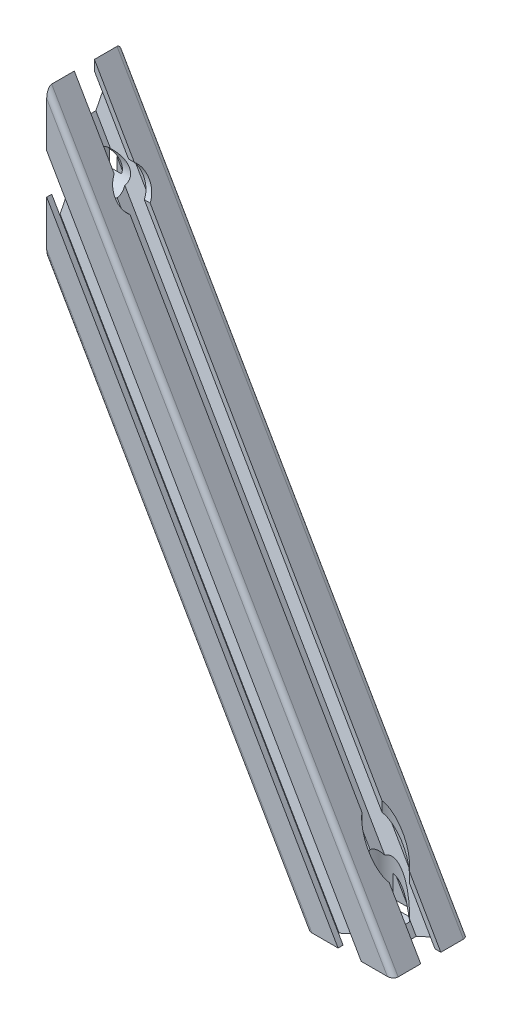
ISO-10303-21;
HEADER;
FILE_DESCRIPTION(('STEP AP214'),'2;1');
FILE_NAME('part.step','',(''),(''),'','','');
FILE_SCHEMA(('AUTOMOTIVE_DESIGN { 1 0 10303 214 1 1 1 1 }'));
ENDSEC;
DATA;
#1=APPLICATION_CONTEXT('core data for automotive mechanical design processes');
#2=APPLICATION_PROTOCOL_DEFINITION('international standard','automotive_design',2000,#1);
#3=PRODUCT_CONTEXT('',#1,'mechanical');
#4=PRODUCT('Part','Part','',(#3));
#5=PRODUCT_RELATED_PRODUCT_CATEGORY('part','',(#4));
#6=PRODUCT_DEFINITION_FORMATION('','',#4);
#7=PRODUCT_DEFINITION_CONTEXT('part definition',#1,'design');
#8=PRODUCT_DEFINITION('design','',#6,#7);
#9=PRODUCT_DEFINITION_SHAPE('','',#8);
#10=(LENGTH_UNIT() NAMED_UNIT(*) SI_UNIT(.MILLI.,.METRE.));
#11=(NAMED_UNIT(*) PLANE_ANGLE_UNIT() SI_UNIT($,.RADIAN.));
#12=(NAMED_UNIT(*) SI_UNIT($,.STERADIAN.) SOLID_ANGLE_UNIT());
#13=UNCERTAINTY_MEASURE_WITH_UNIT(LENGTH_MEASURE(1.E-05),#10,'distance_accuracy_value','');
#14=(GEOMETRIC_REPRESENTATION_CONTEXT(3) GLOBAL_UNCERTAINTY_ASSIGNED_CONTEXT((#13)) GLOBAL_UNIT_ASSIGNED_CONTEXT((#10,
#11,#12)) REPRESENTATION_CONTEXT('',''));
#15=CARTESIAN_POINT('',(0.,0.,0.));
#16=DIRECTION('',(0.,0.,1.));
#17=DIRECTION('',(1.,0.,0.));
#18=AXIS2_PLACEMENT_3D('',#15,#16,#17);
#19=CARTESIAN_POINT('',(151.418974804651,-41.2423461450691,-4.58578643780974));
#20=DIRECTION('',(-0.866025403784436,-0.500000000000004,0.));
#21=DIRECTION('',(0.500000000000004,-0.866025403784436,0.));
#22=AXIS2_PLACEMENT_3D('',#19,#20,#21);
#23=PLANE('',#22);
#24=DIRECTION('',(-0.500000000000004,0.866025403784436,0.));
#25=VECTOR('',#24,1.);
#26=CARTESIAN_POINT('',(151.418974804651,-41.2423461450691,-0.519615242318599));
#27=LINE('',#26,#25);
#28=CARTESIAN_POINT('',(4.77470388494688,212.752981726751,-0.519615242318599));
#29=VERTEX_POINT('',#28);
#30=CARTESIAN_POINT('',(0.,221.023011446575,-0.519615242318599));
#31=VERTEX_POINT('',#30);
#32=EDGE_CURVE('E831',#29,#31,#27,.T.);
#33=ORIENTED_EDGE('',*,*,#32,.F.);
#34=CARTESIAN_POINT('',(8.66025403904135,206.023011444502,0.));
#35=DIRECTION('',(-0.866025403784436,-0.500000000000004,0.));
#36=DIRECTION('',(0.500000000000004,-0.866025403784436,0.));
#37=AXIS2_PLACEMENT_3D('',#34,#35,#36);
#38=ELLIPSE('',#37,7.79422863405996,6.74999999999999);
#39=CARTESIAN_POINT('',(5.80058839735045,210.97609762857,-4.58578643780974));
#40=VERTEX_POINT('',#39);
#41=EDGE_CURVE('E1011',#29,#40,#38,.T.);
#42=ORIENTED_EDGE('',*,*,#41,.T.);
#43=DIRECTION('',(-0.500000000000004,0.866025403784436,0.));
#44=VECTOR('',#43,1.);
#45=CARTESIAN_POINT('',(151.418974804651,-41.2423461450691,-4.58578643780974));
#46=LINE('',#45,#44);
#47=CARTESIAN_POINT('',(0.,221.023011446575,-4.58578643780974));
#48=VERTEX_POINT('',#47);
#49=EDGE_CURVE('E836',#40,#48,#46,.T.);
#50=ORIENTED_EDGE('',*,*,#49,.T.);
#51=DIRECTION('',(0.,0.,-1.));
#52=VECTOR('',#51,1.);
#53=CARTESIAN_POINT('',(0.,221.023011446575,-4.58578643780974));
#54=LINE('',#53,#52);
#55=EDGE_CURVE('E1252',#31,#48,#54,.T.);
#56=ORIENTED_EDGE('',*,*,#55,.F.);
#57=EDGE_LOOP('',(#33,#42,#50,#56));
#58=FACE_BOUND('',#57,.T.);
#59=ADVANCED_FACE('F40',(#58),#23,.F.);
#60=CARTESIAN_POINT('',(150.194229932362,-41.9494529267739,6.00000000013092));
#61=DIRECTION('',(0.,0.,-1.));
#62=DIRECTION('',(-1.,0.,0.));
#63=AXIS2_PLACEMENT_3D('',#60,#61,#62);
#64=PLANE('',#63);
#65=DIRECTION('',(-0.500000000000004,0.866025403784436,0.));
#66=VECTOR('',#65,1.);
#67=CARTESIAN_POINT('',(146.672822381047,-43.982538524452,6.00000000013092));
#68=LINE('',#67,#66);
#69=CARTESIAN_POINT('',(4.,203.134038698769,6.00000000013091));
#70=VERTEX_POINT('',#69);
#71=CARTESIAN_POINT('',(0.,210.062241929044,6.00000000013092));
#72=VERTEX_POINT('',#71);
#73=EDGE_CURVE('E773',#70,#72,#68,.T.);
#74=ORIENTED_EDGE('',*,*,#73,.F.);
#75=DIRECTION('',(0.,1.,0.));
#76=VECTOR('',#75,1.);
#77=CARTESIAN_POINT('',(4.,-41.9494529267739,6.00000000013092));
#78=LINE('',#77,#76);
#79=CARTESIAN_POINT('',(4.,209.115340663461,6.0000000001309));
#80=VERTEX_POINT('',#79);
#81=EDGE_CURVE('E1193',#70,#80,#78,.T.);
#82=ORIENTED_EDGE('',*,*,#81,.T.);
#83=DIRECTION('',(1.,0.,0.));
#84=VECTOR('',#83,1.);
#85=CARTESIAN_POINT('',(100.,209.115340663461,6.00000000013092));
#86=LINE('',#85,#84);
#87=CARTESIAN_POINT('',(5.24190376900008,209.115340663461,6.00000000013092));
#88=VERTEX_POINT('',#87);
#89=EDGE_CURVE('E1028',#80,#88,#86,.T.);
#90=ORIENTED_EDGE('',*,*,#89,.T.);
#91=DIRECTION('',(-0.500000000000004,0.866025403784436,0.));
#92=VECTOR('',#91,1.);
#93=CARTESIAN_POINT('',(150.194229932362,-41.9494529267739,6.00000000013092));
#94=LINE('',#93,#92);
#95=CARTESIAN_POINT('',(0.,218.194584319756,6.00000000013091));
#96=VERTEX_POINT('',#95);
#97=EDGE_CURVE('E777',#88,#96,#94,.T.);
#98=ORIENTED_EDGE('',*,*,#97,.T.);
#99=DIRECTION('',(0.,1.,0.));
#100=VECTOR('',#99,1.);
#101=CARTESIAN_POINT('',(0.,-41.9494529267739,6.00000000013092));
#102=LINE('',#101,#100);
#103=EDGE_CURVE('E1284',#72,#96,#102,.T.);
#104=ORIENTED_EDGE('',*,*,#103,.F.);
#105=EDGE_LOOP('',(#74,#82,#90,#98,#104));
#106=FACE_BOUND('',#105,.T.);
#107=ADVANCED_FACE('F1062',(#106),#64,.F.);
#108=CARTESIAN_POINT('',(159.213203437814,-36.7423461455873,-4.00000000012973));
#109=DIRECTION('',(0.,0.,-1.));
#110=DIRECTION('',(-1.,0.,0.));
#111=AXIS2_PLACEMENT_3D('',#108,#109,#110);
#112=PLANE('',#111);
#113=DIRECTION('',(-0.500000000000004,0.866025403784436,0.));
#114=VECTOR('',#113,1.);
#115=CARTESIAN_POINT('',(157.481152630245,-37.7423461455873,-4.00000000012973));
#116=LINE('',#115,#114);
#117=CARTESIAN_POINT('',(13.6040231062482,211.46015223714,-4.00000000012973));
#118=VERTEX_POINT('',#117);
#119=CARTESIAN_POINT('',(0.,235.023011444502,-4.00000000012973));
#120=VERTEX_POINT('',#119);
#121=EDGE_CURVE('E848',#118,#120,#116,.T.);
#122=ORIENTED_EDGE('',*,*,#121,.F.);
#123=DIRECTION('',(1.,0.,0.));
#124=VECTOR('',#123,1.);
#125=CARTESIAN_POINT('',(100.,211.46015223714,-4.00000000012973));
#126=LINE('',#125,#124);
#127=CARTESIAN_POINT('',(15.9134241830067,211.46015223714,-4.00000000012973));
#128=VERTEX_POINT('',#127);
#129=EDGE_CURVE('E55',#118,#128,#126,.T.);
#130=ORIENTED_EDGE('',*,*,#129,.T.);
#131=DIRECTION('',(-0.500000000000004,0.866025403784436,0.));
#132=VECTOR('',#131,1.);
#133=CARTESIAN_POINT('',(159.213203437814,-36.7423461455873,-4.00000000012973));
#134=LINE('',#133,#132);
#135=CARTESIAN_POINT('',(0.,239.023011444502,-4.00000000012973));
#136=VERTEX_POINT('',#135);
#137=EDGE_CURVE('E852',#128,#136,#134,.T.);
#138=ORIENTED_EDGE('',*,*,#137,.T.);
#139=DIRECTION('',(0.,1.,0.));
#140=VECTOR('',#139,1.);
#141=CARTESIAN_POINT('',(0.,-36.7423461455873,-4.00000000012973));
#142=LINE('',#141,#140);
#143=EDGE_CURVE('E1242',#120,#136,#142,.T.);
#144=ORIENTED_EDGE('',*,*,#143,.F.);
#145=EDGE_LOOP('',(#122,#130,#138,#144));
#146=FACE_BOUND('',#145,.T.);
#147=ADVANCED_FACE('F1070',(#146),#112,.F.);
#148=CARTESIAN_POINT('',(146.672822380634,-43.9825385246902,-5.99999999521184));
#149=DIRECTION('',(0.,0.,1.));
#150=DIRECTION('',(1.,0.,0.));
#151=AXIS2_PLACEMENT_3D('',#148,#149,#150);
#152=PLANE('',#151);
#153=DIRECTION('',(-0.500000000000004,0.866025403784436,0.));
#154=VECTOR('',#153,1.);
#155=CARTESIAN_POINT('',(146.672822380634,-43.9825385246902,-5.99999999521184));
#156=LINE('',#155,#154);
#157=CARTESIAN_POINT('',(116.907670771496,7.57221635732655,-5.99999999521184));
#158=VERTEX_POINT('',#157);
#159=CARTESIAN_POINT('',(4.11740791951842,202.930682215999,-5.99999999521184));
#160=VERTEX_POINT('',#159);
#161=EDGE_CURVE('E886',#158,#160,#156,.T.);
#162=ORIENTED_EDGE('',*,*,#161,.T.);
#163=DIRECTION('',(1.,0.,0.));
#164=VECTOR('',#163,1.);
#165=CARTESIAN_POINT('',(100.,202.930682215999,-5.99999999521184));
#166=LINE('',#165,#164);
#167=CARTESIAN_POINT('',(8.81261798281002,202.930682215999,-5.99999999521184));
#168=VERTEX_POINT('',#167);
#169=EDGE_CURVE('E1208',#160,#168,#166,.T.);
#170=ORIENTED_EDGE('',*,*,#169,.T.);
#171=DIRECTION('',(-0.500000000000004,0.866025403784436,0.));
#172=VECTOR('',#171,1.);
#173=CARTESIAN_POINT('',(150.194229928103,-41.9494529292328,-5.99999999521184));
#174=LINE('',#173,#172);
#175=CARTESIAN_POINT('',(116.907670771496,15.7045587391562,-5.99999999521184));
#176=VERTEX_POINT('',#175);
#177=EDGE_CURVE('E881',#176,#168,#174,.T.);
#178=ORIENTED_EDGE('',*,*,#177,.F.);
#179=DIRECTION('',(0.,1.,0.));
#180=VECTOR('',#179,1.);
#181=CARTESIAN_POINT('',(116.907670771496,100.,-5.99999999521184));
#182=LINE('',#181,#180);
#183=EDGE_CURVE('E1155',#176,#158,#182,.F.);
#184=ORIENTED_EDGE('',*,*,#183,.T.);
#185=EDGE_LOOP('',(#162,#170,#178,#184));
#186=FACE_BOUND('',#185,.T.);
#187=ADVANCED_FACE('F1812',(#186),#152,.F.);
#188=CARTESIAN_POINT('',(151.418974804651,-41.2423461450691,-0.519615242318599));
#189=DIRECTION('',(-0.749999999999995,-0.433012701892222,-0.500000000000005));
#190=DIRECTION('',(-0.554700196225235,0.,0.83205029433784));
#191=AXIS2_PLACEMENT_3D('',#188,#189,#190);
#192=PLANE('',#191);
#193=CARTESIAN_POINT('',(113.270029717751,24.8335650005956,-0.519615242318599));
#194=VERTEX_POINT('',#193);
#195=CARTESIAN_POINT('',(12.5458041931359,199.293041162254,-0.519615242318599));
#196=VERTEX_POINT('',#195);
#197=EDGE_CURVE('E837',#194,#196,#27,.T.);
#198=ORIENTED_EDGE('',*,*,#197,.T.);
#199=CARTESIAN_POINT('',(8.31384387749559,206.023011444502,0.));
#200=DIRECTION('',(-0.749999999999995,-0.433012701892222,-0.500000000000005));
#201=DIRECTION('',(0.661437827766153,-0.490990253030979,-0.566946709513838));
#202=AXIS2_PLACEMENT_3D('',#199,#200,#201);
#203=ELLIPSE('',#202,9.00000000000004,6.74999999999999);
#204=CARTESIAN_POINT('',(12.2109581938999,199.273011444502,9.38460897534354E-10));
#205=VERTEX_POINT('',#204);
#206=EDGE_CURVE('E1012',#196,#205,#203,.T.);
#207=ORIENTED_EDGE('',*,*,#206,.T.);
#208=DIRECTION('',(-0.500000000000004,0.866025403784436,0.));
#209=VECTOR('',#208,1.);
#210=CARTESIAN_POINT('',(151.159167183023,-41.3923461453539,9.38460897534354E-10));
#211=LINE('',#210,#209);
#212=CARTESIAN_POINT('',(113.25,24.2682574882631,9.38460897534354E-10));
#213=VERTEX_POINT('',#212);
#214=EDGE_CURVE('E832',#213,#205,#211,.T.);
#215=ORIENTED_EDGE('',*,*,#214,.F.);
#216=CARTESIAN_POINT('',(120.,12.5769145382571,0.));
#217=DIRECTION('',(-0.749999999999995,-0.433012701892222,-0.500000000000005));
#218=DIRECTION('',(-0.360288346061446,0.901387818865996,-0.240192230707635));
#219=AXIS2_PLACEMENT_3D('',#216,#217,#218);
#220=ELLIPSE('',#219,15.5884572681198,6.74999999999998);
#221=EDGE_CURVE('E1115',#213,#194,#220,.T.);
#222=ORIENTED_EDGE('',*,*,#221,.T.);
#223=EDGE_LOOP('',(#198,#207,#215,#222));
#224=FACE_BOUND('',#223,.T.);
#225=ADVANCED_FACE('F1092',(#224),#192,.F.);
#226=CARTESIAN_POINT('',(151.159167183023,-41.3923461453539,9.38460897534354E-10));
#227=DIRECTION('',(-0.749999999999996,-0.433012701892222,0.500000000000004));
#228=DIRECTION('',(0.554700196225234,0.,0.83205029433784));
#229=AXIS2_PLACEMENT_3D('',#226,#227,#228);
#230=PLANE('',#229);
#231=DIRECTION('',(-0.500000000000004,0.866025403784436,0.));
#232=VECTOR('',#231,1.);
#233=CARTESIAN_POINT('',(151.418974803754,-41.2423461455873,0.519615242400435));
#234=LINE('',#233,#232);
#235=CARTESIAN_POINT('',(4.7747038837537,212.752981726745,0.519615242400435));
#236=VERTEX_POINT('',#235);
#237=CARTESIAN_POINT('',(0.,221.023011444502,0.519615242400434));
#238=VERTEX_POINT('',#237);
#239=EDGE_CURVE('E821',#236,#238,#234,.T.);
#240=ORIENTED_EDGE('',*,*,#239,.F.);
#241=CARTESIAN_POINT('',(8.31384387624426,206.023011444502,0.));
#242=DIRECTION('',(-0.749999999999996,-0.433012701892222,0.500000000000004));
#243=DIRECTION('',(0.661437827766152,-0.490990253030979,0.566946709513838));
#244=AXIS2_PLACEMENT_3D('',#241,#242,#243);
#245=ELLIPSE('',#244,9.00000000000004,6.74999999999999);
#246=CARTESIAN_POINT('',(4.41672955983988,212.773011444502,9.38460897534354E-10));
#247=VERTEX_POINT('',#246);
#248=EDGE_CURVE('E1004',#236,#247,#245,.T.);
#249=ORIENTED_EDGE('',*,*,#248,.T.);
#250=CARTESIAN_POINT('',(0.,220.423011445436,9.38471522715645E-10));
#251=VERTEX_POINT('',#250);
#252=EDGE_CURVE('E826',#247,#251,#211,.T.);
#253=ORIENTED_EDGE('',*,*,#252,.T.);
#254=DIRECTION('',(0.,-0.755928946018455,-0.654653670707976));
#255=VECTOR('',#254,1.);
#256=CARTESIAN_POINT('',(0.,70.8142356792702,-129.565000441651));
#257=LINE('',#256,#255);
#258=EDGE_CURVE('E1258',#238,#251,#257,.T.);
#259=ORIENTED_EDGE('',*,*,#258,.F.);
#260=EDGE_LOOP('',(#240,#249,#253,#259));
#261=FACE_BOUND('',#260,.T.);
#262=ADVANCED_FACE('F1685',(#261),#230,.F.);
#263=CARTESIAN_POINT('',(157.481152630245,-37.7423461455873,4.00000000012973));
#264=DIRECTION('',(0.,0.,1.));
#265=DIRECTION('',(1.,0.,0.));
#266=AXIS2_PLACEMENT_3D('',#263,#264,#265);
#267=PLANE('',#266);
#268=DIRECTION('',(-0.500000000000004,0.866025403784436,0.));
#269=VECTOR('',#268,1.);
#270=CARTESIAN_POINT('',(157.481152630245,-37.7423461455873,4.00000000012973));
#271=LINE('',#270,#269);
#272=CARTESIAN_POINT('',(114.562859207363,36.5943186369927,4.00000000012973));
#273=VERTEX_POINT('',#272);
#274=CARTESIAN_POINT('',(19.8822925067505,200.585870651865,4.00000000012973));
#275=VERTEX_POINT('',#274);
#276=EDGE_CURVE('E811',#273,#275,#271,.T.);
#277=ORIENTED_EDGE('',*,*,#276,.T.);
#278=DIRECTION('',(1.,0.,0.));
#279=VECTOR('',#278,1.);
#280=CARTESIAN_POINT('',(100.,200.585870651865,4.00000000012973));
#281=LINE('',#280,#279);
#282=CARTESIAN_POINT('',(22.191693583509,200.585870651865,4.00000000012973));
#283=VERTEX_POINT('',#282);
#284=EDGE_CURVE('E1040',#275,#283,#281,.T.);
#285=ORIENTED_EDGE('',*,*,#284,.T.);
#286=DIRECTION('',(-0.500000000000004,0.866025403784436,0.));
#287=VECTOR('',#286,1.);
#288=CARTESIAN_POINT('',(159.213203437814,-36.7423461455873,4.00000000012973));
#289=LINE('',#288,#287);
#290=CARTESIAN_POINT('',(114.562859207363,40.5943186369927,4.00000000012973));
#291=VERTEX_POINT('',#290);
#292=EDGE_CURVE('E806',#291,#283,#289,.T.);
#293=ORIENTED_EDGE('',*,*,#292,.F.);
#294=DIRECTION('',(0.,1.,0.));
#295=VECTOR('',#294,1.);
#296=CARTESIAN_POINT('',(114.562859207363,100.,4.00000000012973));
#297=LINE('',#296,#295);
#298=EDGE_CURVE('E1143',#291,#273,#297,.F.);
#299=ORIENTED_EDGE('',*,*,#298,.T.);
#300=EDGE_LOOP('',(#277,#285,#293,#299));
#301=FACE_BOUND('',#300,.T.);
#302=ADVANCED_FACE('F1664',(#301),#267,.F.);
#303=CARTESIAN_POINT('',(151.418974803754,-41.2423461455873,0.519615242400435));
#304=DIRECTION('',(-0.866025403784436,-0.500000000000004,0.));
#305=DIRECTION('',(0.500000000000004,-0.866025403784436,0.));
#306=AXIS2_PLACEMENT_3D('',#303,#304,#305);
#307=PLANE('',#306);
#308=CARTESIAN_POINT('',(113.270029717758,24.8335649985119,0.519615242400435));
#309=VERTEX_POINT('',#308);
#310=CARTESIAN_POINT('',(12.5458041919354,199.29304116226,0.519615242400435));
#311=VERTEX_POINT('',#310);
#312=EDGE_CURVE('E827',#309,#311,#234,.T.);
#313=ORIENTED_EDGE('',*,*,#312,.T.);
#314=CARTESIAN_POINT('',(8.66025403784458,206.023011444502,0.));
#315=DIRECTION('',(-0.866025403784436,-0.500000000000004,0.));
#316=DIRECTION('',(0.500000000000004,-0.866025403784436,0.));
#317=AXIS2_PLACEMENT_3D('',#314,#315,#316);
#318=ELLIPSE('',#317,7.79422863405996,6.74999999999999);
#319=CARTESIAN_POINT('',(11.5199196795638,201.069925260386,4.58578643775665));
#320=VERTEX_POINT('',#319);
#321=EDGE_CURVE('E1744',#311,#320,#318,.T.);
#322=ORIENTED_EDGE('',*,*,#321,.T.);
#323=DIRECTION('',(-0.500000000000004,0.866025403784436,0.));
#324=VECTOR('',#323,1.);
#325=CARTESIAN_POINT('',(151.418974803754,-41.2423461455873,4.58578643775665));
#326=LINE('',#325,#324);
#327=CARTESIAN_POINT('',(115.046913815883,21.7559114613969,4.58578643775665));
#328=VERTEX_POINT('',#327);
#329=EDGE_CURVE('E822',#328,#320,#326,.T.);
#330=ORIENTED_EDGE('',*,*,#329,.F.);
#331=CARTESIAN_POINT('',(120.,13.1769145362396,0.));
#332=DIRECTION('',(-0.866025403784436,-0.500000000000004,0.));
#333=DIRECTION('',(-0.500000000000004,0.866025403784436,0.));
#334=AXIS2_PLACEMENT_3D('',#331,#332,#333);
#335=ELLIPSE('',#334,13.4999999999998,6.74999999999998);
#336=EDGE_CURVE('E1128',#328,#309,#335,.T.);
#337=ORIENTED_EDGE('',*,*,#336,.T.);
#338=EDGE_LOOP('',(#313,#322,#330,#337));
#339=FACE_BOUND('',#338,.T.);
#340=ADVANCED_FACE('F1681',(#339),#307,.F.);
#341=CARTESIAN_POINT('',(0.,0.,-15.0000000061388));
#342=DIRECTION('',(-1.,0.,0.));
#343=DIRECTION('',(0.,0.,1.));
#344=AXIS2_PLACEMENT_3D('',#341,#342,#343);
#345=PLANE('',#344);
#346=CARTESIAN_POINT('',(0.,232.223011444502,-11.5999999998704));
#347=DIRECTION('',(-1.,0.,0.));
#348=DIRECTION('',(0.,1.,0.));
#349=AXIS2_PLACEMENT_3D('',#346,#347,#348);
#350=ELLIPSE('',#349,4.19999999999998,2.10000000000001);
#351=CARTESIAN_POINT('',(0.,236.423011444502,-11.5999999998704));
#352=VERTEX_POINT('',#351);
#353=EDGE_CURVE('E698',#352,#352,#350,.T.);
#354=ORIENTED_EDGE('',*,*,#353,.F.);
#355=EDGE_LOOP('',(#354));
#356=FACE_BOUND('',#355,.T.);
#357=CARTESIAN_POINT('',(0.,185.823011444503,11.6000000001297));
#358=DIRECTION('',(-1.,0.,0.));
#359=DIRECTION('',(0.,1.,0.));
#360=AXIS2_PLACEMENT_3D('',#357,#358,#359);
#361=ELLIPSE('',#360,4.19999999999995,2.09999999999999);
#362=CARTESIAN_POINT('',(0.,190.023011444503,11.6000000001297));
#363=VERTEX_POINT('',#362);
#364=EDGE_CURVE('E695',#363,#363,#361,.T.);
#365=ORIENTED_EDGE('',*,*,#364,.F.);
#366=EDGE_LOOP('',(#365));
#367=FACE_BOUND('',#366,.T.);
#368=CARTESIAN_POINT('',(0.,232.223011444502,11.6000000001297));
#369=DIRECTION('',(-1.,0.,0.));
#370=DIRECTION('',(0.,1.,0.));
#371=AXIS2_PLACEMENT_3D('',#368,#369,#370);
#372=ELLIPSE('',#371,4.19999999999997,2.1);
#373=CARTESIAN_POINT('',(0.,236.423011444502,11.6000000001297));
#374=VERTEX_POINT('',#373);
#375=EDGE_CURVE('E688',#374,#374,#372,.T.);
#376=ORIENTED_EDGE('',*,*,#375,.F.);
#377=EDGE_LOOP('',(#376));
#378=FACE_BOUND('',#377,.T.);
#379=CARTESIAN_POINT('',(0.,185.823011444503,-11.5999999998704));
#380=DIRECTION('',(-1.,0.,0.));
#381=DIRECTION('',(0.,1.,0.));
#382=AXIS2_PLACEMENT_3D('',#379,#380,#381);
#383=ELLIPSE('',#382,4.19999999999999,2.10000000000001);
#384=CARTESIAN_POINT('',(0.,190.023011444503,-11.5999999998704));
#385=VERTEX_POINT('',#384);
#386=EDGE_CURVE('E922',#385,#385,#383,.T.);
#387=ORIENTED_EDGE('',*,*,#386,.F.);
#388=EDGE_LOOP('',(#387));
#389=FACE_BOUND('',#388,.T.);
#390=DIRECTION('',(0.,0.,-1.));
#391=VECTOR('',#390,1.);
#392=CARTESIAN_POINT('',(0.,201.023011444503,13.0000000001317));
#393=LINE('',#392,#391);
#394=CARTESIAN_POINT('',(0.,201.023011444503,15.0000000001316));
#395=VERTEX_POINT('',#394);
#396=CARTESIAN_POINT('',(0.,201.023011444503,13.0000000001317));
#397=VERTEX_POINT('',#396);
#398=EDGE_CURVE('E686',#395,#397,#393,.T.);
#399=ORIENTED_EDGE('',*,*,#398,.T.);
#400=DIRECTION('',(0.,-1.,0.));
#401=VECTOR('',#400,1.);
#402=CARTESIAN_POINT('',(0.,-48.3673461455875,13.0000000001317));
#403=LINE('',#402,#401);
#404=CARTESIAN_POINT('',(0.,192.523011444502,13.0000000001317));
#405=VERTEX_POINT('',#404);
#406=EDGE_CURVE('E689',#397,#405,#403,.T.);
#407=ORIENTED_EDGE('',*,*,#406,.T.);
#408=DIRECTION('',(0.,0.,-1.));
#409=VECTOR('',#408,1.);
#410=CARTESIAN_POINT('',(0.,192.523011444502,9.66421356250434));
#411=LINE('',#410,#409);
#412=CARTESIAN_POINT('',(0.,192.523011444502,9.66421356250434));
#413=VERTEX_POINT('',#412);
#414=EDGE_CURVE('E1298',#405,#413,#411,.T.);
#415=ORIENTED_EDGE('',*,*,#414,.T.);
#416=DIRECTION('',(0.,0.894427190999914,-0.447213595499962));
#417=VECTOR('',#416,1.);
#418=CARTESIAN_POINT('',(0.,2.74209622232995,104.554671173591));
#419=LINE('',#418,#417);
#420=CARTESIAN_POINT('',(0.,199.851438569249,6.0000000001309));
#421=VERTEX_POINT('',#420);
#422=EDGE_CURVE('E1296',#413,#421,#419,.T.);
#423=ORIENTED_EDGE('',*,*,#422,.T.);
#424=DIRECTION('',(0.,1.,0.));
#425=VECTOR('',#424,1.);
#426=CARTESIAN_POINT('',(0.,-44.5021537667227,6.0000000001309));
#427=LINE('',#426,#425);
#428=CARTESIAN_POINT('',(0.,207.983780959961,6.0000000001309));
#429=VERTEX_POINT('',#428);
#430=EDGE_CURVE('E1293',#421,#429,#427,.T.);
#431=ORIENTED_EDGE('',*,*,#430,.T.);
#432=DIRECTION('',(0.,0.960768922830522,-0.277350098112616));
#433=VECTOR('',#432,1.);
#434=CARTESIAN_POINT('',(0.,-24.7603955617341,73.1874564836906));
#435=LINE('',#434,#433);
#436=CARTESIAN_POINT('',(0.,209.023011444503,5.70000000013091));
#437=VERTEX_POINT('',#436);
#438=EDGE_CURVE('E1290',#429,#437,#435,.T.);
#439=ORIENTED_EDGE('',*,*,#438,.T.);
#440=DIRECTION('',(0.,0.960768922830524,0.277350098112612));
#441=VECTOR('',#440,1.);
#442=CARTESIAN_POINT('',(0.,-24.440632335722,-61.6951487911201));
#443=LINE('',#442,#441);
#444=EDGE_CURVE('E1287',#437,#72,#443,.T.);
#445=ORIENTED_EDGE('',*,*,#444,.T.);
#446=ORIENTED_EDGE('',*,*,#103,.T.);
#447=DIRECTION('',(0.,0.894427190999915,0.44721359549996));
#448=VECTOR('',#447,1.);
#449=CARTESIAN_POINT('',(0.,13.0107253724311,-96.5919294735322));
#450=LINE('',#449,#448);
#451=CARTESIAN_POINT('',(0.,225.523011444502,9.66421356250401));
#452=VERTEX_POINT('',#451);
#453=EDGE_CURVE('E1282',#96,#452,#450,.T.);
#454=ORIENTED_EDGE('',*,*,#453,.T.);
#455=DIRECTION('',(0.,0.,1.));
#456=VECTOR('',#455,1.);
#457=CARTESIAN_POINT('',(0.,225.523011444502,13.0000000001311));
#458=LINE('',#457,#456);
#459=CARTESIAN_POINT('',(0.,225.523011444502,13.0000000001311));
#460=VERTEX_POINT('',#459);
#461=EDGE_CURVE('E1280',#452,#460,#458,.T.);
#462=ORIENTED_EDGE('',*,*,#461,.T.);
#463=DIRECTION('',(0.,-1.,0.));
#464=VECTOR('',#463,1.);
#465=CARTESIAN_POINT('',(0.,-42.2423461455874,13.0000000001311));
#466=LINE('',#465,#464);
#467=CARTESIAN_POINT('',(0.,217.023011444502,13.0000000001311));
#468=VERTEX_POINT('',#467);
#469=EDGE_CURVE('E1278',#460,#468,#466,.T.);
#470=ORIENTED_EDGE('',*,*,#469,.T.);
#471=DIRECTION('',(0.,0.,1.));
#472=VECTOR('',#471,1.);
#473=CARTESIAN_POINT('',(0.,217.023011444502,15.0000000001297));
#474=LINE('',#473,#472);
#475=CARTESIAN_POINT('',(0.,217.023011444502,15.0000000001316));
#476=VERTEX_POINT('',#475);
#477=EDGE_CURVE('E1276',#468,#476,#474,.T.);
#478=ORIENTED_EDGE('',*,*,#477,.T.);
#479=DIRECTION('',(0.,-1.,0.));
#480=VECTOR('',#479,1.);
#481=CARTESIAN_POINT('',(0.,0.,15.0000000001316));
#482=LINE('',#481,#480);
#483=CARTESIAN_POINT('',(0.,235.023011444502,15.0000000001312));
#484=VERTEX_POINT('',#483);
#485=EDGE_CURVE('E1617',#484,#476,#482,.T.);
#486=ORIENTED_EDGE('',*,*,#485,.F.);
#487=CARTESIAN_POINT('',(0.,235.023011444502,13.0000000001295));
#488=DIRECTION('',(-1.,0.,0.));
#489=DIRECTION('',(0.,1.,0.));
#490=AXIS2_PLACEMENT_3D('',#487,#488,#489);
#491=ELLIPSE('',#490,4.00000000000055,2.00000000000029);
#492=CARTESIAN_POINT('',(0.,239.023011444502,13.0000000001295));
#493=VERTEX_POINT('',#492);
#494=EDGE_CURVE('E1274',#484,#493,#491,.T.);
#495=ORIENTED_EDGE('',*,*,#494,.T.);
#496=DIRECTION('',(0.,0.,1.));
#497=VECTOR('',#496,1.);
#498=CARTESIAN_POINT('',(0.,239.023011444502,4.00000000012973));
#499=LINE('',#498,#497);
#500=CARTESIAN_POINT('',(0.,239.023011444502,4.00000000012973));
#501=VERTEX_POINT('',#500);
#502=EDGE_CURVE('E708',#501,#493,#499,.T.);
#503=ORIENTED_EDGE('',*,*,#502,.F.);
#504=DIRECTION('',(0.,-1.,0.));
#505=VECTOR('',#504,1.);
#506=CARTESIAN_POINT('',(0.,-37.7423461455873,4.00000000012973));
#507=LINE('',#506,#505);
#508=CARTESIAN_POINT('',(0.,235.023011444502,4.00000000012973));
#509=VERTEX_POINT('',#508);
#510=EDGE_CURVE('E1271',#501,#509,#507,.T.);
#511=ORIENTED_EDGE('',*,*,#510,.T.);
#512=DIRECTION('',(0.,0.,1.));
#513=VECTOR('',#512,1.);
#514=CARTESIAN_POINT('',(0.,235.023011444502,8.25000000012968));
#515=LINE('',#514,#513);
#516=CARTESIAN_POINT('',(0.,235.023011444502,8.25000000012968));
#517=VERTEX_POINT('',#516);
#518=EDGE_CURVE('E1269',#509,#517,#515,.T.);
#519=ORIENTED_EDGE('',*,*,#518,.T.);
#520=DIRECTION('',(0.,-1.,0.));
#521=VECTOR('',#520,1.);
#522=CARTESIAN_POINT('',(0.,-39.4102393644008,8.25000000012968));
#523=LINE('',#522,#521);
#524=CARTESIAN_POINT('',(0.,228.351438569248,8.2500000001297));
#525=VERTEX_POINT('',#524);
#526=EDGE_CURVE('E1267',#517,#525,#523,.T.);
#527=ORIENTED_EDGE('',*,*,#526,.T.);
#528=DIRECTION('',(0.,-0.894427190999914,-0.447213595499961));
#529=VECTOR('',#528,1.);
#530=CARTESIAN_POINT('',(0.,11.2107253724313,-100.32035659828));
#531=LINE('',#530,#529);
#532=CARTESIAN_POINT('',(0.,221.023011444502,4.58578643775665));
#533=VERTEX_POINT('',#532);
#534=EDGE_CURVE('E1264',#525,#533,#531,.T.);
#535=ORIENTED_EDGE('',*,*,#534,.T.);
#536=DIRECTION('',(0.,0.,-1.));
#537=VECTOR('',#536,1.);
#538=CARTESIAN_POINT('',(0.,221.023011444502,0.519615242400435));
#539=LINE('',#538,#537);
#540=EDGE_CURVE('E1261',#533,#238,#539,.T.);
#541=ORIENTED_EDGE('',*,*,#540,.T.);
#542=ORIENTED_EDGE('',*,*,#258,.T.);
#543=DIRECTION('',(0.,0.755928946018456,-0.654653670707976));
#544=VECTOR('',#543,1.);
#545=CARTESIAN_POINT('',(0.,71.1570928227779,129.268077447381));
#546=LINE('',#545,#544);
#547=EDGE_CURVE('E1255',#251,#31,#546,.T.);
#548=ORIENTED_EDGE('',*,*,#547,.T.);
#549=ORIENTED_EDGE('',*,*,#55,.T.);
#550=DIRECTION('',(0.,0.894427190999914,-0.447213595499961));
#551=VECTOR('',#550,1.);
#552=CARTESIAN_POINT('',(0.,14.1420962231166,98.8546711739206));
#553=LINE('',#552,#551);
#554=CARTESIAN_POINT('',(0.,228.351438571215,-8.25000000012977));
#555=VERTEX_POINT('',#554);
#556=EDGE_CURVE('E1250',#48,#555,#553,.T.);
#557=ORIENTED_EDGE('',*,*,#556,.T.);
#558=DIRECTION('',(0.,1.,0.));
#559=VECTOR('',#558,1.);
#560=CARTESIAN_POINT('',(0.,-37.7423461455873,-8.25000000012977));
#561=LINE('',#560,#559);
#562=CARTESIAN_POINT('',(0.,235.023011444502,-8.25000000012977));
#563=VERTEX_POINT('',#562);
#564=EDGE_CURVE('E1248',#555,#563,#561,.T.);
#565=ORIENTED_EDGE('',*,*,#564,.T.);
#566=DIRECTION('',(0.,0.,1.));
#567=VECTOR('',#566,1.);
#568=CARTESIAN_POINT('',(0.,235.023011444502,-4.00000000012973));
#569=LINE('',#568,#567);
#570=EDGE_CURVE('E1245',#563,#120,#569,.T.);
#571=ORIENTED_EDGE('',*,*,#570,.T.);
#572=ORIENTED_EDGE('',*,*,#143,.T.);
#573=DIRECTION('',(0.,0.,1.));
#574=VECTOR('',#573,1.);
#575=CARTESIAN_POINT('',(0.,239.023011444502,-13.0000000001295));
#576=LINE('',#575,#574);
#577=CARTESIAN_POINT('',(0.,239.023011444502,-13.0000000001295));
#578=VERTEX_POINT('',#577);
#579=EDGE_CURVE('E705',#578,#136,#576,.T.);
#580=ORIENTED_EDGE('',*,*,#579,.F.);
#581=CARTESIAN_POINT('',(0.,235.023011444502,-13.0000000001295));
#582=DIRECTION('',(-1.,0.,0.));
#583=DIRECTION('',(0.,1.,0.));
#584=AXIS2_PLACEMENT_3D('',#581,#582,#583);
#585=ELLIPSE('',#584,4.00000000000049,2.00000000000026);
#586=CARTESIAN_POINT('',(0.,235.023011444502,-15.0000000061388));
#587=VERTEX_POINT('',#586);
#588=EDGE_CURVE('E1240',#578,#587,#585,.T.);
#589=ORIENTED_EDGE('',*,*,#588,.T.);
#590=DIRECTION('',(0.,-1.,0.));
#591=VECTOR('',#590,1.);
#592=CARTESIAN_POINT('',(0.,0.,-15.0000000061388));
#593=LINE('',#592,#591);
#594=CARTESIAN_POINT('',(0.,217.023011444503,-15.0000000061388));
#595=VERTEX_POINT('',#594);
#596=EDGE_CURVE('E1418',#587,#595,#593,.T.);
#597=ORIENTED_EDGE('',*,*,#596,.T.);
#598=DIRECTION('',(0.,0.,1.));
#599=VECTOR('',#598,1.);
#600=CARTESIAN_POINT('',(0.,217.023011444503,-13.0000000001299));
#601=LINE('',#600,#599);
#602=CARTESIAN_POINT('',(0.,217.023011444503,-13.0000000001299));
#603=VERTEX_POINT('',#602);
#604=EDGE_CURVE('E1238',#595,#603,#601,.T.);
#605=ORIENTED_EDGE('',*,*,#604,.T.);
#606=DIRECTION('',(0.,1.,0.));
#607=VECTOR('',#606,1.);
#608=CARTESIAN_POINT('',(0.,-40.1173461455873,-13.0000000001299));
#609=LINE('',#608,#607);
#610=CARTESIAN_POINT('',(0.,225.523011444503,-13.0000000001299));
#611=VERTEX_POINT('',#610);
#612=EDGE_CURVE('E1236',#603,#611,#609,.T.);
#613=ORIENTED_EDGE('',*,*,#612,.T.);
#614=DIRECTION('',(0.,0.,1.));
#615=VECTOR('',#614,1.);
#616=CARTESIAN_POINT('',(0.,225.523011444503,-9.66421356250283));
#617=LINE('',#616,#615);
#618=CARTESIAN_POINT('',(0.,225.523011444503,-9.66421356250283));
#619=VERTEX_POINT('',#618);
#620=EDGE_CURVE('E1229',#611,#619,#617,.T.);
#621=ORIENTED_EDGE('',*,*,#620,.T.);
#622=DIRECTION('',(0.,-0.894427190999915,0.44721359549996));
#623=VECTOR('',#622,1.);
#624=CARTESIAN_POINT('',(0.,10.0793545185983,98.0576149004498));
#625=LINE('',#624,#623);
#626=CARTESIAN_POINT('',(0.,218.194584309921,-5.99999999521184));
#627=VERTEX_POINT('',#626);
#628=EDGE_CURVE('E1226',#619,#627,#625,.T.);
#629=ORIENTED_EDGE('',*,*,#628,.T.);
#630=DIRECTION('',(0.,-1.,0.));
#631=VECTOR('',#630,1.);
#632=CARTESIAN_POINT('',(0.,-43.9825385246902,-5.99999999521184));
#633=LINE('',#632,#631);
#634=CARTESIAN_POINT('',(0.,210.062241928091,-5.99999999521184));
#635=VERTEX_POINT('',#634);
#636=EDGE_CURVE('E1221',#627,#635,#633,.T.);
#637=ORIENTED_EDGE('',*,*,#636,.T.);
#638=DIRECTION('',(0.,-0.960768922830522,0.277350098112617));
#639=VECTOR('',#638,1.);
#640=CARTESIAN_POINT('',(0.,-24.7603955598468,61.7874564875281));
#641=LINE('',#640,#639);
#642=CARTESIAN_POINT('',(0.,209.023011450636,-5.69999999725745));
#643=VERTEX_POINT('',#642);
#644=EDGE_CURVE('E1227',#635,#643,#641,.T.);
#645=ORIENTED_EDGE('',*,*,#644,.T.);
#646=DIRECTION('',(0.,-0.960768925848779,-0.277350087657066));
#647=VECTOR('',#646,1.);
#648=CARTESIAN_POINT('',(0.,-25.0801602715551,-73.2797618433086));
#649=LINE('',#648,#647);
#650=CARTESIAN_POINT('',(0.,207.983780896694,-6.00000000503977));
#651=VERTEX_POINT('',#650);
#652=EDGE_CURVE('E1231',#643,#651,#649,.T.);
#653=ORIENTED_EDGE('',*,*,#652,.T.);
#654=DIRECTION('',(0.,-1.,0.));
#655=VECTOR('',#654,1.);
#656=CARTESIAN_POINT('',(0.,-46.5352393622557,-6.00000000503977));
#657=LINE('',#656,#655);
#658=CARTESIAN_POINT('',(0.,199.851438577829,-6.00000000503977));
#659=VERTEX_POINT('',#658);
#660=EDGE_CURVE('E1373',#651,#659,#657,.T.);
#661=ORIENTED_EDGE('',*,*,#660,.T.);
#662=DIRECTION('',(0.,-0.894427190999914,-0.447213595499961));
#663=VECTOR('',#662,1.);
#664=CARTESIAN_POINT('',(0.,-0.189274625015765,-106.020356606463));
#665=LINE('',#664,#663);
#666=CARTESIAN_POINT('',(0.,192.523011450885,-9.66421356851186));
#667=VERTEX_POINT('',#666);
#668=EDGE_CURVE('E1371',#659,#667,#665,.T.);
#669=ORIENTED_EDGE('',*,*,#668,.T.);
#670=DIRECTION('',(0.,0.,-1.));
#671=VECTOR('',#670,1.);
#672=CARTESIAN_POINT('',(0.,192.523011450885,-13.0000000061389));
#673=LINE('',#672,#671);
#674=CARTESIAN_POINT('',(0.,192.523011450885,-13.0000000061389));
#675=VERTEX_POINT('',#674);
#676=EDGE_CURVE('E1369',#667,#675,#673,.T.);
#677=ORIENTED_EDGE('',*,*,#676,.T.);
#678=DIRECTION('',(0.,1.,0.));
#679=VECTOR('',#678,1.);
#680=CARTESIAN_POINT('',(0.,-46.2423461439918,-13.0000000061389));
#681=LINE('',#680,#679);
#682=CARTESIAN_POINT('',(0.,201.023011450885,-13.0000000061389));
#683=VERTEX_POINT('',#682);
#684=EDGE_CURVE('E1367',#675,#683,#681,.T.);
#685=ORIENTED_EDGE('',*,*,#684,.T.);
#686=DIRECTION('',(0.,0.,-1.));
#687=VECTOR('',#686,1.);
#688=CARTESIAN_POINT('',(0.,201.023011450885,-15.0000000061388));
#689=LINE('',#688,#687);
#690=CARTESIAN_POINT('',(0.,201.023011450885,-15.0000000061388));
#691=VERTEX_POINT('',#690);
#692=EDGE_CURVE('E1365',#683,#691,#689,.T.);
#693=ORIENTED_EDGE('',*,*,#692,.T.);
#694=CARTESIAN_POINT('',(0.,183.023011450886,-15.0000000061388));
#695=VERTEX_POINT('',#694);
#696=EDGE_CURVE('E1416',#691,#695,#593,.T.);
#697=ORIENTED_EDGE('',*,*,#696,.T.);
#698=CARTESIAN_POINT('',(0.,183.023011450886,-13.0000000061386));
#699=DIRECTION('',(-1.,0.,0.));
#700=DIRECTION('',(0.,1.,0.));
#701=AXIS2_PLACEMENT_3D('',#698,#699,#700);
#702=ELLIPSE('',#701,4.00000000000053,2.00000000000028);
#703=CARTESIAN_POINT('',(0.,179.023011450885,-13.0000000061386));
#704=VERTEX_POINT('',#703);
#705=EDGE_CURVE('E1339',#695,#704,#702,.T.);
#706=ORIENTED_EDGE('',*,*,#705,.T.);
#707=DIRECTION('',(0.,0.,1.));
#708=VECTOR('',#707,1.);
#709=CARTESIAN_POINT('',(0.,179.023011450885,-3.99999999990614));
#710=LINE('',#709,#708);
#711=CARTESIAN_POINT('',(0.,179.023011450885,-3.99999999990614));
#712=VERTEX_POINT('',#711);
#713=EDGE_CURVE('E1337',#704,#712,#710,.T.);
#714=ORIENTED_EDGE('',*,*,#713,.T.);
#715=DIRECTION('',(0.,1.,0.));
#716=VECTOR('',#715,1.);
#717=CARTESIAN_POINT('',(0.,-50.7423461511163,-3.99999999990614));
#718=LINE('',#717,#716);
#719=CARTESIAN_POINT('',(0.,183.023011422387,-3.99999999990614));
#720=VERTEX_POINT('',#719);
#721=EDGE_CURVE('E1335',#712,#720,#718,.T.);
#722=ORIENTED_EDGE('',*,*,#721,.T.);
#723=DIRECTION('',(0.,0.,-1.));
#724=VECTOR('',#723,1.);
#725=CARTESIAN_POINT('',(0.,183.023011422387,-8.24999999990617));
#726=LINE('',#725,#724);
#727=CARTESIAN_POINT('',(0.,183.023011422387,-8.24999999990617));
#728=VERTEX_POINT('',#727);
#729=EDGE_CURVE('E925',#720,#728,#726,.T.);
#730=ORIENTED_EDGE('',*,*,#729,.T.);
#731=DIRECTION('',(0.,1.,0.));
#732=VECTOR('',#731,1.);
#733=CARTESIAN_POINT('',(0.,-49.0744529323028,-8.24999999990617));
#734=LINE('',#733,#732);
#735=CARTESIAN_POINT('',(0.,189.694584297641,-8.24999999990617));
#736=VERTEX_POINT('',#735);
#737=EDGE_CURVE('E1341',#728,#736,#734,.T.);
#738=ORIENTED_EDGE('',*,*,#737,.T.);
#739=DIRECTION('',(0.,0.894427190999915,0.44721359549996));
#740=VECTOR('',#739,1.);
#741=CARTESIAN_POINT('',(0.,1.61072536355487,-102.29192946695));
#742=LINE('',#741,#740);
#743=CARTESIAN_POINT('',(0.,197.023011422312,-4.58578643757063));
#744=VERTEX_POINT('',#743);
#745=EDGE_CURVE('E1343',#736,#744,#742,.T.);
#746=ORIENTED_EDGE('',*,*,#745,.T.);
#747=DIRECTION('',(0.,0.,1.));
#748=VECTOR('',#747,1.);
#749=CARTESIAN_POINT('',(0.,197.023011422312,-0.51961528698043));
#750=LINE('',#749,#748);
#751=CARTESIAN_POINT('',(0.,197.023011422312,-0.51961528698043));
#752=VERTEX_POINT('',#751);
#753=EDGE_CURVE('E1345',#744,#752,#750,.T.);
#754=ORIENTED_EDGE('',*,*,#753,.T.);
#755=DIRECTION('',(0.,0.755929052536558,0.654653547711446));
#756=VECTOR('',#755,1.);
#757=CARTESIAN_POINT('',(0.,57.7856249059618,-121.102689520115));
#758=LINE('',#757,#756);
#759=CARTESIAN_POINT('',(0.,197.623011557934,-9.81024289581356E-08));
#760=VERTEX_POINT('',#759);
#761=EDGE_CURVE('E1347',#752,#760,#758,.T.);
#762=ORIENTED_EDGE('',*,*,#761,.T.);
#763=DIRECTION('',(0.,-0.755928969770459,0.654653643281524));
#764=VECTOR('',#763,1.);
#765=CARTESIAN_POINT('',(0.,57.4427983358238,121.399616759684));
#766=LINE('',#765,#764);
#767=CARTESIAN_POINT('',(0.,197.023011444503,0.519615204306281));
#768=VERTEX_POINT('',#767);
#769=EDGE_CURVE('E1349',#760,#768,#766,.T.);
#770=ORIENTED_EDGE('',*,*,#769,.T.);
#771=DIRECTION('',(0.,0.,1.));
#772=VECTOR('',#771,1.);
#773=CARTESIAN_POINT('',(0.,197.023011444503,4.58578643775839));
#774=LINE('',#773,#772);
#775=CARTESIAN_POINT('',(0.,197.023011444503,4.58578643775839));
#776=VERTEX_POINT('',#775);
#777=EDGE_CURVE('E1351',#768,#776,#774,.T.);
#778=ORIENTED_EDGE('',*,*,#777,.T.);
#779=DIRECTION('',(0.,-0.894427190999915,0.447213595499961));
#780=VECTOR('',#779,1.);
#781=CARTESIAN_POINT('',(0.,-1.32064547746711,103.757614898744));
#782=LINE('',#781,#780);
#783=CARTESIAN_POINT('',(0.,189.694584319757,8.25000000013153));
#784=VERTEX_POINT('',#783);
#785=EDGE_CURVE('E1353',#776,#784,#782,.T.);
#786=ORIENTED_EDGE('',*,*,#785,.T.);
#787=DIRECTION('',(0.,-1.,0.));
#788=VECTOR('',#787,1.);
#789=CARTESIAN_POINT('',(0.,-50.7423461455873,8.25000000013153));
#790=LINE('',#789,#788);
#791=CARTESIAN_POINT('',(0.,183.023011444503,8.25000000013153));
#792=VERTEX_POINT('',#791);
#793=EDGE_CURVE('E1355',#784,#792,#790,.T.);
#794=ORIENTED_EDGE('',*,*,#793,.T.);
#795=DIRECTION('',(0.,0.,-1.));
#796=VECTOR('',#795,1.);
#797=CARTESIAN_POINT('',(0.,183.023011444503,4.00000000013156));
#798=LINE('',#797,#796);
#799=CARTESIAN_POINT('',(0.,183.023011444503,4.00000000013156));
#800=VERTEX_POINT('',#799);
#801=EDGE_CURVE('E1357',#792,#800,#798,.T.);
#802=ORIENTED_EDGE('',*,*,#801,.T.);
#803=DIRECTION('',(0.,-1.,0.));
#804=VECTOR('',#803,1.);
#805=CARTESIAN_POINT('',(0.,-51.7423461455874,4.00000000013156));
#806=LINE('',#805,#804);
#807=CARTESIAN_POINT('',(0.,179.023011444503,4.00000000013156));
#808=VERTEX_POINT('',#807);
#809=EDGE_CURVE('E1359',#800,#808,#806,.T.);
#810=ORIENTED_EDGE('',*,*,#809,.T.);
#811=DIRECTION('',(0.,0.,1.));
#812=VECTOR('',#811,1.);
#813=CARTESIAN_POINT('',(0.,179.023011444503,13.0000000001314));
#814=LINE('',#813,#812);
#815=CARTESIAN_POINT('',(0.,179.023011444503,13.0000000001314));
#816=VERTEX_POINT('',#815);
#817=EDGE_CURVE('E1361',#808,#816,#814,.T.);
#818=ORIENTED_EDGE('',*,*,#817,.T.);
#819=CARTESIAN_POINT('',(0.,183.023011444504,13.0000000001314));
#820=DIRECTION('',(-1.,0.,0.));
#821=DIRECTION('',(0.,1.,0.));
#822=AXIS2_PLACEMENT_3D('',#819,#820,#821);
#823=ELLIPSE('',#822,4.0000000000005,2.00000000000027);
#824=CARTESIAN_POINT('',(0.,183.023011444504,15.0000000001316));
#825=VERTEX_POINT('',#824);
#826=EDGE_CURVE('E1363',#816,#825,#823,.T.);
#827=ORIENTED_EDGE('',*,*,#826,.T.);
#828=EDGE_CURVE('E1615',#395,#825,#482,.T.);
#829=ORIENTED_EDGE('',*,*,#828,.F.);
#830=EDGE_LOOP('',(#399,#407,#415,#423,#431,#439,#445,#446,#454,#462,#470,#478,#486,#495,#503,
#511,#519,#527,#535,#541,#542,#548,#549,#557,#565,#571,#572,#580,#589,#597,#605,#613,#621,#629,
#637,#645,#653,#661,#669,#677,#685,#693,#697,#706,#714,#722,#730,#738,#746,#754,#762,#770,#778,
#786,#794,#802,#810,#818,#827,#829));
#831=FACE_BOUND('',#830,.T.);
#832=CARTESIAN_POINT('',(0.,209.023011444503,1.2970353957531E-10));
#833=DIRECTION('',(-1.,0.,0.));
#834=DIRECTION('',(0.,1.,0.));
#835=AXIS2_PLACEMENT_3D('',#832,#833,#834);
#836=ELLIPSE('',#835,6.79999999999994,3.4);
#837=CARTESIAN_POINT('',(0.,206.657024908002,3.18755814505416));
#838=VERTEX_POINT('',#837);
#839=CARTESIAN_POINT('',(0.,206.657024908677,-3.18755814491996));
#840=VERTEX_POINT('',#839);
#841=EDGE_CURVE('E679',#838,#840,#836,.T.);
#842=ORIENTED_EDGE('',*,*,#841,.F.);
#843=CARTESIAN_POINT('',(0.,206.023011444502,0.));
#844=DIRECTION('',(1.,0.,0.));
#845=DIRECTION('',(0.,0.,-1.));
#846=AXIS2_PLACEMENT_3D('',#843,#844,#845);
#847=CIRCLE('',#846,3.24999999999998);
#848=CARTESIAN_POINT('',(0.,203.388997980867,1.90380489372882));
#849=VERTEX_POINT('',#848);
#850=EDGE_CURVE('E663',#838,#849,#847,.T.);
#851=ORIENTED_EDGE('',*,*,#850,.T.);
#852=CARTESIAN_POINT('',(0.,203.388997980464,-1.90380489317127));
#853=VERTEX_POINT('',#852);
#854=EDGE_CURVE('E680',#853,#849,#836,.T.);
#855=ORIENTED_EDGE('',*,*,#854,.F.);
#856=EDGE_CURVE('E672',#853,#840,#847,.T.);
#857=ORIENTED_EDGE('',*,*,#856,.T.);
#858=EDGE_LOOP('',(#842,#851,#855,#857));
#859=FACE_BOUND('',#858,.T.);
#860=ADVANCED_FACE('F685',(#356,#367,#378,#389,#831,#859),#345,.T.);
#861=DIRECTION('',(1.,0.,0.));
#862=VECTOR('',#861,1.);
#863=CARTESIAN_POINT('',(146.672822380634,4.,-5.99999999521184));
#864=LINE('',#863,#862);
#865=CARTESIAN_POINT('',(118.970090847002,4.,-5.99999999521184));
#866=VERTEX_POINT('',#865);
#867=CARTESIAN_POINT('',(123.092329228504,4.,-5.99999999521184));
#868=VERTEX_POINT('',#867);
#869=EDGE_CURVE('E1604',#866,#868,#864,.T.);
#870=ORIENTED_EDGE('',*,*,#869,.T.);
#871=DIRECTION('',(0.,1.,0.));
#872=VECTOR('',#871,1.);
#873=CARTESIAN_POINT('',(123.092329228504,100.,-5.99999999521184));
#874=LINE('',#873,#872);
#875=CARTESIAN_POINT('',(123.092329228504,4.99241606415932,-5.99999999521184));
#876=VERTEX_POINT('',#875);
#877=EDGE_CURVE('E1146',#868,#876,#874,.T.);
#878=ORIENTED_EDGE('',*,*,#877,.T.);
#879=CARTESIAN_POINT('',(125.974701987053,0.,-5.99999999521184));
#880=VERTEX_POINT('',#879);
#881=EDGE_CURVE('E877',#880,#876,#174,.T.);
#882=ORIENTED_EDGE('',*,*,#881,.F.);
#883=DIRECTION('',(1.,0.,0.));
#884=VECTOR('',#883,1.);
#885=CARTESIAN_POINT('',(146.672822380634,0.,-5.99999999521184));
#886=LINE('',#885,#884);
#887=CARTESIAN_POINT('',(121.279491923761,0.,-5.99999999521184));
#888=VERTEX_POINT('',#887);
#889=EDGE_CURVE('E1472',#888,#880,#886,.T.);
#890=ORIENTED_EDGE('',*,*,#889,.F.);
#891=EDGE_CURVE('E882',#888,#866,#156,.T.);
#892=ORIENTED_EDGE('',*,*,#891,.T.);
#893=EDGE_LOOP('',(#870,#878,#882,#890,#892));
#894=FACE_BOUND('',#893,.T.);
#895=ADVANCED_FACE('F1822',(#894),#152,.F.);
#896=CARTESIAN_POINT('',(114.562859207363,40.5943186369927,-4.00000000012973));
#897=VERTEX_POINT('',#896);
#898=CARTESIAN_POINT('',(22.191693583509,200.585870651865,-4.00000000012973));
#899=VERTEX_POINT('',#898);
#900=EDGE_CURVE('E858',#897,#899,#134,.T.);
#901=ORIENTED_EDGE('',*,*,#900,.T.);
#902=DIRECTION('',(1.,0.,0.));
#903=VECTOR('',#902,1.);
#904=CARTESIAN_POINT('',(100.,200.585870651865,-4.00000000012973));
#905=LINE('',#904,#903);
#906=CARTESIAN_POINT('',(19.8822925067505,200.585870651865,-4.00000000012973));
#907=VERTEX_POINT('',#906);
#908=EDGE_CURVE('E1200',#899,#907,#905,.F.);
#909=ORIENTED_EDGE('',*,*,#908,.T.);
#910=CARTESIAN_POINT('',(114.562859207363,36.5943186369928,-4.00000000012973));
#911=VERTEX_POINT('',#910);
#912=EDGE_CURVE('E853',#911,#907,#116,.T.);
#913=ORIENTED_EDGE('',*,*,#912,.F.);
#914=DIRECTION('',(0.,1.,0.));
#915=VECTOR('',#914,1.);
#916=CARTESIAN_POINT('',(114.562859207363,100.,-4.00000000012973));
#917=LINE('',#916,#915);
#918=EDGE_CURVE('E1589',#911,#897,#917,.T.);
#919=ORIENTED_EDGE('',*,*,#918,.T.);
#920=EDGE_LOOP('',(#901,#909,#913,#919));
#921=FACE_BOUND('',#920,.T.);
#922=ADVANCED_FACE('F1080',(#921),#112,.F.);
#923=CARTESIAN_POINT('',(115.046913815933,21.7559114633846,-4.58578643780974));
#924=VERTEX_POINT('',#923);
#925=CARTESIAN_POINT('',(11.5199196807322,201.069925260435,-4.58578643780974));
#926=VERTEX_POINT('',#925);
#927=EDGE_CURVE('E842',#924,#926,#46,.T.);
#928=ORIENTED_EDGE('',*,*,#927,.T.);
#929=EDGE_CURVE('E1015',#926,#196,#38,.T.);
#930=ORIENTED_EDGE('',*,*,#929,.T.);
#931=ORIENTED_EDGE('',*,*,#197,.F.);
#932=CARTESIAN_POINT('',(120.,13.1769145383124,0.));
#933=DIRECTION('',(-0.866025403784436,-0.500000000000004,0.));
#934=DIRECTION('',(-0.500000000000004,0.866025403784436,0.));
#935=AXIS2_PLACEMENT_3D('',#932,#933,#934);
#936=ELLIPSE('',#935,13.4999999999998,6.74999999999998);
#937=EDGE_CURVE('E1108',#194,#924,#936,.T.);
#938=ORIENTED_EDGE('',*,*,#937,.T.);
#939=EDGE_LOOP('',(#928,#930,#931,#938));
#940=FACE_BOUND('',#939,.T.);
#941=ADVANCED_FACE('F1065',(#940),#23,.F.);
#942=CARTESIAN_POINT('',(127.607695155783,0.,-0.519615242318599));
#943=VERTEX_POINT('',#942);
#944=CARTESIAN_POINT('',(125.298294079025,4.,-0.519615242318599));
#945=VERTEX_POINT('',#944);
#946=EDGE_CURVE('E833',#943,#945,#27,.T.);
#947=ORIENTED_EDGE('',*,*,#946,.T.);
#948=DIRECTION('',(-0.554700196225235,0.,0.83205029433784));
#949=VECTOR('',#948,1.);
#950=CARTESIAN_POINT('',(133.335426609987,4.,-12.5753140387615));
#951=LINE('',#950,#949);
#952=CARTESIAN_POINT('',(124.951883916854,4.,9.38464583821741E-10));
#953=VERTEX_POINT('',#952);
#954=EDGE_CURVE('E1600',#945,#953,#951,.T.);
#955=ORIENTED_EDGE('',*,*,#954,.T.);
#956=CARTESIAN_POINT('',(127.261284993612,0.,9.38461114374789E-10));
#957=VERTEX_POINT('',#956);
#958=EDGE_CURVE('E828',#957,#953,#211,.T.);
#959=ORIENTED_EDGE('',*,*,#958,.F.);
#960=DIRECTION('',(-0.554700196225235,0.,0.83205029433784));
#961=VECTOR('',#960,1.);
#962=CARTESIAN_POINT('',(134.934242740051,0.,-11.5094366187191));
#963=LINE('',#962,#961);
#964=EDGE_CURVE('E1494',#943,#957,#963,.T.);
#965=ORIENTED_EDGE('',*,*,#964,.F.);
#966=EDGE_LOOP('',(#947,#955,#959,#965));
#967=FACE_BOUND('',#966,.T.);
#968=ADVANCED_FACE('F1079',(#967),#192,.F.);
#969=CARTESIAN_POINT('',(127.607695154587,0.,0.519615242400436));
#970=VERTEX_POINT('',#969);
#971=CARTESIAN_POINT('',(125.298294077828,4.,0.519615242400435));
#972=VERTEX_POINT('',#971);
#973=EDGE_CURVE('E823',#970,#972,#234,.T.);
#974=ORIENTED_EDGE('',*,*,#973,.T.);
#975=DIRECTION('',(0.,0.,1.));
#976=VECTOR('',#975,1.);
#977=CARTESIAN_POINT('',(125.298294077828,4.,0.519615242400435));
#978=LINE('',#977,#976);
#979=CARTESIAN_POINT('',(125.298294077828,4.,4.18217405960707));
#980=VERTEX_POINT('',#979);
#981=EDGE_CURVE('E1594',#972,#980,#978,.T.);
#982=ORIENTED_EDGE('',*,*,#981,.T.);
#983=CARTESIAN_POINT('',(124.953086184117,4.59791761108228,4.58578643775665));
#984=VERTEX_POINT('',#983);
#985=EDGE_CURVE('E1125',#980,#984,#335,.T.);
#986=ORIENTED_EDGE('',*,*,#985,.T.);
#987=CARTESIAN_POINT('',(127.607695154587,0.,4.58578643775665));
#988=VERTEX_POINT('',#987);
#989=EDGE_CURVE('E818',#988,#984,#326,.T.);
#990=ORIENTED_EDGE('',*,*,#989,.F.);
#991=DIRECTION('',(0.,0.,1.));
#992=VECTOR('',#991,1.);
#993=CARTESIAN_POINT('',(127.607695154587,0.,0.519615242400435));
#994=LINE('',#993,#992);
#995=EDGE_CURVE('E1498',#970,#988,#994,.T.);
#996=ORIENTED_EDGE('',*,*,#995,.F.);
#997=EDGE_LOOP('',(#974,#982,#986,#990,#996));
#998=FACE_BOUND('',#997,.T.);
#999=ADVANCED_FACE('F1682',(#998),#307,.F.);
#1000=CARTESIAN_POINT('',(145.772822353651,-44.5021537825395,-6.00000000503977));
#1001=DIRECTION('',(-0.433012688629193,-0.249999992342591,0.866025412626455));
#1002=DIRECTION('',(0.894427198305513,0.,0.447213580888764));
#1003=AXIS2_PLACEMENT_3D('',#1000,#1001,#1002);
#1004=PLANE('',#1003);
#1005=DIRECTION('',(-0.500000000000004,0.866025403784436,0.));
#1006=VECTOR('',#1005,1.);
#1007=CARTESIAN_POINT('',(145.772822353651,-44.5021537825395,-6.00000000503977));
#1008=LINE('',#1007,#1006);
#1009=CARTESIAN_POINT('',(120.079491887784,0.,-6.00000000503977));
#1010=VERTEX_POINT('',#1009);
#1011=CARTESIAN_POINT('',(117.770090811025,4.,-6.00000000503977));
#1012=VERTEX_POINT('',#1011);
#1013=EDGE_CURVE('E891',#1010,#1012,#1008,.T.);
#1014=ORIENTED_EDGE('',*,*,#1013,.T.);
#1015=DIRECTION('',(0.894427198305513,0.,0.447213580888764));
#1016=VECTOR('',#1015,1.);
#1017=CARTESIAN_POINT('',(140.172276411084,4.,5.20109233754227));
#1018=LINE('',#1017,#1016);
#1019=CARTESIAN_POINT('',(118.370090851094,4.,-5.69999999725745));
#1020=VERTEX_POINT('',#1019);
#1021=EDGE_CURVE('E1610',#1012,#1020,#1018,.T.);
#1022=ORIENTED_EDGE('',*,*,#1021,.T.);
#1023=DIRECTION('',(-0.500000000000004,0.866025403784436,0.));
#1024=VECTOR('',#1023,1.);
#1025=CARTESIAN_POINT('',(146.222822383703,-44.242346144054,-5.69999999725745));
#1026=LINE('',#1025,#1024);
#1027=CARTESIAN_POINT('',(120.679491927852,0.,-5.69999999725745));
#1028=VERTEX_POINT('',#1027);
#1029=EDGE_CURVE('E887',#1028,#1020,#1026,.T.);
#1030=ORIENTED_EDGE('',*,*,#1029,.F.);
#1031=DIRECTION('',(0.894427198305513,0.,0.447213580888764));
#1032=VECTOR('',#1031,1.);
#1033=CARTESIAN_POINT('',(140.634156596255,0.,4.27733192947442));
#1034=LINE('',#1033,#1032);
#1035=EDGE_CURVE('E1468',#1010,#1028,#1034,.T.);
#1036=ORIENTED_EDGE('',*,*,#1035,.F.);
#1037=EDGE_LOOP('',(#1014,#1022,#1030,#1036));
#1038=FACE_BOUND('',#1037,.T.);
#1039=ADVANCED_FACE('F1693',(#1038),#1004,.F.);
#1040=ORIENTED_EDGE('',*,*,#958,.T.);
#1041=DIRECTION('',(0.554700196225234,0.,0.83205029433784));
#1042=VECTOR('',#1041,1.);
#1043=CARTESIAN_POINT('',(133.015663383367,4.,12.0956692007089));
#1044=LINE('',#1043,#1042);
#1045=EDGE_CURVE('E1597',#953,#972,#1044,.T.);
#1046=ORIENTED_EDGE('',*,*,#1045,.T.);
#1047=ORIENTED_EDGE('',*,*,#973,.F.);
#1048=DIRECTION('',(0.554700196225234,0.,0.83205029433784));
#1049=VECTOR('',#1048,1.);
#1050=CARTESIAN_POINT('',(134.614479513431,0.,11.0297917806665));
#1051=LINE('',#1050,#1049);
#1052=EDGE_CURVE('E1496',#957,#970,#1051,.T.);
#1053=ORIENTED_EDGE('',*,*,#1052,.F.);
#1054=EDGE_LOOP('',(#1040,#1046,#1047,#1053));
#1055=FACE_BOUND('',#1054,.T.);
#1056=ADVANCED_FACE('F1686',(#1055),#230,.F.);
#1057=CARTESIAN_POINT('',(135.690598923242,0.,4.00000000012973));
#1058=VERTEX_POINT('',#1057);
#1059=CARTESIAN_POINT('',(125.437140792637,17.7595104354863,4.00000000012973));
#1060=VERTEX_POINT('',#1059);
#1061=EDGE_CURVE('E807',#1058,#1060,#271,.T.);
#1062=ORIENTED_EDGE('',*,*,#1061,.T.);
#1063=DIRECTION('',(0.,1.,0.));
#1064=VECTOR('',#1063,1.);
#1065=CARTESIAN_POINT('',(125.437140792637,100.,4.00000000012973));
#1066=LINE('',#1065,#1064);
#1067=CARTESIAN_POINT('',(125.437140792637,21.7595104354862,4.00000000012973));
#1068=VERTEX_POINT('',#1067);
#1069=EDGE_CURVE('E1134',#1060,#1068,#1066,.T.);
#1070=ORIENTED_EDGE('',*,*,#1069,.T.);
#1071=CARTESIAN_POINT('',(138.,0.,4.00000000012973));
#1072=VERTEX_POINT('',#1071);
#1073=EDGE_CURVE('E802',#1072,#1068,#289,.T.);
#1074=ORIENTED_EDGE('',*,*,#1073,.F.);
#1075=DIRECTION('',(1.,0.,0.));
#1076=VECTOR('',#1075,1.);
#1077=CARTESIAN_POINT('',(157.481152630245,0.,4.00000000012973));
#1078=LINE('',#1077,#1076);
#1079=EDGE_CURVE('E1506',#1058,#1072,#1078,.T.);
#1080=ORIENTED_EDGE('',*,*,#1079,.F.);
#1081=EDGE_LOOP('',(#1062,#1070,#1074,#1080));
#1082=FACE_BOUND('',#1081,.T.);
#1083=ADVANCED_FACE('F1665',(#1082),#267,.F.);
#1084=CARTESIAN_POINT('',(146.672822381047,-43.982538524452,6.00000000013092));
#1085=DIRECTION('',(0.433012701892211,0.249999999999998,-0.866025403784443));
#1086=DIRECTION('',(-0.89442719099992,0.,-0.44721359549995));
#1087=AXIS2_PLACEMENT_3D('',#1084,#1085,#1086);
#1088=PLANE('',#1087);
#1089=CARTESIAN_POINT('',(121.279491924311,0.,6.00000000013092));
#1090=VERTEX_POINT('',#1089);
#1091=CARTESIAN_POINT('',(118.970090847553,4.,6.00000000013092));
#1092=VERTEX_POINT('',#1091);
#1093=EDGE_CURVE('E774',#1090,#1092,#68,.T.);
#1094=ORIENTED_EDGE('',*,*,#1093,.T.);
#1095=DIRECTION('',(-0.89442719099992,0.,-0.44721359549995));
#1096=VECTOR('',#1095,1.);
#1097=CARTESIAN_POINT('',(141.132276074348,4.,17.0810926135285));
#1098=LINE('',#1097,#1096);
#1099=CARTESIAN_POINT('',(118.370090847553,4.,5.7000000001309));
#1100=VERTEX_POINT('',#1099);
#1101=EDGE_CURVE('E1575',#1092,#1100,#1098,.T.);
#1102=ORIENTED_EDGE('',*,*,#1101,.T.);
#1103=DIRECTION('',(-0.500000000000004,0.866025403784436,0.));
#1104=VECTOR('',#1103,1.);
#1105=CARTESIAN_POINT('',(146.222822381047,-44.2423461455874,5.7000000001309));
#1106=LINE('',#1105,#1104);
#1107=CARTESIAN_POINT('',(120.679491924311,0.,5.7000000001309));
#1108=VERTEX_POINT('',#1107);
#1109=EDGE_CURVE('E770',#1108,#1100,#1106,.T.);
#1110=ORIENTED_EDGE('',*,*,#1109,.F.);
#1111=DIRECTION('',(-0.89442719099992,0.,-0.44721359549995));
#1112=VECTOR('',#1111,1.);
#1113=CARTESIAN_POINT('',(141.5941562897,0.,16.1573321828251));
#1114=LINE('',#1113,#1112);
#1115=EDGE_CURVE('E1520',#1090,#1108,#1114,.T.);
#1116=ORIENTED_EDGE('',*,*,#1115,.F.);
#1117=EDGE_LOOP('',(#1094,#1102,#1110,#1116));
#1118=FACE_BOUND('',#1117,.T.);
#1119=ADVANCED_FACE('F1573',(#1118),#1088,.F.);
#1120=CARTESIAN_POINT('',(146.222822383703,-44.242346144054,-5.69999999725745));
#1121=DIRECTION('',(0.433012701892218,0.250000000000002,0.866025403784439));
#1122=DIRECTION('',(0.894427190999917,0.,-0.447213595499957));
#1123=AXIS2_PLACEMENT_3D('',#1120,#1121,#1122);
#1124=PLANE('',#1123);
#1125=ORIENTED_EDGE('',*,*,#1029,.T.);
#1126=DIRECTION('',(0.894427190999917,0.,-0.447213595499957));
#1127=VECTOR('',#1126,1.);
#1128=CARTESIAN_POINT('',(140.652276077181,4.,-16.841092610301));
#1129=LINE('',#1128,#1127);
#1130=EDGE_CURVE('E1607',#1020,#866,#1129,.T.);
#1131=ORIENTED_EDGE('',*,*,#1130,.T.);
#1132=ORIENTED_EDGE('',*,*,#891,.F.);
#1133=DIRECTION('',(0.894427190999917,0.,-0.447213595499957));
#1134=VECTOR('',#1133,1.);
#1135=CARTESIAN_POINT('',(141.114156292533,0.,-15.9173321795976));
#1136=LINE('',#1135,#1134);
#1137=EDGE_CURVE('E1470',#1028,#888,#1136,.T.);
#1138=ORIENTED_EDGE('',*,*,#1137,.F.);
#1139=EDGE_LOOP('',(#1125,#1131,#1132,#1138));
#1140=FACE_BOUND('',#1139,.T.);
#1141=ADVANCED_FACE('F1820',(#1140),#1124,.F.);
#1142=CARTESIAN_POINT('',(116.907670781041,15.7045587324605,6.00000000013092));
#1143=VERTEX_POINT('',#1142);
#1144=CARTESIAN_POINT('',(8.81261798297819,202.930682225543,6.00000000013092));
#1145=VERTEX_POINT('',#1144);
#1146=EDGE_CURVE('E783',#1143,#1145,#94,.T.);
#1147=ORIENTED_EDGE('',*,*,#1146,.T.);
#1148=DIRECTION('',(1.,0.,0.));
#1149=VECTOR('',#1148,1.);
#1150=CARTESIAN_POINT('',(100.,202.930682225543,6.00000000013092));
#1151=LINE('',#1150,#1149);
#1152=CARTESIAN_POINT('',(4.11740791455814,202.930682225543,6.00000000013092));
#1153=VERTEX_POINT('',#1152);
#1154=EDGE_CURVE('E1022',#1145,#1153,#1151,.F.);
#1155=ORIENTED_EDGE('',*,*,#1154,.T.);
#1156=CARTESIAN_POINT('',(116.907670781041,7.57221634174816,6.00000000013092));
#1157=VERTEX_POINT('',#1156);
#1158=EDGE_CURVE('E778',#1157,#1153,#68,.T.);
#1159=ORIENTED_EDGE('',*,*,#1158,.F.);
#1160=DIRECTION('',(0.,1.,0.));
#1161=VECTOR('',#1160,1.);
#1162=CARTESIAN_POINT('',(116.907670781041,100.,6.00000000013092));
#1163=LINE('',#1162,#1161);
#1164=EDGE_CURVE('E1168',#1157,#1143,#1163,.T.);
#1165=ORIENTED_EDGE('',*,*,#1164,.T.);
#1166=EDGE_LOOP('',(#1147,#1155,#1159,#1165));
#1167=FACE_BOUND('',#1166,.T.);
#1168=ADVANCED_FACE('F1073',(#1167),#64,.F.);
#1169=CARTESIAN_POINT('',(146.222822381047,-44.2423461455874,5.7000000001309));
#1170=DIRECTION('',(-0.433012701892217,-0.250000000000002,-0.866025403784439));
#1171=DIRECTION('',(-0.894427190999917,0.,0.447213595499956));
#1172=AXIS2_PLACEMENT_3D('',#1169,#1170,#1171);
#1173=PLANE('',#1172);
#1174=ORIENTED_EDGE('',*,*,#1109,.T.);
#1175=DIRECTION('',(-0.894427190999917,0.,0.447213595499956));
#1176=VECTOR('',#1175,1.);
#1177=CARTESIAN_POINT('',(140.652276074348,4.,-5.44109261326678));
#1178=LINE('',#1177,#1176);
#1179=CARTESIAN_POINT('',(117.770090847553,4.,6.0000000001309));
#1180=VERTEX_POINT('',#1179);
#1181=EDGE_CURVE('E1581',#1100,#1180,#1178,.T.);
#1182=ORIENTED_EDGE('',*,*,#1181,.T.);
#1183=DIRECTION('',(-0.500000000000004,0.866025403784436,0.));
#1184=VECTOR('',#1183,1.);
#1185=CARTESIAN_POINT('',(145.772822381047,-44.5021537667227,6.0000000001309));
#1186=LINE('',#1185,#1184);
#1187=CARTESIAN_POINT('',(120.079491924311,0.,6.0000000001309));
#1188=VERTEX_POINT('',#1187);
#1189=EDGE_CURVE('E766',#1188,#1180,#1186,.T.);
#1190=ORIENTED_EDGE('',*,*,#1189,.F.);
#1191=DIRECTION('',(-0.894427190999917,0.,0.447213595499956));
#1192=VECTOR('',#1191,1.);
#1193=CARTESIAN_POINT('',(141.1141562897,0.,-4.51733218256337));
#1194=LINE('',#1193,#1192);
#1195=EDGE_CURVE('E1522',#1108,#1188,#1194,.T.);
#1196=ORIENTED_EDGE('',*,*,#1195,.F.);
#1197=EDGE_LOOP('',(#1174,#1182,#1190,#1196));
#1198=FACE_BOUND('',#1197,.T.);
#1199=ADVANCED_FACE('F1579',(#1198),#1173,.F.);
#1200=CARTESIAN_POINT('',(146.222822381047,-44.2423461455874,1.2970353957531E-10));
#1201=DIRECTION('',(-0.500000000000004,0.866025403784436,0.));
#1202=DIRECTION('',(-0.866025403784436,-0.500000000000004,0.));
#1203=AXIS2_PLACEMENT_3D('',#1200,#1201,#1202);
#1204=CYLINDRICAL_SURFACE('',#1203,3.4);
#1205=CARTESIAN_POINT('',(0.,203.388997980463,-1.90380489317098));
#1206=CARTESIAN_POINT('',(0.0283356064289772,203.445445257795,-1.98190448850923));
#1207=CARTESIAN_POINT('',(0.0580781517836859,203.505107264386,-2.05713300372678));
#1208=CARTESIAN_POINT('',(0.119729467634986,203.630329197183,-2.20152182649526));
#1209=CARTESIAN_POINT('',(0.151637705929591,203.695887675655,-2.27068361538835));
#1210=CARTESIAN_POINT('',(0.217157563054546,203.832754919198,-2.40299540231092));
#1211=CARTESIAN_POINT('',(0.250777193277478,203.904091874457,-2.46611218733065));
#1212=CARTESIAN_POINT('',(0.318756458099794,204.051791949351,-2.58569565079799));
#1213=CARTESIAN_POINT('',(0.353115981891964,204.128154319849,-2.64216331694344));
#1214=CARTESIAN_POINT('',(0.41472484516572,204.26996822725,-2.73772312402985));
#1215=CARTESIAN_POINT('',(0.442031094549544,204.33457487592,-2.77803887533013));
#1216=CARTESIAN_POINT('',(0.495692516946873,204.466753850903,-2.85418624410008));
#1217=CARTESIAN_POINT('',(0.522047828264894,204.534325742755,-2.89001851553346));
#1218=CARTESIAN_POINT('',(0.572682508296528,204.67226896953,-2.95700189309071));
#1219=CARTESIAN_POINT('',(0.596967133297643,204.742632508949,-2.98816501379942));
#1220=CARTESIAN_POINT('',(0.64191914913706,204.886358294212,-3.04573554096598));
#1221=CARTESIAN_POINT('',(0.662589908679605,204.959717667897,-3.07214737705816));
#1222=CARTESIAN_POINT('',(0.696132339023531,205.102521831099,-3.11773611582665));
#1223=CARTESIAN_POINT('',(0.709553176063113,205.171689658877,-3.13735897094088));
#1224=CARTESIAN_POINT('',(0.728362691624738,205.312207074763,-3.17213878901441));
#1225=CARTESIAN_POINT('',(0.733768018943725,205.38355182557,-3.1873049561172));
#1226=CARTESIAN_POINT('',(0.732857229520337,205.515197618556,-3.21065662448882));
#1227=CARTESIAN_POINT('',(0.728342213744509,205.575360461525,-3.21958383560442));
#1228=CARTESIAN_POINT('',(0.709372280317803,205.694419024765,-3.23389942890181));
#1229=CARTESIAN_POINT('',(0.694946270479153,205.753317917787,-3.2392980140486));
#1230=CARTESIAN_POINT('',(0.656370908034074,205.867753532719,-3.24679605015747));
#1231=CARTESIAN_POINT('',(0.632260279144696,205.923302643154,-3.24890847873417));
#1232=CARTESIAN_POINT('',(0.576006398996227,206.030708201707,-3.2504402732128));
#1233=CARTESIAN_POINT('',(0.543795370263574,206.082528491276,-3.24983615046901));
#1234=CARTESIAN_POINT('',(0.47303187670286,206.183207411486,-3.24644952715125));
#1235=CARTESIAN_POINT('',(0.434353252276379,206.231973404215,-3.24361841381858));
#1236=CARTESIAN_POINT('',(0.353043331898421,206.326078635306,-3.23618298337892));
#1237=CARTESIAN_POINT('',(0.310402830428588,206.371409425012,-3.23157445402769));
#1238=CARTESIAN_POINT('',(0.223874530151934,206.457985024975,-3.22104752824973));
#1239=CARTESIAN_POINT('',(0.180061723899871,206.499311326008,-3.21517224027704));
#1240=CARTESIAN_POINT('',(0.0909888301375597,206.579676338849,-3.2022247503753));
#1241=CARTESIAN_POINT('',(0.0457380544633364,206.618726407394,-3.19515932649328));
#1242=CARTESIAN_POINT('',(-1.29160421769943E-13,206.657024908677,-3.18755814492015));
#1243=B_SPLINE_CURVE_WITH_KNOTS('',3,(#1205,#1206,#1207,#1208,#1209,#1210,#1211,#1212,#1213,
#1214,#1215,#1216,#1217,#1218,#1219,#1220,#1221,#1222,#1223,#1224,#1225,#1226,#1227,#1228,#1229,
#1230,#1231,#1232,#1233,#1234,#1235,#1236,#1237,#1238,#1239,#1240,#1241,#1242),.UNSPECIFIED.,
.F.,.F.,(4,2,2,2,2,2,2,2,2,2,2,2,2,2,2,2,2,2,4),(0.,0.301185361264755,0.602296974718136,
0.904978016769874,1.20761403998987,1.45014813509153,1.69264681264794,1.93451036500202,
2.176147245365,2.39515047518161,2.61369817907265,2.79587248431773,2.97751767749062,
3.15844368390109,3.34093705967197,3.52752848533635,3.71456485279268,3.8960296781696,
4.07649395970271),.UNSPECIFIED.);
#1244=EDGE_CURVE('E681',#853,#840,#1243,.T.);
#1245=ORIENTED_EDGE('',*,*,#1244,.F.);
#1246=ORIENTED_EDGE('',*,*,#854,.T.);
#1247=CARTESIAN_POINT('',(0.,206.657024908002,3.18755814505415));
#1248=CARTESIAN_POINT('',(0.0386943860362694,206.624646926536,3.19399027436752));
#1249=CARTESIAN_POINT('',(0.0770188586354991,206.591722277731,3.20003386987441));
#1250=CARTESIAN_POINT('',(0.152632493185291,206.524387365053,3.21127757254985));
#1251=CARTESIAN_POINT('',(0.18991891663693,206.489973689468,3.21647559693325));
#1252=CARTESIAN_POINT('',(0.263963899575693,206.418462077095,3.22605844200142));
#1253=CARTESIAN_POINT('',(0.300680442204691,206.38131656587,3.23041726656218));
#1254=CARTESIAN_POINT('',(0.371803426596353,206.3048175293,3.23798730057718));
#1255=CARTESIAN_POINT('',(0.406211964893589,206.265466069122,3.2411995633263));
#1256=CARTESIAN_POINT('',(0.482152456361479,206.171247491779,3.24706124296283));
#1257=CARTESIAN_POINT('',(0.52252956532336,206.115387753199,3.24921737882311));
#1258=CARTESIAN_POINT('',(0.594419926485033,205.998706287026,3.25042621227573));
#1259=CARTESIAN_POINT('',(0.626008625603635,205.937932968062,3.24950626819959));
#1260=CARTESIAN_POINT('',(0.677867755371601,205.810671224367,3.24368570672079));
#1261=CARTESIAN_POINT('',(0.697955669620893,205.744108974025,3.23872377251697));
#1262=CARTESIAN_POINT('',(0.724902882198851,205.608751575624,3.22421101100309));
#1263=CARTESIAN_POINT('',(0.731729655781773,205.539951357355,3.21464897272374));
#1264=CARTESIAN_POINT('',(0.734725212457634,205.386066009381,3.18815426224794));
#1265=CARTESIAN_POINT('',(0.727827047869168,205.301178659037,3.16998104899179));
#1266=CARTESIAN_POINT('',(0.703297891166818,205.134459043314,3.12737237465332));
#1267=CARTESIAN_POINT('',(0.685616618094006,205.052643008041,3.10290788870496));
#1268=CARTESIAN_POINT('',(0.644337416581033,204.893598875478,3.04858956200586));
#1269=CARTESIAN_POINT('',(0.6208123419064,204.816327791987,3.01880326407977));
#1270=CARTESIAN_POINT('',(0.570376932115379,204.665161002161,2.9538983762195));
#1271=CARTESIAN_POINT('',(0.54346375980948,204.59126819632,2.91877531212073));
#1272=CARTESIAN_POINT('',(0.487917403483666,204.446839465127,2.84338105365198));
#1273=CARTESIAN_POINT('',(0.459284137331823,204.376303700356,2.80310961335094));
#1274=CARTESIAN_POINT('',(0.401379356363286,204.238622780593,2.7175404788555));
#1275=CARTESIAN_POINT('',(0.372107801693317,204.171477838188,2.67224247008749));
#1276=CARTESIAN_POINT('',(0.312415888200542,204.037848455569,2.57463962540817));
#1277=CARTESIAN_POINT('',(0.28200140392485,203.971521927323,2.52211471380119));
#1278=CARTESIAN_POINT('',(0.221978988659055,203.842957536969,2.41185328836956));
#1279=CARTESIAN_POINT('',(0.192371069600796,203.780719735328,2.35411669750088));
#1280=CARTESIAN_POINT('',(0.134563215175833,203.66077660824,2.23372978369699));
#1281=CARTESIAN_POINT('',(0.106360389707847,203.603061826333,2.17109029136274));
#1282=CARTESIAN_POINT('',(0.0517325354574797,203.492374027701,2.0409980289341));
#1283=CARTESIAN_POINT('',(0.0253080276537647,203.439402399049,1.97354386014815));
#1284=CARTESIAN_POINT('',(0.,203.388997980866,1.90380489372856));
#1285=B_SPLINE_CURVE_WITH_KNOTS('',3,(#1247,#1248,#1249,#1250,#1251,#1252,#1253,#1254,#1255,
#1256,#1257,#1258,#1259,#1260,#1261,#1262,#1263,#1264,#1265,#1266,#1267,#1268,#1269,#1270,#1271,
#1272,#1273,#1274,#1275,#1276,#1277,#1278,#1279,#1280,#1281,#1282,#1283,#1284),.UNSPECIFIED.,
.F.,.F.,(4,2,2,2,2,2,2,2,2,2,2,2,2,2,2,2,2,2,4),(0.,0.152606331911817,0.305583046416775,
0.462725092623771,0.61972240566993,0.826006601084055,1.0304610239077,1.23807607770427,
1.44619969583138,1.70599564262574,1.96701236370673,2.2249253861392,2.48305583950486,
2.74119862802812,2.99935758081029,3.26883054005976,3.53830748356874,3.8072050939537,
4.07618114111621),.UNSPECIFIED.);
#1286=EDGE_CURVE('E666',#838,#849,#1285,.T.);
#1287=ORIENTED_EDGE('',*,*,#1286,.F.);
#1288=ORIENTED_EDGE('',*,*,#841,.T.);
#1289=EDGE_LOOP('',(#1245,#1246,#1287,#1288));
#1290=FACE_BOUND('',#1289,.T.);
#1291=CARTESIAN_POINT('',(4.,200.107816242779,-3.25160971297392));
#1292=CARTESIAN_POINT('',(4.1003895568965,200.123797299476,-3.28062994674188));
#1293=CARTESIAN_POINT('',(4.20237743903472,200.137529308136,-3.30515532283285));
#1294=CARTESIAN_POINT('',(4.40839594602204,200.16040463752,-3.34558944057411));
#1295=CARTESIAN_POINT('',(4.51242319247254,200.169554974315,-3.36151135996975));
#1296=CARTESIAN_POINT('',(4.72068476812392,200.183160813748,-3.38508552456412));
#1297=CARTESIAN_POINT('',(4.82490769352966,200.187660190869,-3.39281506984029));
#1298=CARTESIAN_POINT('',(5.03376567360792,200.192295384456,-3.40077554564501));
#1299=CARTESIAN_POINT('',(5.1384008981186,200.192429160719,-3.40100297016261));
#1300=CARTESIAN_POINT('',(5.37203092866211,200.188164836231,-3.39368401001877));
#1301=CARTESIAN_POINT('',(5.50094875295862,200.182690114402,-3.3842909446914));
#1302=CARTESIAN_POINT('',(5.75732156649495,200.16621754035,-3.35570128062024));
#1303=CARTESIAN_POINT('',(5.88477627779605,200.155218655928,-3.33650284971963));
#1304=CARTESIAN_POINT('',(6.13801545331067,200.128427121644,-3.28893937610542));
#1305=CARTESIAN_POINT('',(6.26379020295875,200.112613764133,-3.2605347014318));
#1306=CARTESIAN_POINT('',(6.51249214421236,200.077012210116,-3.19514901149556));
#1307=CARTESIAN_POINT('',(6.63541948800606,200.057224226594,-3.15816845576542));
#1308=CARTESIAN_POINT('',(6.88016913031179,200.014048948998,-3.07523912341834));
#1309=CARTESIAN_POINT('',(7.00192875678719,199.990601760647,-3.02913688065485));
#1310=CARTESIAN_POINT('',(7.24143988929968,199.941164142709,-2.92861250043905));
#1311=CARTESIAN_POINT('',(7.35919104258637,199.91517349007,-2.87418963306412));
#1312=CARTESIAN_POINT('',(7.58992035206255,199.861442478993,-2.75712050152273));
#1313=CARTESIAN_POINT('',(7.7029048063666,199.8337045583,-2.69448556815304));
#1314=CARTESIAN_POINT('',(7.92347930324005,199.777216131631,-2.56081968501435));
#1315=CARTESIAN_POINT('',(8.03107056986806,199.748465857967,-2.48979065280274));
#1316=CARTESIAN_POINT('',(8.29992497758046,199.674151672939,-2.29579419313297));
#1317=CARTESIAN_POINT('',(8.45659620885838,199.62839786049,-2.16639565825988));
#1318=CARTESIAN_POINT('',(8.74891429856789,199.539813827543,-1.8847743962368));
#1319=CARTESIAN_POINT('',(8.88459120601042,199.496979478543,-1.73258491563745));
#1320=CARTESIAN_POINT('',(9.09485929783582,199.428942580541,-1.44781382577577));
#1321=CARTESIAN_POINT('',(9.17613137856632,199.402065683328,-1.32060221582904));
#1322=CARTESIAN_POINT('',(9.3182496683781,199.354465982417,-1.05414477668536));
#1323=CARTESIAN_POINT('',(9.37912627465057,199.333734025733,-0.914917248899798));
#1324=CARTESIAN_POINT('',(9.46818695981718,199.303188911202,-0.649225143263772));
#1325=CARTESIAN_POINT('',(9.49997024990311,199.292183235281,-0.524115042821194));
#1326=CARTESIAN_POINT('',(9.54310113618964,199.277216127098,-0.269999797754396));
#1327=CARTESIAN_POINT('',(9.55446143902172,199.273250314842,-0.140997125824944));
#1328=CARTESIAN_POINT('',(9.5557727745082,199.272793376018,0.117297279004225));
#1329=CARTESIAN_POINT('',(9.54569603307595,199.276311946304,0.246589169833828));
#1330=CARTESIAN_POINT('',(9.50496440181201,199.290453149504,0.501481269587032));
#1331=CARTESIAN_POINT('',(9.47429918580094,199.301079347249,0.627079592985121));
#1332=CARTESIAN_POINT('',(9.39491894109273,199.328328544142,0.871066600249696));
#1333=CARTESIAN_POINT('',(9.34627756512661,199.344927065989,0.98948243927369));
#1334=CARTESIAN_POINT('',(9.23385222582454,199.382800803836,1.21800885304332));
#1335=CARTESIAN_POINT('',(9.17006132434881,199.404078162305,1.32811559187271));
#1336=CARTESIAN_POINT('',(8.9869812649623,199.464145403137,1.6044706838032));
#1337=CARTESIAN_POINT('',(8.85771201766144,199.505648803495,1.76351817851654));
#1338=CARTESIAN_POINT('',(8.57605210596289,199.592704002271,2.05850222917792));
#1339=CARTESIAN_POINT('',(8.4235974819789,199.638266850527,2.19437257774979));
#1340=CARTESIAN_POINT('',(8.15026011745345,199.715888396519,2.40651120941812));
#1341=CARTESIAN_POINT('',(8.03365290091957,199.747891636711,2.48842218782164));
#1342=CARTESIAN_POINT('',(7.79351781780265,199.810952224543,2.64191502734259));
#1343=CARTESIAN_POINT('',(7.66998719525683,199.842009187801,2.71349273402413));
#1344=CARTESIAN_POINT('',(7.41685169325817,199.902196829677,2.84666029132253));
#1345=CARTESIAN_POINT('',(7.28723371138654,199.931322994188,2.90822719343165));
#1346=CARTESIAN_POINT('',(7.02303311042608,199.986546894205,3.02118296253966));
#1347=CARTESIAN_POINT('',(6.88845116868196,200.01264504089,3.07257321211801));
#1348=CARTESIAN_POINT('',(6.61256466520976,200.061195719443,3.16576438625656));
#1349=CARTESIAN_POINT('',(6.4711826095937,200.083573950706,3.20737549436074));
#1350=CARTESIAN_POINT('',(6.18476323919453,200.122934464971,3.27921814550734));
#1351=CARTESIAN_POINT('',(6.0397251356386,200.139915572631,3.30944721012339));
#1352=CARTESIAN_POINT('',(5.74785226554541,200.16717280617,3.357442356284));
#1353=CARTESIAN_POINT('',(5.60103392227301,200.177489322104,3.37528356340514));
#1354=CARTESIAN_POINT('',(5.30613497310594,200.190423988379,3.39758559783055));
#1355=CARTESIAN_POINT('',(5.15805540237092,200.19304793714,3.40205650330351));
#1356=CARTESIAN_POINT('',(4.8394549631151,200.189364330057,3.39575214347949));
#1357=CARTESIAN_POINT('',(4.66896910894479,200.181627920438,3.38253800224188));
#1358=CARTESIAN_POINT('',(4.41581414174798,200.160854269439,3.34630871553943));
#1359=CARTESIAN_POINT('',(4.33154382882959,200.15235169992,3.33140960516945));
#1360=CARTESIAN_POINT('',(4.16450158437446,200.132329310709,3.29587016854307));
#1361=CARTESIAN_POINT('',(4.08173122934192,200.120806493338,3.27522413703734));
#1362=CARTESIAN_POINT('',(4.,200.107816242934,3.25160971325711));
#1363=B_SPLINE_CURVE_WITH_KNOTS('',3,(#1291,#1292,#1293,#1294,#1295,#1296,#1297,#1298,#1299,
#1300,#1301,#1302,#1303,#1304,#1305,#1306,#1307,#1308,#1309,#1310,#1311,#1312,#1313,#1314,#1315,
#1316,#1317,#1318,#1319,#1320,#1321,#1322,#1323,#1324,#1325,#1326,#1327,#1328,#1329,#1330,#1331,
#1332,#1333,#1334,#1335,#1336,#1337,#1338,#1339,#1340,#1341,#1342,#1343,#1344,#1345,#1346,#1347,
#1348,#1349,#1350,#1351,#1352,#1353,#1354,#1355,#1356,#1357,#1358,#1359,#1360,#1361,#1362),
.UNSPECIFIED.,.F.,.F.,(4,2,2,2,2,2,2,2,2,2,2,2,2,2,2,2,2,2,2,2,2,2,2,2,2,2,2,2,2,2,2,2,2,2,2,4),
(0.,0.316933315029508,0.633379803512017,0.946813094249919,1.26039286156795,1.64795338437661,
2.0355863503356,2.42491070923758,2.81421421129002,3.21073062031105,3.60728183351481,
4.00329154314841,4.39921096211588,5.02210906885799,5.6441072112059,6.10251906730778,
6.5602446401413,6.94720689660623,7.3339283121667,7.72115107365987,8.10856819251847,
8.49441525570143,8.88043937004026,9.50427099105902,10.1298558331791,10.5674921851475,
11.0053039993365,11.4441057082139,11.8828477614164,12.3295085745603,12.7762665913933,
13.2202910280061,13.6639806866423,14.1755963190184,14.433364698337,14.691389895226),.UNSPECIFIED.);
#1364=CARTESIAN_POINT('',(4.,200.107816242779,-3.25160971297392));
#1365=VERTEX_POINT('',#1364);
#1366=CARTESIAN_POINT('',(4.,200.107816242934,3.25160971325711));
#1367=VERTEX_POINT('',#1366);
#1368=EDGE_CURVE('E1043',#1365,#1367,#1363,.T.);
#1369=ORIENTED_EDGE('',*,*,#1368,.F.);
#1370=CARTESIAN_POINT('',(4.,202.094808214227,1.2970353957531E-10));
#1371=DIRECTION('',(-1.,0.,0.));
#1372=DIRECTION('',(0.,1.,0.));
#1373=AXIS2_PLACEMENT_3D('',#1370,#1371,#1372);
#1374=ELLIPSE('',#1373,6.79999999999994,3.4);
#1375=CARTESIAN_POINT('',(4.,204.981216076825,-3.07850002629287));
#1376=VERTEX_POINT('',#1375);
#1377=EDGE_CURVE('E48',#1376,#1365,#1374,.T.);
#1378=ORIENTED_EDGE('',*,*,#1377,.F.);
#1379=CARTESIAN_POINT('',(4.,204.981216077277,3.07850002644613));
#1380=CARTESIAN_POINT('',(3.94307165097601,205.021594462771,3.09215418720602));
#1381=CARTESIAN_POINT('',(3.88631159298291,205.062461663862,3.10510886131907));
#1382=CARTESIAN_POINT('',(3.77337415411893,205.1455344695,3.1296050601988));
#1383=CARTESIAN_POINT('',(3.71719747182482,205.187741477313,3.14114503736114));
#1384=CARTESIAN_POINT('',(3.6045991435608,205.274694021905,3.16300057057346));
#1385=CARTESIAN_POINT('',(3.54819823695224,205.319474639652,3.17328443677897));
#1386=CARTESIAN_POINT('',(3.4369615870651,205.411228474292,3.19224255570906));
#1387=CARTESIAN_POINT('',(3.38212516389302,205.458200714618,3.20091751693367));
#1388=CARTESIAN_POINT('',(3.25562177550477,205.572371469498,3.21929923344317));
#1389=CARTESIAN_POINT('',(3.18493980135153,205.640801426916,3.22826764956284));
#1390=CARTESIAN_POINT('',(3.05196615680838,205.785456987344,3.24211812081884));
#1391=CARTESIAN_POINT('',(2.98962812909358,205.861634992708,3.24702361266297));
#1392=CARTESIAN_POINT('',(2.8999721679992,205.995653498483,3.25030364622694));
#1393=CARTESIAN_POINT('',(2.86809892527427,206.050324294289,3.25038515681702));
#1394=CARTESIAN_POINT('',(2.81355478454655,206.16392529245,3.24743754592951));
#1395=CARTESIAN_POINT('',(2.79085652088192,206.22284220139,3.2444177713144));
#1396=CARTESIAN_POINT('',(2.75624403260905,206.343760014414,3.23470231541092));
#1397=CARTESIAN_POINT('',(2.7443756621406,206.405772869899,3.22799119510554));
#1398=CARTESIAN_POINT('',(2.73096208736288,206.530461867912,3.21076046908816));
#1399=CARTESIAN_POINT('',(2.72944760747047,206.593139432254,3.200229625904));
#1400=CARTESIAN_POINT('',(2.73578032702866,206.75137226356,3.1688458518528));
#1401=CARTESIAN_POINT('',(2.74920504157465,206.846146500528,3.1454980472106));
#1402=CARTESIAN_POINT('',(2.78676863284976,207.031319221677,3.09115312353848));
#1403=CARTESIAN_POINT('',(2.81095142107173,207.121698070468,3.06012488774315));
#1404=CARTESIAN_POINT('',(2.86389233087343,207.294551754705,2.99231583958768));
#1405=CARTESIAN_POINT('',(2.89244123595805,207.377196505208,2.9557989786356));
#1406=CARTESIAN_POINT('',(2.9521674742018,207.538455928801,2.8764584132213));
#1407=CARTESIAN_POINT('',(2.98334670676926,207.617067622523,2.83363013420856));
#1408=CARTESIAN_POINT('',(3.04670254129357,207.770186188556,2.74186768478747));
#1409=CARTESIAN_POINT('',(3.0788788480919,207.844694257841,2.69293530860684));
#1410=CARTESIAN_POINT('',(3.14317315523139,207.989473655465,2.58910570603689));
#1411=CARTESIAN_POINT('',(3.17529112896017,208.059743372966,2.53420623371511));
#1412=CARTESIAN_POINT('',(3.27306415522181,208.269663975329,2.35578349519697));
#1413=CARTESIAN_POINT('',(3.33729097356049,208.401856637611,2.22244066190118));
#1414=CARTESIAN_POINT('',(3.45658829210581,208.64284991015,1.93245545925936));
#1415=CARTESIAN_POINT('',(3.51166346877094,208.751662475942,1.77582506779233));
#1416=CARTESIAN_POINT('',(3.58396434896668,208.893071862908,1.52778668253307));
#1417=CARTESIAN_POINT('',(3.60619225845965,208.93628214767,1.44373066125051));
#1418=CARTESIAN_POINT('',(3.64709241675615,209.015474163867,1.27146965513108));
#1419=CARTESIAN_POINT('',(3.6657664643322,209.051459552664,1.18326679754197));
#1420=CARTESIAN_POINT('',(3.69920214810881,209.115711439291,1.00340782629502));
#1421=CARTESIAN_POINT('',(3.71396497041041,209.143980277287,0.91175276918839));
#1422=CARTESIAN_POINT('',(3.73929629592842,209.192397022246,0.725757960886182));
#1423=CARTESIAN_POINT('',(3.74986534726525,209.212545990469,0.631418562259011));
#1424=CARTESIAN_POINT('',(3.76562657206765,209.242562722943,0.451975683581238));
#1425=CARTESIAN_POINT('',(3.77129948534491,209.253350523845,0.367066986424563));
#1426=CARTESIAN_POINT('',(3.77910971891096,209.268197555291,0.196469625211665));
#1427=CARTESIAN_POINT('',(3.78124584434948,209.272254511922,0.110780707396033));
#1428=CARTESIAN_POINT('',(3.78194074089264,209.273574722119,-0.0606061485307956));
#1429=CARTESIAN_POINT('',(3.7805021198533,209.270842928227,-0.14630403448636));
#1430=CARTESIAN_POINT('',(3.77408197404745,209.258640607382,-0.317094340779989));
#1431=CARTESIAN_POINT('',(3.76909914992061,209.249167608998,-0.40218652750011));
#1432=CARTESIAN_POINT('',(3.7496568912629,209.212160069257,-0.646429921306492));
#1433=CARTESIAN_POINT('',(3.73070967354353,209.176053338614,-0.804028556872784));
#1434=CARTESIAN_POINT('',(3.68143757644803,209.081645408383,-1.11041210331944));
#1435=CARTESIAN_POINT('',(3.65111220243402,209.0233432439,-1.25919663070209));
#1436=CARTESIAN_POINT('',(3.57938133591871,208.884249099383,-1.55008030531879));
#1437=CARTESIAN_POINT('',(3.53760679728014,208.802703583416,-1.69172721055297));
#1438=CARTESIAN_POINT('',(3.44579694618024,208.620930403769,-1.95947792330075));
#1439=CARTESIAN_POINT('',(3.39575694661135,208.520692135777,-2.08557284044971));
#1440=CARTESIAN_POINT('',(3.28464171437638,208.293067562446,-2.33245283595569));
#1441=CARTESIAN_POINT('',(3.22296143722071,208.163954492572,-2.451381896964));
#1442=CARTESIAN_POINT('',(3.12899360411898,207.957878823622,-2.61274142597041));
#1443=CARTESIAN_POINT('',(3.09741751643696,207.887090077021,-2.66370500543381));
#1444=CARTESIAN_POINT('',(3.03466072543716,207.741543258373,-2.75984571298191));
#1445=CARTESIAN_POINT('',(3.0034798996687,207.666786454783,-2.80502467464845));
#1446=CARTESIAN_POINT('',(2.93443462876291,207.492682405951,-2.90085085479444));
#1447=CARTESIAN_POINT('',(2.89703230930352,207.392135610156,-2.94969285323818));
#1448=CARTESIAN_POINT('',(2.84586831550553,207.236571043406,-3.01544967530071));
#1449=CARTESIAN_POINT('',(2.82963825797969,207.183930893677,-3.03611591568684));
#1450=CARTESIAN_POINT('',(2.79968470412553,207.077020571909,-3.07486529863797));
#1451=CARTESIAN_POINT('',(2.78596024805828,207.022751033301,-3.09294942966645));
#1452=CARTESIAN_POINT('',(2.75893709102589,206.897754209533,-3.13092038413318));
#1453=CARTESIAN_POINT('',(2.74674319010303,206.826522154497,-3.14998643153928));
#1454=CARTESIAN_POINT('',(2.73163322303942,206.682005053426,-3.18334455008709));
#1455=CARTESIAN_POINT('',(2.7286913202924,206.608726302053,-3.19764981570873));
#1456=CARTESIAN_POINT('',(2.7353948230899,206.475932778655,-3.21884740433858));
#1457=CARTESIAN_POINT('',(2.74274067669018,206.416465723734,-3.2266341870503));
#1458=CARTESIAN_POINT('',(2.76739132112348,206.29931227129,-3.23876820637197));
#1459=CARTESIAN_POINT('',(2.784682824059,206.241623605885,-3.24312001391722));
#1460=CARTESIAN_POINT('',(2.82838075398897,206.130016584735,-3.2487189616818));
#1461=CARTESIAN_POINT('',(2.85474692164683,206.076082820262,-3.24997961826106));
#1462=CARTESIAN_POINT('',(2.91454729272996,205.972228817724,-3.25001998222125));
#1463=CARTESIAN_POINT('',(2.94799891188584,205.922318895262,-3.24879351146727));
#1464=CARTESIAN_POINT('',(3.03262397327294,205.809066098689,-3.24361042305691));
#1465=CARTESIAN_POINT('',(3.08585023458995,205.747326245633,-3.23883232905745));
#1466=CARTESIAN_POINT('',(3.1975700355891,205.629024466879,-3.22657865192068));
#1467=CARTESIAN_POINT('',(3.25607558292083,205.572474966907,-3.21909679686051));
#1468=CARTESIAN_POINT('',(3.3764957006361,205.462864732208,-3.20184702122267));
#1469=CARTESIAN_POINT('',(3.43842711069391,205.409824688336,-3.19206686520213));
#1470=CARTESIAN_POINT('',(3.56420553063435,205.306495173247,-3.17047113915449));
#1471=CARTESIAN_POINT('',(3.62805308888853,205.256206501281,-3.15865498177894));
#1472=CARTESIAN_POINT('',(3.74338619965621,205.168030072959,-3.13578096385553));
#1473=CARTESIAN_POINT('',(3.7946510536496,205.129756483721,-3.12508525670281));
#1474=CARTESIAN_POINT('',(3.89723221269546,205.054598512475,-3.10261038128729));
#1475=CARTESIAN_POINT('',(3.9485439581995,205.01770476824,-3.09084175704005));
#1476=CARTESIAN_POINT('',(4.00000000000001,204.981216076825,-3.07850002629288));
#1477=B_SPLINE_CURVE_WITH_KNOTS('',3,(#1379,#1380,#1381,#1382,#1383,#1384,#1385,#1386,#1387,
#1388,#1389,#1390,#1391,#1392,#1393,#1394,#1395,#1396,#1397,#1398,#1399,#1400,#1401,#1402,#1403,
#1404,#1405,#1406,#1407,#1408,#1409,#1410,#1411,#1412,#1413,#1414,#1415,#1416,#1417,#1418,#1419,
#1420,#1421,#1422,#1423,#1424,#1425,#1426,#1427,#1428,#1429,#1430,#1431,#1432,#1433,#1434,#1435,
#1436,#1437,#1438,#1439,#1440,#1441,#1442,#1443,#1444,#1445,#1446,#1447,#1448,#1449,#1450,#1451,
#1452,#1453,#1454,#1455,#1456,#1457,#1458,#1459,#1460,#1461,#1462,#1463,#1464,#1465,#1466,#1467,
#1468,#1469,#1470,#1471,#1472,#1473,#1474,#1475,#1476),.UNSPECIFIED.,.F.,.F.,(4,2,2,2,2,2,2,2,2,
2,2,2,2,2,2,2,2,2,2,2,2,2,2,2,2,2,2,2,2,2,2,2,2,2,2,2,2,2,2,2,2,2,2,2,2,2,2,2,4),(0.,
0.21335948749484,0.426950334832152,0.645137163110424,0.863227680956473,1.15922189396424,
1.45349655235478,1.64265492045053,1.83124485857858,2.02062963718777,2.21057615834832,
2.50448428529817,2.79960323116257,3.08348769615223,3.36757894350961,3.6515868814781,
3.93570208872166,4.52812851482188,5.12025127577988,5.41117082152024,5.70194272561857,
5.99262635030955,6.28327197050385,6.54027823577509,6.79737130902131,7.05427688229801,
7.31127668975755,7.79721722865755,8.28317889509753,8.78715399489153,9.29141587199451,
9.84715343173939,10.1252330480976,10.4032243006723,10.7560982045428,10.932500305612,
11.1088346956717,11.3325387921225,11.5556176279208,11.7360358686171,11.9162136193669,
12.0956021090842,12.2754367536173,12.5197758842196,12.764685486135,13.0109296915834,
13.257245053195,13.4518164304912,13.644647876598),.UNSPECIFIED.);
#1478=CARTESIAN_POINT('',(4.,204.981216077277,3.07850002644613));
#1479=VERTEX_POINT('',#1478);
#1480=EDGE_CURVE('E682',#1479,#1376,#1477,.T.);
#1481=ORIENTED_EDGE('',*,*,#1480,.F.);
#1482=EDGE_CURVE('E1789',#1367,#1479,#1374,.T.);
#1483=ORIENTED_EDGE('',*,*,#1482,.F.);
#1484=EDGE_LOOP('',(#1369,#1378,#1481,#1483));
#1485=FACE_BOUND('',#1484,.T.);
#1486=CARTESIAN_POINT('',(113.25,6.06825748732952,1.2970353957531E-10));
#1487=CARTESIAN_POINT('',(113.250009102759,6.06826602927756,0.159132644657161));
#1488=CARTESIAN_POINT('',(113.255685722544,6.08089906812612,0.318414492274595));
#1489=CARTESIAN_POINT('',(113.277835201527,6.13114461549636,0.632343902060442));
#1490=CARTESIAN_POINT('',(113.294322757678,6.16879112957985,0.786984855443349));
#1491=CARTESIAN_POINT('',(113.336341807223,6.26790167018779,1.08674674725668));
#1492=CARTESIAN_POINT('',(113.36185406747,6.32931507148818,1.23188715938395));
#1493=CARTESIAN_POINT('',(113.419368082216,6.47405118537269,1.50926444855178));
#1494=CARTESIAN_POINT('',(113.451368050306,6.5573678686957,1.64150486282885));
#1495=CARTESIAN_POINT('',(113.519784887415,6.74570996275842,1.8939099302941));
#1496=CARTESIAN_POINT('',(113.55629682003,6.85125524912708,2.01365827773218));
#1497=CARTESIAN_POINT('',(113.629917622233,7.07914988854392,2.23568282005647));
#1498=CARTESIAN_POINT('',(113.667026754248,7.20150681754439,2.33795109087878));
#1499=CARTESIAN_POINT('',(113.729474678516,7.42424430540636,2.49966908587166));
#1500=CARTESIAN_POINT('',(113.755276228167,7.52158555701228,2.56320942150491));
#1501=CARTESIAN_POINT('',(113.805156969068,7.72191914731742,2.68151914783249));
#1502=CARTESIAN_POINT('',(113.829235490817,7.82491365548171,2.73628513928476));
#1503=CARTESIAN_POINT('',(113.875195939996,8.03546964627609,2.8376715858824));
#1504=CARTESIAN_POINT('',(113.897074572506,8.14303764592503,2.88427989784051));
#1505=CARTESIAN_POINT('',(113.938312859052,8.36161710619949,2.96996651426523));
#1506=CARTESIAN_POINT('',(113.957671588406,8.4726298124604,3.0090420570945));
#1507=CARTESIAN_POINT('',(114.004538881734,8.76465658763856,3.10178726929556));
#1508=CARTESIAN_POINT('',(114.029966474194,8.94769964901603,3.15014251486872));
#1509=CARTESIAN_POINT('',(114.073999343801,9.31784954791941,3.23220585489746));
#1510=CARTESIAN_POINT('',(114.092600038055,9.50495902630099,3.26590411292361));
#1511=CARTESIAN_POINT('',(114.123447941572,9.88198165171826,3.32108873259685));
#1512=CARTESIAN_POINT('',(114.13567713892,10.0719012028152,3.3425404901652));
#1513=CARTESIAN_POINT('',(114.154309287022,10.4529464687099,3.37501725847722));
#1514=CARTESIAN_POINT('',(114.160709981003,10.6440726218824,3.38603823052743));
#1515=CARTESIAN_POINT('',(114.168278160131,11.0244995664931,3.39905442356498));
#1516=CARTESIAN_POINT('',(114.169505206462,11.2137959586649,3.40115237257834));
#1517=CARTESIAN_POINT('',(114.167485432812,11.5922533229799,3.39768669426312));
#1518=CARTESIAN_POINT('',(114.164239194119,11.7814143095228,3.3921240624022));
#1519=CARTESIAN_POINT('',(114.153813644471,12.1594914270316,3.37412382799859));
#1520=CARTESIAN_POINT('',(114.14663013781,12.3484070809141,3.3616788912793));
#1521=CARTESIAN_POINT('',(114.128815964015,12.7255487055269,3.3304684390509));
#1522=CARTESIAN_POINT('',(114.118185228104,12.9137746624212,3.31170279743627));
#1523=CARTESIAN_POINT('',(114.093922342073,13.2891384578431,3.26823580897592));
#1524=CARTESIAN_POINT('',(114.080293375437,13.4762772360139,3.24354075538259));
#1525=CARTESIAN_POINT('',(114.050409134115,13.8494944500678,3.18839340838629));
#1526=CARTESIAN_POINT('',(114.034153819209,14.0355728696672,3.15794102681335));
#1527=CARTESIAN_POINT('',(113.999369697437,14.4063532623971,3.09133417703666));
#1528=CARTESIAN_POINT('',(113.980842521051,14.5910561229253,3.05518379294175));
#1529=CARTESIAN_POINT('',(113.941813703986,14.9589992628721,2.97704360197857));
#1530=CARTESIAN_POINT('',(113.921312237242,15.1422396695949,2.93505430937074));
#1531=CARTESIAN_POINT('',(113.88342393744,15.4659430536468,2.85508104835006));
#1532=CARTESIAN_POINT('',(113.86637496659,15.6067494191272,2.81832346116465));
#1533=CARTESIAN_POINT('',(113.831388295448,15.8871717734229,2.7409005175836));
#1534=CARTESIAN_POINT('',(113.813450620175,16.0267877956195,2.70023527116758));
#1535=CARTESIAN_POINT('',(113.776794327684,16.304767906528,2.61464756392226));
#1536=CARTESIAN_POINT('',(113.758074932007,16.443130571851,2.56972079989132));
#1537=CARTESIAN_POINT('',(113.72000551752,16.7181741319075,2.47523021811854));
#1538=CARTESIAN_POINT('',(113.700655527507,16.8548551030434,2.42566661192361));
#1539=CARTESIAN_POINT('',(113.659807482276,17.1376599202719,2.31692001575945));
#1540=CARTESIAN_POINT('',(113.638266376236,17.2836021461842,2.25727776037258));
#1541=CARTESIAN_POINT('',(113.594832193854,17.5723301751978,2.13091411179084));
#1542=CARTESIAN_POINT('',(113.572939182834,17.7151165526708,2.06419401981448));
#1543=CARTESIAN_POINT('',(113.52914742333,17.9960253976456,1.92251265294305));
#1544=CARTESIAN_POINT('',(113.507248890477,18.134160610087,1.84757678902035));
#1545=CARTESIAN_POINT('',(113.463796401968,18.4043387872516,1.68743935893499));
#1546=CARTESIAN_POINT('',(113.442242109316,18.53638798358,1.60224863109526));
#1547=CARTESIAN_POINT('',(113.406779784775,18.7509948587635,1.44778079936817));
#1548=CARTESIAN_POINT('',(113.39260873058,18.8360010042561,1.38198732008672));
#1549=CARTESIAN_POINT('',(113.365044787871,19.0001192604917,1.24294310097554));
#1550=CARTESIAN_POINT('',(113.351652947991,19.0792234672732,1.16968266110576));
#1551=CARTESIAN_POINT('',(113.326062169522,19.2294293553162,1.0136007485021));
#1552=CARTESIAN_POINT('',(113.313876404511,19.3004437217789,0.930691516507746));
#1553=CARTESIAN_POINT('',(113.291729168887,19.4288622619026,0.75459724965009));
#1554=CARTESIAN_POINT('',(113.281761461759,19.4863046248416,0.661442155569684));
#1555=CARTESIAN_POINT('',(113.268182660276,19.5643055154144,0.499243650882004));
#1556=CARTESIAN_POINT('',(113.263567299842,19.5907393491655,0.433139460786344));
#1557=CARTESIAN_POINT('',(113.256217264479,19.6327810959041,0.297471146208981));
#1558=CARTESIAN_POINT('',(113.253480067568,19.6484035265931,0.227911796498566));
#1559=CARTESIAN_POINT('',(113.250183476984,19.6672137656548,0.086575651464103));
#1560=CARTESIAN_POINT('',(113.249638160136,19.6703211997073,0.0147874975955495));
#1561=CARTESIAN_POINT('',(113.250837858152,19.663479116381,-0.128155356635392));
#1562=CARTESIAN_POINT('',(113.252583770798,19.6535244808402,-0.199309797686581));
#1563=CARTESIAN_POINT('',(113.257942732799,19.6229136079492,-0.333726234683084));
#1564=CARTESIAN_POINT('',(113.261412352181,19.6030791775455,-0.397187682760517));
#1565=CARTESIAN_POINT('',(113.269823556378,19.554882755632,-0.520632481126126));
#1566=CARTESIAN_POINT('',(113.274765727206,19.5265173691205,-0.580614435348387));
#1567=CARTESIAN_POINT('',(113.289881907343,19.439499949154,-0.739683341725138));
#1568=CARTESIAN_POINT('',(113.301221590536,19.3739661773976,-0.834872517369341));
#1569=CARTESIAN_POINT('',(113.326026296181,19.2296237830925,-1.01431683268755));
#1570=CARTESIAN_POINT('',(113.339498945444,19.1507674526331,-1.09853067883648));
#1571=CARTESIAN_POINT('',(113.367538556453,18.985337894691,-1.25670800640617));
#1572=CARTESIAN_POINT('',(113.382092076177,18.898857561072,-1.33077268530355));
#1573=CARTESIAN_POINT('',(113.411922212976,18.7200292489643,-1.47135889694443));
#1574=CARTESIAN_POINT('',(113.427199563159,18.6276752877,-1.53787253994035));
#1575=CARTESIAN_POINT('',(113.458166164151,18.4386383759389,-1.66468392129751));
#1576=CARTESIAN_POINT('',(113.473856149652,18.3419474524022,-1.72496947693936));
#1577=CARTESIAN_POINT('',(113.505390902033,18.1455074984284,-1.8401381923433));
#1578=CARTESIAN_POINT('',(113.521235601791,18.0457597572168,-1.89502358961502));
#1579=CARTESIAN_POINT('',(113.560890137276,17.7931547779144,-2.02662150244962));
#1580=CARTESIAN_POINT('',(113.584701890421,17.6387950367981,-2.10044458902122));
#1581=CARTESIAN_POINT('',(113.63194973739,17.3262080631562,-2.2396019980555));
#1582=CARTESIAN_POINT('',(113.655385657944,17.1679791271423,-2.30493249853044));
#1583=CARTESIAN_POINT('',(113.701628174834,16.8483850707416,-2.4284490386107));
#1584=CARTESIAN_POINT('',(113.724433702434,16.6870153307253,-2.48662346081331));
#1585=CARTESIAN_POINT('',(113.769141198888,16.3619973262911,-2.59661677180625));
#1586=CARTESIAN_POINT('',(113.791043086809,16.198348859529,-2.64843509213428));
#1587=CARTESIAN_POINT('',(113.833862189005,15.868171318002,-2.74665810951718));
#1588=CARTESIAN_POINT('',(113.854772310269,15.7016305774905,-2.79302654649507));
#1589=CARTESIAN_POINT('',(113.89524764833,15.3669887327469,-2.88041940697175));
#1590=CARTESIAN_POINT('',(113.91481281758,15.1988875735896,-2.92144364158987));
#1591=CARTESIAN_POINT('',(113.952361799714,14.8615325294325,-2.99839995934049));
#1592=CARTESIAN_POINT('',(113.970347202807,14.6922799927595,-3.03433718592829));
#1593=CARTESIAN_POINT('',(114.004530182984,14.3526320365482,-3.10133116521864));
#1594=CARTESIAN_POINT('',(114.020727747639,14.1822366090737,-3.13238788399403));
#1595=CARTESIAN_POINT('',(114.052005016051,13.830114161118,-3.19140054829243));
#1596=CARTESIAN_POINT('',(114.066957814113,13.6483252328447,-3.21905524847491));
#1597=CARTESIAN_POINT('',(114.094243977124,13.2838109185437,-3.26884556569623));
#1598=CARTESIAN_POINT('',(114.106577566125,13.1010856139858,-3.29098165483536));
#1599=CARTESIAN_POINT('',(114.128270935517,12.7346388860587,-3.3295326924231));
#1600=CARTESIAN_POINT('',(114.137627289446,12.5509165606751,-3.34594105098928));
#1601=CARTESIAN_POINT('',(114.152929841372,12.1828832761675,-3.37261144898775));
#1602=CARTESIAN_POINT('',(114.158876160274,11.9985723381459,-3.38287370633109));
#1603=CARTESIAN_POINT('',(114.166854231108,11.6312823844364,-3.39661219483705));
#1604=CARTESIAN_POINT('',(114.168921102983,11.4483065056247,-3.40014931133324));
#1605=CARTESIAN_POINT('',(114.168740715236,11.0823189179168,-3.39984099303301));
#1606=CARTESIAN_POINT('',(114.166492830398,10.8993072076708,-3.39599448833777));
#1607=CARTESIAN_POINT('',(114.157144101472,10.5341030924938,-3.37988519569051));
#1608=CARTESIAN_POINT('',(114.150052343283,10.3519097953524,-3.36763816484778));
#1609=CARTESIAN_POINT('',(114.13046807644,9.98876958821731,-3.33339148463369));
#1610=CARTESIAN_POINT('',(114.117978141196,9.80782212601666,-3.31139648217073));
#1611=CARTESIAN_POINT('',(114.092846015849,9.51517747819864,-3.26625413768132));
#1612=CARTESIAN_POINT('',(114.081992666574,9.40278570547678,-3.24658626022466));
#1613=CARTESIAN_POINT('',(114.057864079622,9.17925227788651,-3.20221223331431));
#1614=CARTESIAN_POINT('',(114.04458889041,9.06811059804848,-3.17750618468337));
#1615=CARTESIAN_POINT('',(114.015545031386,8.84742254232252,-3.12246191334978));
#1616=CARTESIAN_POINT('',(113.999773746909,8.73787797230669,-3.09211777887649));
#1617=CARTESIAN_POINT('',(113.965756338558,8.52108397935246,-3.0251964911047));
#1618=CARTESIAN_POINT('',(113.947510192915,8.41383457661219,-2.98861928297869));
#1619=CARTESIAN_POINT('',(113.908450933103,8.20129403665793,-2.90818663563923));
#1620=CARTESIAN_POINT('',(113.88761395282,8.09603324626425,-2.86426200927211));
#1621=CARTESIAN_POINT('',(113.843754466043,7.88946857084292,-2.76873711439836));
#1622=CARTESIAN_POINT('',(113.820731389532,7.78816572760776,-2.71713484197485));
#1623=CARTESIAN_POINT('',(113.77295618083,7.59079146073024,-2.6057790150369));
#1624=CARTESIAN_POINT('',(113.748207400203,7.49471050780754,-2.54604105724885));
#1625=CARTESIAN_POINT('',(113.69756123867,7.30879942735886,-2.41795682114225));
#1626=CARTESIAN_POINT('',(113.671663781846,7.21896971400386,-2.34960997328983));
#1627=CARTESIAN_POINT('',(113.606350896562,7.0034128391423,-2.16731184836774));
#1628=CARTESIAN_POINT('',(113.566691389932,6.88237076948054,-2.04771977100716));
#1629=CARTESIAN_POINT('',(113.509272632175,6.71702530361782,-1.85405013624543));
#1630=CARTESIAN_POINT('',(113.490468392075,6.66458880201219,-1.78707270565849));
#1631=CARTESIAN_POINT('',(113.454033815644,6.56558292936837,-1.64861898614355));
#1632=CARTESIAN_POINT('',(113.436403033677,6.51901132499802,-1.57714442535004));
#1633=CARTESIAN_POINT('',(113.402696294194,6.43191953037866,-1.42963020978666));
#1634=CARTESIAN_POINT('',(113.386630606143,6.39143846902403,-1.35356509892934));
#1635=CARTESIAN_POINT('',(113.356656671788,6.31727440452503,-1.19782036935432));
#1636=CARTESIAN_POINT('',(113.342747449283,6.28358832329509,-1.11814240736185));
#1637=CARTESIAN_POINT('',(113.317516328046,6.22334373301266,-0.955848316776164));
#1638=CARTESIAN_POINT('',(113.306191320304,6.19677665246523,-0.873235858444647));
#1639=CARTESIAN_POINT('',(113.28646189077,6.15096313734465,-0.705704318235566));
#1640=CARTESIAN_POINT('',(113.278056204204,6.13171353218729,-0.620786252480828));
#1641=CARTESIAN_POINT('',(113.26423941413,6.10026524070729,-0.447014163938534));
#1642=CARTESIAN_POINT('',(113.258915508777,6.0882714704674,-0.35811581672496));
#1643=CARTESIAN_POINT('',(113.25179334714,6.07226544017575,-0.179494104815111));
#1644=CARTESIAN_POINT('',(113.249994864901,6.06825266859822,-0.0897707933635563));
#1645=CARTESIAN_POINT('',(113.25,6.06825748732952,1.2970353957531E-10));
#1646=B_SPLINE_CURVE_WITH_KNOTS('',3,(#1486,#1487,#1488,#1489,#1490,#1491,#1492,#1493,#1494,
#1495,#1496,#1497,#1498,#1499,#1500,#1501,#1502,#1503,#1504,#1505,#1506,#1507,#1508,#1509,#1510,
#1511,#1512,#1513,#1514,#1515,#1516,#1517,#1518,#1519,#1520,#1521,#1522,#1523,#1524,#1525,#1526,
#1527,#1528,#1529,#1530,#1531,#1532,#1533,#1534,#1535,#1536,#1537,#1538,#1539,#1540,#1541,#1542,
#1543,#1544,#1545,#1546,#1547,#1548,#1549,#1550,#1551,#1552,#1553,#1554,#1555,#1556,#1557,#1558,
#1559,#1560,#1561,#1562,#1563,#1564,#1565,#1566,#1567,#1568,#1569,#1570,#1571,#1572,#1573,#1574,
#1575,#1576,#1577,#1578,#1579,#1580,#1581,#1582,#1583,#1584,#1585,#1586,#1587,#1588,#1589,#1590,
#1591,#1592,#1593,#1594,#1595,#1596,#1597,#1598,#1599,#1600,#1601,#1602,#1603,#1604,#1605,#1606,
#1607,#1608,#1609,#1610,#1611,#1612,#1613,#1614,#1615,#1616,#1617,#1618,#1619,#1620,#1621,#1622,
#1623,#1624,#1625,#1626,#1627,#1628,#1629,#1630,#1631,#1632,#1633,#1634,#1635,#1636,#1637,#1638,
#1639,#1640,#1641,#1642,#1643,#1644,#1645),.UNSPECIFIED.,.T.,.F.,(4,2,2,2,2,2,2,2,2,2,2,2,2,2,2,
2,2,2,2,2,2,2,2,2,2,2,2,2,2,2,2,2,2,2,2,2,2,2,2,2,2,2,2,2,2,2,2,2,2,2,2,2,2,2,2,2,2,2,2,2,2,2,2,
2,2,2,2,2,2,2,2,2,2,2,2,2,2,2,2,4),(0.,0.477063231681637,0.954776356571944,1.43147746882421,
1.90804749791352,2.39733223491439,2.88683818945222,3.24358996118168,3.60047960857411,
3.95789607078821,4.31544331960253,4.8875599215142,5.46005988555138,6.03416961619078,
6.6085015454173,7.17620316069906,7.74383101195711,8.31206492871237,8.88031018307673,
9.44795496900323,10.0156084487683,10.582856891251,11.1500554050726,11.5895629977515,
12.0290582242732,12.4690020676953,12.9089258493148,13.3861390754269,13.8632647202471,
14.3389541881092,14.814145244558,15.1391067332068,15.4644958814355,15.7931178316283,
16.120803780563,16.3340647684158,16.5470388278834,16.7613784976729,16.9758021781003,
17.1747928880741,17.3738628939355,17.7202020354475,18.0678087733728,18.4116483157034,
18.7558438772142,19.1007004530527,19.4454135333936,19.9633309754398,20.4814806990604,
21.0004608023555,21.5194872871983,22.0417919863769,22.5641151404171,23.0859063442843,
23.6077011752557,24.1610625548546,24.7143765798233,25.2683251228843,25.8222540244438,
26.3711436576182,26.9201128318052,27.4680550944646,28.0157364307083,28.3594603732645,
28.7031774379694,29.0472569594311,29.39133950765,29.7388661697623,30.0864836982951,
30.4334439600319,30.780427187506,31.3020307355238,31.5631188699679,31.8241072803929,
32.0867067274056,32.349186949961,32.6113497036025,32.8733987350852,33.1425395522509,
33.4116631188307),.UNSPECIFIED.);
#1647=CARTESIAN_POINT('',(113.25,6.06825748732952,1.2970353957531E-10));
#1648=VERTEX_POINT('',#1647);
#1649=EDGE_CURVE('E960',#1648,#1648,#1646,.T.);
#1650=ORIENTED_EDGE('',*,*,#1649,.F.);
#1651=EDGE_LOOP('',(#1650));
#1652=FACE_BOUND('',#1651,.T.);
#1653=ADVANCED_FACE('F677',(#1290,#1485,#1652),#1204,.F.);
#1654=CARTESIAN_POINT('',(134.964492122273,-50.7423461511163,-8.24999999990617));
#1655=DIRECTION('',(-0.866025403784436,-0.500000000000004,0.));
#1656=DIRECTION('',(0.500000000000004,-0.866025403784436,0.));
#1657=AXIS2_PLACEMENT_3D('',#1654,#1655,#1656);
#1658=PLANE('',#1657);
#1659=ORIENTED_EDGE('',*,*,#729,.F.);
#1660=DIRECTION('',(-0.500000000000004,0.866025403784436,0.));
#1661=VECTOR('',#1660,1.);
#1662=CARTESIAN_POINT('',(134.964492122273,-50.7423461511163,-3.99999999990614));
#1663=LINE('',#1662,#1661);
#1664=CARTESIAN_POINT('',(105.668384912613,0.,-3.99999999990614));
#1665=VERTEX_POINT('',#1664);
#1666=EDGE_CURVE('E918',#1665,#720,#1663,.T.);
#1667=ORIENTED_EDGE('',*,*,#1666,.F.);
#1668=DIRECTION('',(0.,0.,1.));
#1669=VECTOR('',#1668,1.);
#1670=CARTESIAN_POINT('',(105.668384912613,0.,-8.24999999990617));
#1671=LINE('',#1670,#1669);
#1672=CARTESIAN_POINT('',(105.668384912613,0.,-8.24999999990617));
#1673=VERTEX_POINT('',#1672);
#1674=EDGE_CURVE('E1431',#1673,#1665,#1671,.T.);
#1675=ORIENTED_EDGE('',*,*,#1674,.F.);
#1676=DIRECTION('',(-0.500000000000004,0.866025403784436,0.));
#1677=VECTOR('',#1676,1.);
#1678=CARTESIAN_POINT('',(134.964492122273,-50.7423461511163,-8.24999999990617));
#1679=LINE('',#1678,#1677);
#1680=EDGE_CURVE('E711',#1673,#728,#1679,.T.);
#1681=ORIENTED_EDGE('',*,*,#1680,.T.);
#1682=EDGE_LOOP('',(#1659,#1667,#1675,#1681));
#1683=FACE_BOUND('',#1682,.T.);
#1684=ADVANCED_FACE('F42',(#1683),#1658,.F.);
#1685=CARTESIAN_POINT('',(134.964492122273,-50.7423461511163,-3.99999999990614));
#1686=DIRECTION('',(0.,0.,-1.));
#1687=DIRECTION('',(-1.,0.,0.));
#1688=AXIS2_PLACEMENT_3D('',#1685,#1686,#1687);
#1689=PLANE('',#1688);
#1690=ORIENTED_EDGE('',*,*,#721,.F.);
#1691=DIRECTION('',(-0.500000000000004,0.866025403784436,0.));
#1692=VECTOR('',#1691,1.);
#1693=CARTESIAN_POINT('',(133.232441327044,-51.7423461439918,-3.99999999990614));
#1694=LINE('',#1693,#1692);
#1695=CARTESIAN_POINT('',(103.358983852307,0.,-3.99999999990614));
#1696=VERTEX_POINT('',#1695);
#1697=EDGE_CURVE('E915',#1696,#712,#1694,.T.);
#1698=ORIENTED_EDGE('',*,*,#1697,.F.);
#1699=DIRECTION('',(-1.,0.,0.));
#1700=VECTOR('',#1699,1.);
#1701=CARTESIAN_POINT('',(134.964492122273,0.,-3.99999999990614));
#1702=LINE('',#1701,#1700);
#1703=EDGE_CURVE('E1433',#1665,#1696,#1702,.T.);
#1704=ORIENTED_EDGE('',*,*,#1703,.F.);
#1705=ORIENTED_EDGE('',*,*,#1666,.T.);
#1706=EDGE_LOOP('',(#1690,#1698,#1704,#1705));
#1707=FACE_BOUND('',#1706,.T.);
#1708=ADVANCED_FACE('F1883',(#1707),#1689,.F.);
#1709=CARTESIAN_POINT('',(133.232441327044,-51.7423461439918,-3.99999999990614));
#1710=DIRECTION('',(0.866025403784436,0.500000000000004,0.));
#1711=DIRECTION('',(-0.500000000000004,0.866025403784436,0.));
#1712=AXIS2_PLACEMENT_3D('',#1709,#1710,#1711);
#1713=PLANE('',#1712);
#1714=ORIENTED_EDGE('',*,*,#713,.F.);
#1715=DIRECTION('',(-0.500000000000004,0.866025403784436,0.));
#1716=VECTOR('',#1715,1.);
#1717=CARTESIAN_POINT('',(133.232441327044,-51.7423461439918,-13.0000000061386));
#1718=LINE('',#1717,#1716);
#1719=CARTESIAN_POINT('',(103.358983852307,0.,-13.0000000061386));
#1720=VERTEX_POINT('',#1719);
#1721=EDGE_CURVE('E912',#1720,#704,#1718,.T.);
#1722=ORIENTED_EDGE('',*,*,#1721,.F.);
#1723=DIRECTION('',(0.,0.,-1.));
#1724=VECTOR('',#1723,1.);
#1725=CARTESIAN_POINT('',(103.358983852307,0.,-3.99999999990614));
#1726=LINE('',#1725,#1724);
#1727=EDGE_CURVE('E1435',#1696,#1720,#1726,.T.);
#1728=ORIENTED_EDGE('',*,*,#1727,.F.);
#1729=ORIENTED_EDGE('',*,*,#1697,.T.);
#1730=EDGE_LOOP('',(#1714,#1722,#1728,#1729));
#1731=FACE_BOUND('',#1730,.T.);
#1732=ADVANCED_FACE('F1880',(#1731),#1713,.F.);
#1733=CARTESIAN_POINT('',(134.964492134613,-50.7423461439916,-13.0000000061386));
#1734=DIRECTION('',(-0.500000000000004,0.866025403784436,0.));
#1735=DIRECTION('',(-0.866025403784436,-0.500000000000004,0.));
#1736=AXIS2_PLACEMENT_3D('',#1733,#1734,#1735);
#1737=CYLINDRICAL_SURFACE('',#1736,2.00000000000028);
#1738=ORIENTED_EDGE('',*,*,#705,.F.);
#1739=DIRECTION('',(-0.500000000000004,0.866025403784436,0.));
#1740=VECTOR('',#1739,1.);
#1741=CARTESIAN_POINT('',(134.964492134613,-50.7423461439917,-15.0000000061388));
#1742=LINE('',#1741,#1740);
#1743=CARTESIAN_POINT('',(105.668384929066,0.,-15.0000000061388));
#1744=VERTEX_POINT('',#1743);
#1745=EDGE_CURVE('E909',#1744,#695,#1742,.T.);
#1746=ORIENTED_EDGE('',*,*,#1745,.F.);
#1747=CARTESIAN_POINT('',(105.668384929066,0.,-13.0000000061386));
#1748=DIRECTION('',(0.,-1.,0.));
#1749=DIRECTION('',(-1.,0.,0.));
#1750=AXIS2_PLACEMENT_3D('',#1747,#1748,#1749);
#1751=ELLIPSE('',#1750,2.30940107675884,2.00000000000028);
#1752=EDGE_CURVE('E1437',#1720,#1744,#1751,.T.);
#1753=ORIENTED_EDGE('',*,*,#1752,.F.);
#1754=ORIENTED_EDGE('',*,*,#1721,.T.);
#1755=EDGE_LOOP('',(#1738,#1746,#1753,#1754));
#1756=FACE_BOUND('',#1755,.T.);
#1757=ADVANCED_FACE('F1877',(#1756),#1737,.T.);
#1758=CARTESIAN_POINT('',(134.964492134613,-50.7423461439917,-15.0000000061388));
#1759=DIRECTION('',(0.,0.,1.));
#1760=DIRECTION('',(1.,0.,0.));
#1761=AXIS2_PLACEMENT_3D('',#1758,#1759,#1760);
#1762=PLANE('',#1761);
#1763=ORIENTED_EDGE('',*,*,#696,.F.);
#1764=DIRECTION('',(-0.500000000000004,0.866025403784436,0.));
#1765=VECTOR('',#1764,1.);
#1766=CARTESIAN_POINT('',(142.758720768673,-46.2423461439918,-15.0000000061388));
#1767=LINE('',#1766,#1765);
#1768=CARTESIAN_POINT('',(116.060689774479,0.,-15.0000000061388));
#1769=VERTEX_POINT('',#1768);
#1770=EDGE_CURVE('E906',#1769,#691,#1767,.T.);
#1771=ORIENTED_EDGE('',*,*,#1770,.F.);
#1772=DIRECTION('',(1.,0.,0.));
#1773=VECTOR('',#1772,1.);
#1774=CARTESIAN_POINT('',(138.,0.,-15.0000000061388));
#1775=LINE('',#1774,#1773);
#1776=EDGE_CURVE('E1414',#1744,#1769,#1775,.T.);
#1777=ORIENTED_EDGE('',*,*,#1776,.F.);
#1778=ORIENTED_EDGE('',*,*,#1745,.T.);
#1779=EDGE_LOOP('',(#1763,#1771,#1777,#1778));
#1780=FACE_BOUND('',#1779,.T.);
#1781=ADVANCED_FACE('F1413',(#1780),#1762,.F.);
#1782=CARTESIAN_POINT('',(142.758720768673,-46.2423461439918,-15.0000000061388));
#1783=DIRECTION('',(-0.866025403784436,-0.500000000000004,0.));
#1784=DIRECTION('',(0.500000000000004,-0.866025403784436,0.));
#1785=AXIS2_PLACEMENT_3D('',#1782,#1783,#1784);
#1786=PLANE('',#1785);
#1787=ORIENTED_EDGE('',*,*,#692,.F.);
#1788=DIRECTION('',(-0.500000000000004,0.866025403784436,0.));
#1789=VECTOR('',#1788,1.);
#1790=CARTESIAN_POINT('',(142.758720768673,-46.2423461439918,-13.0000000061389));
#1791=LINE('',#1790,#1789);
#1792=CARTESIAN_POINT('',(116.060689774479,0.,-13.0000000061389));
#1793=VERTEX_POINT('',#1792);
#1794=EDGE_CURVE('E903',#1793,#683,#1791,.T.);
#1795=ORIENTED_EDGE('',*,*,#1794,.F.);
#1796=DIRECTION('',(0.,0.,1.));
#1797=VECTOR('',#1796,1.);
#1798=CARTESIAN_POINT('',(116.060689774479,0.,-15.0000000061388));
#1799=LINE('',#1798,#1797);
#1800=EDGE_CURVE('E1410',#1769,#1793,#1799,.T.);
#1801=ORIENTED_EDGE('',*,*,#1800,.F.);
#1802=ORIENTED_EDGE('',*,*,#1770,.T.);
#1803=EDGE_LOOP('',(#1787,#1795,#1801,#1802));
#1804=FACE_BOUND('',#1803,.T.);
#1805=ADVANCED_FACE('F1407',(#1804),#1786,.F.);
#1806=CARTESIAN_POINT('',(142.758720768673,-46.2423461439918,-13.0000000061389));
#1807=DIRECTION('',(0.,0.,-1.));
#1808=DIRECTION('',(-1.,0.,0.));
#1809=AXIS2_PLACEMENT_3D('',#1806,#1807,#1808);
#1810=PLANE('',#1809);
#1811=ORIENTED_EDGE('',*,*,#684,.F.);
#1812=DIRECTION('',(-0.500000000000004,0.866025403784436,0.));
#1813=VECTOR('',#1812,1.);
#1814=CARTESIAN_POINT('',(139.078112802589,-48.3673461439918,-13.0000000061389));
#1815=LINE('',#1814,#1813);
#1816=CARTESIAN_POINT('',(111.153212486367,0.,-13.0000000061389));
#1817=VERTEX_POINT('',#1816);
#1818=EDGE_CURVE('E900',#1817,#675,#1815,.T.);
#1819=ORIENTED_EDGE('',*,*,#1818,.F.);
#1820=DIRECTION('',(-1.,0.,0.));
#1821=VECTOR('',#1820,1.);
#1822=CARTESIAN_POINT('',(142.758720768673,0.,-13.0000000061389));
#1823=LINE('',#1822,#1821);
#1824=EDGE_CURVE('E1402',#1793,#1817,#1823,.T.);
#1825=ORIENTED_EDGE('',*,*,#1824,.F.);
#1826=ORIENTED_EDGE('',*,*,#1794,.T.);
#1827=EDGE_LOOP('',(#1811,#1819,#1825,#1826));
#1828=FACE_BOUND('',#1827,.T.);
#1829=ADVANCED_FACE('F1401',(#1828),#1810,.F.);
#1830=CARTESIAN_POINT('',(139.078112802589,-48.3673461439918,-13.0000000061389));
#1831=DIRECTION('',(-0.866025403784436,-0.500000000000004,0.));
#1832=DIRECTION('',(0.500000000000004,-0.866025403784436,0.));
#1833=AXIS2_PLACEMENT_3D('',#1830,#1831,#1832);
#1834=PLANE('',#1833);
#1835=ORIENTED_EDGE('',*,*,#676,.F.);
#1836=DIRECTION('',(-0.500000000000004,0.866025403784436,0.));
#1837=VECTOR('',#1836,1.);
#1838=CARTESIAN_POINT('',(139.078112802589,-48.3673461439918,-9.66421356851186));
#1839=LINE('',#1838,#1837);
#1840=CARTESIAN_POINT('',(111.153212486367,0.,-9.66421356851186));
#1841=VERTEX_POINT('',#1840);
#1842=EDGE_CURVE('E897',#1841,#667,#1839,.T.);
#1843=ORIENTED_EDGE('',*,*,#1842,.F.);
#1844=DIRECTION('',(0.,0.,1.));
#1845=VECTOR('',#1844,1.);
#1846=CARTESIAN_POINT('',(111.153212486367,0.,-13.0000000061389));
#1847=LINE('',#1846,#1845);
#1848=EDGE_CURVE('E1398',#1817,#1841,#1847,.T.);
#1849=ORIENTED_EDGE('',*,*,#1848,.F.);
#1850=ORIENTED_EDGE('',*,*,#1818,.T.);
#1851=EDGE_LOOP('',(#1835,#1843,#1849,#1850));
#1852=FACE_BOUND('',#1851,.T.);
#1853=ADVANCED_FACE('F1395',(#1852),#1834,.F.);
#1854=CARTESIAN_POINT('',(139.078112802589,-48.3673461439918,-9.66421356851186));
#1855=DIRECTION('',(-0.612372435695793,-0.353553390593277,0.707106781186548));
#1856=DIRECTION('',(0.755928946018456,0.,0.654653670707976));
#1857=AXIS2_PLACEMENT_3D('',#1854,#1855,#1856);
#1858=PLANE('',#1857);
#1859=ORIENTED_EDGE('',*,*,#668,.F.);
#1860=DIRECTION('',(-0.500000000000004,0.866025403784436,0.));
#1861=VECTOR('',#1860,1.);
#1862=CARTESIAN_POINT('',(142.251414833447,-46.5352393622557,-6.00000000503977));
#1863=LINE('',#1862,#1861);
#1864=CARTESIAN_POINT('',(115.384281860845,0.,-6.00000000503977));
#1865=VERTEX_POINT('',#1864);
#1866=EDGE_CURVE('E894',#1865,#659,#1863,.T.);
#1867=ORIENTED_EDGE('',*,*,#1866,.F.);
#1868=DIRECTION('',(0.755928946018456,0.,0.654653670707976));
#1869=VECTOR('',#1868,1.);
#1870=CARTESIAN_POINT('',(127.110298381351,0.,4.15502818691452));
#1871=LINE('',#1870,#1869);
#1872=EDGE_CURVE('E1390',#1841,#1865,#1871,.T.);
#1873=ORIENTED_EDGE('',*,*,#1872,.F.);
#1874=ORIENTED_EDGE('',*,*,#1842,.T.);
#1875=EDGE_LOOP('',(#1859,#1867,#1873,#1874));
#1876=FACE_BOUND('',#1875,.T.);
#1877=ADVANCED_FACE('F1389',(#1876),#1858,.F.);
#1878=CARTESIAN_POINT('',(142.251414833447,-46.5352393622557,-6.00000000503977));
#1879=DIRECTION('',(0.,0.,1.));
#1880=DIRECTION('',(1.,0.,0.));
#1881=AXIS2_PLACEMENT_3D('',#1878,#1879,#1880);
#1882=PLANE('',#1881);
#1883=DIRECTION('',(0.,1.,0.));
#1884=VECTOR('',#1883,1.);
#1885=CARTESIAN_POINT('',(116.907670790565,100.,-6.00000000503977));
#1886=LINE('',#1885,#1884);
#1887=CARTESIAN_POINT('',(116.907670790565,5.49375529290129,-6.00000000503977));
#1888=VERTEX_POINT('',#1887);
#1889=CARTESIAN_POINT('',(116.907670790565,4.,-6.00000000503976));
#1890=VERTEX_POINT('',#1889);
#1891=EDGE_CURVE('E1152',#1888,#1890,#1886,.F.);
#1892=ORIENTED_EDGE('',*,*,#1891,.T.);
#1893=DIRECTION('',(1.,0.,0.));
#1894=VECTOR('',#1893,1.);
#1895=CARTESIAN_POINT('',(142.251414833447,4.,-6.00000000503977));
#1896=LINE('',#1895,#1894);
#1897=EDGE_CURVE('E1613',#1890,#1012,#1896,.T.);
#1898=ORIENTED_EDGE('',*,*,#1897,.T.);
#1899=ORIENTED_EDGE('',*,*,#1013,.F.);
#1900=DIRECTION('',(1.,0.,0.));
#1901=VECTOR('',#1900,1.);
#1902=CARTESIAN_POINT('',(142.251414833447,0.,-6.00000000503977));
#1903=LINE('',#1902,#1901);
#1904=EDGE_CURVE('E1386',#1865,#1010,#1903,.T.);
#1905=ORIENTED_EDGE('',*,*,#1904,.F.);
#1906=ORIENTED_EDGE('',*,*,#1866,.T.);
#1907=ORIENTED_EDGE('',*,*,#660,.F.);
#1908=EDGE_CURVE('E890',#1888,#651,#1008,.T.);
#1909=ORIENTED_EDGE('',*,*,#1908,.F.);
#1910=EDGE_LOOP('',(#1892,#1898,#1899,#1905,#1906,#1907,#1909));
#1911=FACE_BOUND('',#1910,.T.);
#1912=ADVANCED_FACE('F1382',(#1911),#1882,.F.);
#1913=CARTESIAN_POINT('',(116.384408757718,7.43930227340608,-5.69999999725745));
#1914=VERTEX_POINT('',#1913);
#1915=EDGE_CURVE('E885',#1914,#643,#1026,.T.);
#1916=ORIENTED_EDGE('',*,*,#1915,.F.);
#1917=CARTESIAN_POINT('',(120.,20.9222945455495,0.));
#1918=DIRECTION('',(-0.433012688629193,-0.249999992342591,0.866025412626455));
#1919=DIRECTION('',(-0.111803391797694,0.968245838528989,0.223606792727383));
#1920=AXIS2_PLACEMENT_3D('',#1917,#1918,#1919);
#1921=ELLIPSE('',#1920,27.0000008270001,6.74999999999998);
#1922=EDGE_CURVE('E1158',#1914,#1888,#1921,.T.);
#1923=ORIENTED_EDGE('',*,*,#1922,.T.);
#1924=ORIENTED_EDGE('',*,*,#1908,.T.);
#1925=ORIENTED_EDGE('',*,*,#652,.F.);
#1926=EDGE_LOOP('',(#1916,#1923,#1924,#1925));
#1927=FACE_BOUND('',#1926,.T.);
#1928=ADVANCED_FACE('F1702',(#1927),#1004,.F.);
#1929=CARTESIAN_POINT('',(3.99999999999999,203.134038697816,-5.99999999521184));
#1930=VERTEX_POINT('',#1929);
#1931=EDGE_CURVE('E880',#1930,#635,#156,.T.);
#1932=ORIENTED_EDGE('',*,*,#1931,.F.);
#1933=DIRECTION('',(0.,-0.960768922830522,0.277350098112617));
#1934=VECTOR('',#1933,1.);
#1935=CARTESIAN_POINT('',(4.,-25.293334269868,59.9413026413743));
#1936=LINE('',#1935,#1934);
#1937=CARTESIAN_POINT('',(4.,202.697559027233,-5.87399916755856));
#1938=VERTEX_POINT('',#1937);
#1939=EDGE_CURVE('E1187',#1930,#1938,#1936,.T.);
#1940=ORIENTED_EDGE('',*,*,#1939,.T.);
#1941=CARTESIAN_POINT('',(-9.66794918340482,206.023011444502,0.));
#1942=DIRECTION('',(0.433012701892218,0.250000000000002,0.866025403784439));
#1943=DIRECTION('',(0.901387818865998,-0.120096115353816,-0.41602514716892));
#1944=AXIS2_PLACEMENT_3D('',#1941,#1942,#1943);
#1945=ELLIPSE('',#1944,15.5884572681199,6.74999999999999);
#1946=EDGE_CURVE('E1205',#1938,#160,#1945,.T.);
#1947=ORIENTED_EDGE('',*,*,#1946,.T.);
#1948=ORIENTED_EDGE('',*,*,#161,.F.);
#1949=CARTESIAN_POINT('',(120.,-18.5684646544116,0.));
#1950=DIRECTION('',(0.433012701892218,0.250000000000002,0.866025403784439));
#1951=DIRECTION('',(-0.11180339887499,0.968245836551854,-0.223606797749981));
#1952=AXIS2_PLACEMENT_3D('',#1949,#1950,#1951);
#1953=ELLIPSE('',#1952,26.9999999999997,6.74999999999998);
#1954=EDGE_CURVE('E966',#158,#1914,#1953,.T.);
#1955=ORIENTED_EDGE('',*,*,#1954,.T.);
#1956=ORIENTED_EDGE('',*,*,#1915,.T.);
#1957=ORIENTED_EDGE('',*,*,#644,.F.);
#1958=EDGE_LOOP('',(#1932,#1940,#1947,#1948,#1955,#1956,#1957));
#1959=FACE_BOUND('',#1958,.T.);
#1960=ADVANCED_FACE('F1808',(#1959),#1124,.F.);
#1961=DIRECTION('',(1.,0.,0.));
#1962=VECTOR('',#1961,1.);
#1963=CARTESIAN_POINT('',(100.,209.115340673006,-5.99999999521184));
#1964=LINE('',#1963,#1962);
#1965=CARTESIAN_POINT('',(5.24190375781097,209.115340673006,-5.99999999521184));
#1966=VERTEX_POINT('',#1965);
#1967=CARTESIAN_POINT('',(4.,209.115340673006,-5.99999999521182));
#1968=VERTEX_POINT('',#1967);
#1969=EDGE_CURVE('E63',#1966,#1968,#1964,.F.);
#1970=ORIENTED_EDGE('',*,*,#1969,.T.);
#1971=DIRECTION('',(0.,-1.,0.));
#1972=VECTOR('',#1971,1.);
#1973=CARTESIAN_POINT('',(4.,-43.9825385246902,-5.99999999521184));
#1974=LINE('',#1973,#1972);
#1975=EDGE_CURVE('E1190',#1968,#1930,#1974,.T.);
#1976=ORIENTED_EDGE('',*,*,#1975,.T.);
#1977=ORIENTED_EDGE('',*,*,#1931,.T.);
#1978=ORIENTED_EDGE('',*,*,#636,.F.);
#1979=EDGE_CURVE('E876',#1966,#627,#174,.T.);
#1980=ORIENTED_EDGE('',*,*,#1979,.F.);
#1981=EDGE_LOOP('',(#1970,#1976,#1977,#1978,#1980));
#1982=FACE_BOUND('',#1981,.T.);
#1983=ADVANCED_FACE('F1219',(#1982),#152,.F.);
#1984=CARTESIAN_POINT('',(150.194229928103,-41.9494529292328,-5.99999999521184));
#1985=DIRECTION('',(0.612372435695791,0.353553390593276,0.707106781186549));
#1986=DIRECTION('',(0.755928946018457,0.,-0.654653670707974));
#1987=AXIS2_PLACEMENT_3D('',#1984,#1985,#1986);
#1988=PLANE('',#1987);
#1989=ORIENTED_EDGE('',*,*,#177,.T.);
#1990=CARTESIAN_POINT('',(0.0990576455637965,206.023011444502,0.));
#1991=DIRECTION('',(0.612372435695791,0.353553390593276,0.707106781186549));
#1992=DIRECTION('',(0.790569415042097,-0.273861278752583,-0.547722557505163));
#1993=AXIS2_PLACEMENT_3D('',#1990,#1991,#1992);
#1994=ELLIPSE('',#1993,11.0227038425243,6.74999999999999);
#1995=EDGE_CURVE('E1049',#168,#1966,#1994,.T.);
#1996=ORIENTED_EDGE('',*,*,#1995,.T.);
#1997=ORIENTED_EDGE('',*,*,#1979,.T.);
#1998=ORIENTED_EDGE('',*,*,#628,.F.);
#1999=DIRECTION('',(-0.500000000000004,0.866025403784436,0.));
#2000=VECTOR('',#1999,1.);
#2001=CARTESIAN_POINT('',(153.367531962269,-40.1173461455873,-9.66421356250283));
#2002=LINE('',#2001,#2000);
#2003=CARTESIAN_POINT('',(130.20577136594,0.,-9.66421356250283));
#2004=VERTEX_POINT('',#2003);
#2005=EDGE_CURVE('E873',#2004,#619,#2002,.T.);
#2006=ORIENTED_EDGE('',*,*,#2005,.F.);
#2007=DIRECTION('',(0.755928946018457,0.,-0.654653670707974));
#2008=VECTOR('',#2007,1.);
#2009=CARTESIAN_POINT('',(139.814432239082,0.,-17.9855579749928));
#2010=LINE('',#2009,#2008);
#2011=EDGE_CURVE('E1474',#880,#2004,#2010,.T.);
#2012=ORIENTED_EDGE('',*,*,#2011,.F.);
#2013=ORIENTED_EDGE('',*,*,#881,.T.);
#2014=CARTESIAN_POINT('',(120.,-1.6515125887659,0.));
#2015=DIRECTION('',(0.612372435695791,0.353553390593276,0.707106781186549));
#2016=DIRECTION('',(-0.231455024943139,0.935414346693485,-0.267261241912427));
#2017=AXIS2_PLACEMENT_3D('',#2014,#2015,#2016);
#2018=ELLIPSE('',#2017,19.0918830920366,6.74999999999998);
#2019=EDGE_CURVE('E1149',#876,#176,#2018,.T.);
#2020=ORIENTED_EDGE('',*,*,#2019,.T.);
#2021=EDGE_LOOP('',(#1989,#1996,#1997,#1998,#2006,#2012,#2013,#2020));
#2022=FACE_BOUND('',#2021,.T.);
#2023=ADVANCED_FACE('F1214',(#2022),#1988,.F.);
#2024=CARTESIAN_POINT('',(153.367531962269,-40.1173461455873,-9.66421356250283));
#2025=DIRECTION('',(0.866025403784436,0.500000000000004,0.));
#2026=DIRECTION('',(-0.500000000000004,0.866025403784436,0.));
#2027=AXIS2_PLACEMENT_3D('',#2024,#2025,#2026);
#2028=PLANE('',#2027);
#2029=ORIENTED_EDGE('',*,*,#620,.F.);
#2030=DIRECTION('',(-0.500000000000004,0.866025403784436,0.));
#2031=VECTOR('',#2030,1.);
#2032=CARTESIAN_POINT('',(153.367531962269,-40.1173461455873,-13.0000000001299));
#2033=LINE('',#2032,#2031);
#2034=CARTESIAN_POINT('',(130.20577136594,0.,-13.0000000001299));
#2035=VERTEX_POINT('',#2034);
#2036=EDGE_CURVE('E870',#2035,#611,#2033,.T.);
#2037=ORIENTED_EDGE('',*,*,#2036,.F.);
#2038=DIRECTION('',(0.,0.,-1.));
#2039=VECTOR('',#2038,1.);
#2040=CARTESIAN_POINT('',(130.20577136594,0.,-9.66421356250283));
#2041=LINE('',#2040,#2039);
#2042=EDGE_CURVE('E1476',#2004,#2035,#2041,.T.);
#2043=ORIENTED_EDGE('',*,*,#2042,.F.);
#2044=ORIENTED_EDGE('',*,*,#2005,.T.);
#2045=EDGE_LOOP('',(#2029,#2037,#2043,#2044));
#2046=FACE_BOUND('',#2045,.T.);
#2047=ADVANCED_FACE('F1829',(#2046),#2028,.F.);
#2048=CARTESIAN_POINT('',(153.367531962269,-40.1173461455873,-13.0000000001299));
#2049=DIRECTION('',(0.,0.,-1.));
#2050=DIRECTION('',(-1.,0.,0.));
#2051=AXIS2_PLACEMENT_3D('',#2048,#2049,#2050);
#2052=PLANE('',#2051);
#2053=ORIENTED_EDGE('',*,*,#612,.F.);
#2054=DIRECTION('',(-0.500000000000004,0.866025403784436,0.));
#2055=VECTOR('',#2054,1.);
#2056=CARTESIAN_POINT('',(149.686923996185,-42.2423461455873,-13.0000000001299));
#2057=LINE('',#2056,#2055);
#2058=CARTESIAN_POINT('',(125.298294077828,0.,-13.0000000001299));
#2059=VERTEX_POINT('',#2058);
#2060=EDGE_CURVE('E867',#2059,#603,#2057,.T.);
#2061=ORIENTED_EDGE('',*,*,#2060,.F.);
#2062=DIRECTION('',(-1.,0.,0.));
#2063=VECTOR('',#2062,1.);
#2064=CARTESIAN_POINT('',(153.367531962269,0.,-13.0000000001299));
#2065=LINE('',#2064,#2063);
#2066=EDGE_CURVE('E1478',#2035,#2059,#2065,.T.);
#2067=ORIENTED_EDGE('',*,*,#2066,.F.);
#2068=ORIENTED_EDGE('',*,*,#2036,.T.);
#2069=EDGE_LOOP('',(#2053,#2061,#2067,#2068));
#2070=FACE_BOUND('',#2069,.T.);
#2071=ADVANCED_FACE('F1836',(#2070),#2052,.F.);
#2072=CARTESIAN_POINT('',(149.686923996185,-42.2423461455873,-13.0000000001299));
#2073=DIRECTION('',(0.866025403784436,0.500000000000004,0.));
#2074=DIRECTION('',(-0.500000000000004,0.866025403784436,0.));
#2075=AXIS2_PLACEMENT_3D('',#2072,#2073,#2074);
#2076=PLANE('',#2075);
#2077=ORIENTED_EDGE('',*,*,#604,.F.);
#2078=DIRECTION('',(-0.500000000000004,0.866025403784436,0.));
#2079=VECTOR('',#2078,1.);
#2080=CARTESIAN_POINT('',(149.686923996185,-42.2423461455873,-15.0000000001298));
#2081=LINE('',#2080,#2079);
#2082=CARTESIAN_POINT('',(125.298294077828,0.,-15.0000000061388));
#2083=VERTEX_POINT('',#2082);
#2084=EDGE_CURVE('E864',#2083,#595,#2081,.T.);
#2085=ORIENTED_EDGE('',*,*,#2084,.F.);
#2086=DIRECTION('',(0.,0.,-1.));
#2087=VECTOR('',#2086,1.);
#2088=CARTESIAN_POINT('',(125.298294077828,0.,-13.0000000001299));
#2089=LINE('',#2088,#2087);
#2090=EDGE_CURVE('E1480',#2059,#2083,#2089,.T.);
#2091=ORIENTED_EDGE('',*,*,#2090,.F.);
#2092=ORIENTED_EDGE('',*,*,#2060,.T.);
#2093=EDGE_LOOP('',(#2077,#2085,#2091,#2092));
#2094=FACE_BOUND('',#2093,.T.);
#2095=ADVANCED_FACE('F1839',(#2094),#2076,.F.);
#2096=CARTESIAN_POINT('',(149.686923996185,-42.2423461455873,-15.0000000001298));
#2097=DIRECTION('',(0.,0.,1.));
#2098=DIRECTION('',(1.,0.,0.));
#2099=AXIS2_PLACEMENT_3D('',#2096,#2097,#2098);
#2100=PLANE('',#2099);
#2101=ORIENTED_EDGE('',*,*,#596,.F.);
#2102=DIRECTION('',(-0.500000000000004,0.866025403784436,0.));
#2103=VECTOR('',#2102,1.);
#2104=CARTESIAN_POINT('',(157.481152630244,-37.7423461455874,-15.0000000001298));
#2105=LINE('',#2104,#2103);
#2106=CARTESIAN_POINT('',(135.690598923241,0.,-15.0000000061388));
#2107=VERTEX_POINT('',#2106);
#2108=EDGE_CURVE('E861',#2107,#587,#2105,.T.);
#2109=ORIENTED_EDGE('',*,*,#2108,.F.);
#2110=EDGE_CURVE('E1421',#2083,#2107,#1775,.T.);
#2111=ORIENTED_EDGE('',*,*,#2110,.F.);
#2112=ORIENTED_EDGE('',*,*,#2084,.T.);
#2113=EDGE_LOOP('',(#2101,#2109,#2111,#2112));
#2114=FACE_BOUND('',#2113,.T.);
#2115=ADVANCED_FACE('F1843',(#2114),#2100,.F.);
#2116=CARTESIAN_POINT('',(159.213203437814,-36.7423461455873,-13.0000000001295));
#2117=DIRECTION('',(-0.866025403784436,-0.500000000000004,0.));
#2118=DIRECTION('',(0.500000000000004,-0.866025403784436,0.));
#2119=AXIS2_PLACEMENT_3D('',#2116,#2117,#2118);
#2120=PLANE('',#2119);
#2121=ORIENTED_EDGE('',*,*,#137,.F.);
#2122=CARTESIAN_POINT('',(19.0525588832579,206.023011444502,0.));
#2123=DIRECTION('',(-0.866025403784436,-0.500000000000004,0.));
#2124=DIRECTION('',(0.500000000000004,-0.866025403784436,0.));
#2125=AXIS2_PLACEMENT_3D('',#2122,#2123,#2124);
#2126=ELLIPSE('',#2125,7.79422863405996,6.74999999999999);
#2127=EDGE_CURVE('E1196',#128,#899,#2126,.T.);
#2128=ORIENTED_EDGE('',*,*,#2127,.T.);
#2129=ORIENTED_EDGE('',*,*,#900,.F.);
#2130=CARTESIAN_POINT('',(120.,31.1769145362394,0.));
#2131=DIRECTION('',(-0.866025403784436,-0.500000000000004,0.));
#2132=DIRECTION('',(-0.500000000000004,0.866025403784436,0.));
#2133=AXIS2_PLACEMENT_3D('',#2130,#2131,#2132);
#2134=ELLIPSE('',#2133,13.4999999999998,6.74999999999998);
#2135=CARTESIAN_POINT('',(125.437140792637,21.7595104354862,-4.00000000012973));
#2136=VERTEX_POINT('',#2135);
#2137=EDGE_CURVE('E1585',#897,#2136,#2134,.T.);
#2138=ORIENTED_EDGE('',*,*,#2137,.T.);
#2139=CARTESIAN_POINT('',(138.,0.,-4.00000000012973));
#2140=VERTEX_POINT('',#2139);
#2141=EDGE_CURVE('E854',#2140,#2136,#134,.T.);
#2142=ORIENTED_EDGE('',*,*,#2141,.F.);
#2143=DIRECTION('',(0.,0.,1.));
#2144=VECTOR('',#2143,1.);
#2145=CARTESIAN_POINT('',(138.,0.,-13.0000000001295));
#2146=LINE('',#2145,#2144);
#2147=CARTESIAN_POINT('',(138.,0.,-13.0000000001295));
#2148=VERTEX_POINT('',#2147);
#2149=EDGE_CURVE('E703',#2148,#2140,#2146,.T.);
#2150=ORIENTED_EDGE('',*,*,#2149,.F.);
#2151=DIRECTION('',(-0.500000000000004,0.866025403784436,0.));
#2152=VECTOR('',#2151,1.);
#2153=CARTESIAN_POINT('',(159.213203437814,-36.7423461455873,-13.0000000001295));
#2154=LINE('',#2153,#2152);
#2155=EDGE_CURVE('E857',#2148,#578,#2154,.T.);
#2156=ORIENTED_EDGE('',*,*,#2155,.T.);
#2157=ORIENTED_EDGE('',*,*,#579,.T.);
#2158=EDGE_LOOP('',(#2121,#2128,#2129,#2138,#2142,#2150,#2156,#2157));
#2159=FACE_BOUND('',#2158,.T.);
#2160=ADVANCED_FACE('F1773',(#2159),#2120,.F.);
#2161=CARTESIAN_POINT('',(157.481152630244,-37.7423461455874,-13.0000000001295));
#2162=DIRECTION('',(-0.500000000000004,0.866025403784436,0.));
#2163=DIRECTION('',(-0.866025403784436,-0.500000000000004,0.));
#2164=AXIS2_PLACEMENT_3D('',#2161,#2162,#2163);
#2165=CYLINDRICAL_SURFACE('',#2164,2.00000000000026);
#2166=ORIENTED_EDGE('',*,*,#588,.F.);
#2167=ORIENTED_EDGE('',*,*,#2155,.F.);
#2168=CARTESIAN_POINT('',(135.690598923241,0.,-13.0000000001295));
#2169=DIRECTION('',(0.,-1.,0.));
#2170=DIRECTION('',(-1.,0.,0.));
#2171=AXIS2_PLACEMENT_3D('',#2168,#2169,#2170);
#2172=ELLIPSE('',#2171,2.30940107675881,2.00000000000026);
#2173=EDGE_CURVE('E1482',#2107,#2148,#2172,.T.);
#2174=ORIENTED_EDGE('',*,*,#2173,.F.);
#2175=ORIENTED_EDGE('',*,*,#2108,.T.);
#2176=EDGE_LOOP('',(#2166,#2167,#2174,#2175));
#2177=FACE_BOUND('',#2176,.T.);
#2178=ADVANCED_FACE('F1778',(#2177),#2165,.T.);
#2179=ORIENTED_EDGE('',*,*,#2141,.T.);
#2180=DIRECTION('',(0.,1.,0.));
#2181=VECTOR('',#2180,1.);
#2182=CARTESIAN_POINT('',(125.437140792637,100.,-4.00000000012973));
#2183=LINE('',#2182,#2181);
#2184=CARTESIAN_POINT('',(125.437140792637,17.7595104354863,-4.00000000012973));
#2185=VERTEX_POINT('',#2184);
#2186=EDGE_CURVE('E1110',#2136,#2185,#2183,.F.);
#2187=ORIENTED_EDGE('',*,*,#2186,.T.);
#2188=CARTESIAN_POINT('',(135.690598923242,0.,-4.00000000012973));
#2189=VERTEX_POINT('',#2188);
#2190=EDGE_CURVE('E849',#2189,#2185,#116,.T.);
#2191=ORIENTED_EDGE('',*,*,#2190,.F.);
#2192=DIRECTION('',(-1.,0.,0.));
#2193=VECTOR('',#2192,1.);
#2194=CARTESIAN_POINT('',(159.213203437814,0.,-4.00000000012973));
#2195=LINE('',#2194,#2193);
#2196=EDGE_CURVE('E1484',#2140,#2189,#2195,.T.);
#2197=ORIENTED_EDGE('',*,*,#2196,.F.);
#2198=EDGE_LOOP('',(#2179,#2187,#2191,#2197));
#2199=FACE_BOUND('',#2198,.T.);
#2200=ADVANCED_FACE('F1786',(#2199),#112,.F.);
#2201=CARTESIAN_POINT('',(157.481152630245,-37.7423461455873,-4.00000000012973));
#2202=DIRECTION('',(0.866025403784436,0.500000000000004,0.));
#2203=DIRECTION('',(-0.500000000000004,0.866025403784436,0.));
#2204=AXIS2_PLACEMENT_3D('',#2201,#2202,#2203);
#2205=PLANE('',#2204);
#2206=ORIENTED_EDGE('',*,*,#912,.T.);
#2207=CARTESIAN_POINT('',(16.7431578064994,206.023011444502,0.));
#2208=DIRECTION('',(0.866025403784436,0.500000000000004,0.));
#2209=DIRECTION('',(0.500000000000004,-0.866025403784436,0.));
#2210=AXIS2_PLACEMENT_3D('',#2207,#2208,#2209);
#2211=ELLIPSE('',#2210,7.79422863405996,6.74999999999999);
#2212=EDGE_CURVE('E1203',#907,#118,#2211,.T.);
#2213=ORIENTED_EDGE('',*,*,#2212,.T.);
#2214=ORIENTED_EDGE('',*,*,#121,.T.);
#2215=ORIENTED_EDGE('',*,*,#570,.F.);
#2216=DIRECTION('',(-0.500000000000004,0.866025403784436,0.));
#2217=VECTOR('',#2216,1.);
#2218=CARTESIAN_POINT('',(157.481152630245,-37.7423461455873,-8.25000000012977));
#2219=LINE('',#2218,#2217);
#2220=CARTESIAN_POINT('',(135.690598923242,0.,-8.25000000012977));
#2221=VERTEX_POINT('',#2220);
#2222=EDGE_CURVE('E845',#2221,#563,#2219,.T.);
#2223=ORIENTED_EDGE('',*,*,#2222,.F.);
#2224=DIRECTION('',(0.,0.,-1.));
#2225=VECTOR('',#2224,1.);
#2226=CARTESIAN_POINT('',(135.690598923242,0.,-4.00000000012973));
#2227=LINE('',#2226,#2225);
#2228=EDGE_CURVE('E1486',#2189,#2221,#2227,.T.);
#2229=ORIENTED_EDGE('',*,*,#2228,.F.);
#2230=ORIENTED_EDGE('',*,*,#2190,.T.);
#2231=CARTESIAN_POINT('',(120.,27.1769145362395,0.));
#2232=DIRECTION('',(0.866025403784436,0.500000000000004,0.));
#2233=DIRECTION('',(-0.500000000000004,0.866025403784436,0.));
#2234=AXIS2_PLACEMENT_3D('',#2231,#2232,#2233);
#2235=ELLIPSE('',#2234,13.4999999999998,6.74999999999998);
#2236=EDGE_CURVE('E1105',#2185,#911,#2235,.T.);
#2237=ORIENTED_EDGE('',*,*,#2236,.T.);
#2238=EDGE_LOOP('',(#2206,#2213,#2214,#2215,#2223,#2229,#2230,#2237));
#2239=FACE_BOUND('',#2238,.T.);
#2240=ADVANCED_FACE('F1762',(#2239),#2205,.F.);
#2241=CARTESIAN_POINT('',(157.481152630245,-37.7423461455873,-8.25000000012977));
#2242=DIRECTION('',(0.,0.,-1.));
#2243=DIRECTION('',(-1.,0.,0.));
#2244=AXIS2_PLACEMENT_3D('',#2241,#2242,#2243);
#2245=PLANE('',#2244);
#2246=ORIENTED_EDGE('',*,*,#564,.F.);
#2247=DIRECTION('',(-0.500000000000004,0.866025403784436,0.));
#2248=VECTOR('',#2247,1.);
#2249=CARTESIAN_POINT('',(154.592276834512,-39.4102393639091,-8.25000000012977));
#2250=LINE('',#2249,#2248);
#2251=CARTESIAN_POINT('',(131.838764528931,0.,-8.25000000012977));
#2252=VERTEX_POINT('',#2251);
#2253=EDGE_CURVE('E841',#2252,#555,#2250,.T.);
#2254=ORIENTED_EDGE('',*,*,#2253,.F.);
#2255=DIRECTION('',(-1.,0.,0.));
#2256=VECTOR('',#2255,1.);
#2257=CARTESIAN_POINT('',(157.481152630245,0.,-8.25000000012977));
#2258=LINE('',#2257,#2256);
#2259=EDGE_CURVE('E1488',#2221,#2252,#2258,.T.);
#2260=ORIENTED_EDGE('',*,*,#2259,.F.);
#2261=ORIENTED_EDGE('',*,*,#2222,.T.);
#2262=EDGE_LOOP('',(#2246,#2254,#2260,#2261));
#2263=FACE_BOUND('',#2262,.T.);
#2264=ADVANCED_FACE('F1093',(#2263),#2245,.F.);
#2265=CARTESIAN_POINT('',(154.592276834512,-39.4102393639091,-8.25000000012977));
#2266=DIRECTION('',(-0.612372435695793,-0.353553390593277,-0.707106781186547));
#2267=DIRECTION('',(-0.755928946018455,0.,0.654653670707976));
#2268=AXIS2_PLACEMENT_3D('',#2265,#2266,#2267);
#2269=PLANE('',#2268);
#2270=ORIENTED_EDGE('',*,*,#49,.F.);
#2271=CARTESIAN_POINT('',(3.36504397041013,206.023011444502,0.));
#2272=DIRECTION('',(-0.612372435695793,-0.353553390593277,-0.707106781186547));
#2273=DIRECTION('',(0.790569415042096,-0.273861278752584,-0.547722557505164));
#2274=AXIS2_PLACEMENT_3D('',#2271,#2272,#2273);
#2275=ELLIPSE('',#2274,11.0227038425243,6.74999999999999);
#2276=EDGE_CURVE('E1016',#40,#926,#2275,.T.);
#2277=ORIENTED_EDGE('',*,*,#2276,.T.);
#2278=ORIENTED_EDGE('',*,*,#927,.F.);
#2279=CARTESIAN_POINT('',(120.,4.00534166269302,0.));
#2280=DIRECTION('',(-0.612372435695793,-0.353553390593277,-0.707106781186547));
#2281=DIRECTION('',(-0.23145502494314,0.935414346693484,-0.267261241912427));
#2282=AXIS2_PLACEMENT_3D('',#2279,#2280,#2281);
#2283=ELLIPSE('',#2282,19.0918830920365,6.74999999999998);
#2284=CARTESIAN_POINT('',(124.953086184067,4.59791761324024,-4.58578643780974));
#2285=VERTEX_POINT('',#2284);
#2286=EDGE_CURVE('E1106',#924,#2285,#2283,.T.);
#2287=ORIENTED_EDGE('',*,*,#2286,.T.);
#2288=CARTESIAN_POINT('',(127.607695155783,0.,-4.58578643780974));
#2289=VERTEX_POINT('',#2288);
#2290=EDGE_CURVE('E838',#2289,#2285,#46,.T.);
#2291=ORIENTED_EDGE('',*,*,#2290,.F.);
#2292=DIRECTION('',(-0.755928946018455,0.,0.654653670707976));
#2293=VECTOR('',#2292,1.);
#2294=CARTESIAN_POINT('',(144.840771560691,0.,-19.5100683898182));
#2295=LINE('',#2294,#2293);
#2296=EDGE_CURVE('E1490',#2252,#2289,#2295,.T.);
#2297=ORIENTED_EDGE('',*,*,#2296,.F.);
#2298=ORIENTED_EDGE('',*,*,#2253,.T.);
#2299=ORIENTED_EDGE('',*,*,#556,.F.);
#2300=EDGE_LOOP('',(#2270,#2277,#2278,#2287,#2291,#2297,#2298,#2299));
#2301=FACE_BOUND('',#2300,.T.);
#2302=ADVANCED_FACE('F1084',(#2301),#2269,.F.);
#2303=CARTESIAN_POINT('',(125.298294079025,4.,-4.18217405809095));
#2304=VERTEX_POINT('',#2303);
#2305=EDGE_CURVE('E1097',#2285,#2304,#936,.T.);
#2306=ORIENTED_EDGE('',*,*,#2305,.T.);
#2307=DIRECTION('',(0.,0.,1.));
#2308=VECTOR('',#2307,1.);
#2309=CARTESIAN_POINT('',(125.298294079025,4.,-4.58578643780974));
#2310=LINE('',#2309,#2308);
#2311=EDGE_CURVE('E1099',#2304,#945,#2310,.T.);
#2312=ORIENTED_EDGE('',*,*,#2311,.T.);
#2313=ORIENTED_EDGE('',*,*,#946,.F.);
#2314=DIRECTION('',(0.,0.,1.));
#2315=VECTOR('',#2314,1.);
#2316=CARTESIAN_POINT('',(127.607695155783,0.,-4.58578643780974));
#2317=LINE('',#2316,#2315);
#2318=EDGE_CURVE('E1492',#2289,#943,#2317,.T.);
#2319=ORIENTED_EDGE('',*,*,#2318,.F.);
#2320=ORIENTED_EDGE('',*,*,#2290,.T.);
#2321=EDGE_LOOP('',(#2306,#2312,#2313,#2319,#2320));
#2322=FACE_BOUND('',#2321,.T.);
#2323=ADVANCED_FACE('F1066',(#2322),#23,.F.);
#2324=ORIENTED_EDGE('',*,*,#252,.F.);
#2325=EDGE_CURVE('E1007',#247,#29,#203,.T.);
#2326=ORIENTED_EDGE('',*,*,#2325,.T.);
#2327=ORIENTED_EDGE('',*,*,#32,.T.);
#2328=ORIENTED_EDGE('',*,*,#547,.F.);
#2329=EDGE_LOOP('',(#2324,#2326,#2327,#2328));
#2330=FACE_BOUND('',#2329,.T.);
#2331=ADVANCED_FACE('F1083',(#2330),#192,.F.);
#2332=ORIENTED_EDGE('',*,*,#214,.T.);
#2333=EDGE_CURVE('E1008',#205,#311,#245,.T.);
#2334=ORIENTED_EDGE('',*,*,#2333,.T.);
#2335=ORIENTED_EDGE('',*,*,#312,.F.);
#2336=CARTESIAN_POINT('',(120.,12.5769145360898,0.));
#2337=DIRECTION('',(-0.749999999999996,-0.433012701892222,0.500000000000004));
#2338=DIRECTION('',(-0.360288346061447,0.901387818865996,0.240192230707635));
#2339=AXIS2_PLACEMENT_3D('',#2336,#2337,#2338);
#2340=ELLIPSE('',#2339,15.5884572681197,6.74999999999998);
#2341=EDGE_CURVE('E1120',#309,#213,#2340,.T.);
#2342=ORIENTED_EDGE('',*,*,#2341,.T.);
#2343=EDGE_LOOP('',(#2332,#2334,#2335,#2342));
#2344=FACE_BOUND('',#2343,.T.);
#2345=ADVANCED_FACE('F1090',(#2344),#230,.F.);
#2346=CARTESIAN_POINT('',(5.80058839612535,210.976097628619,4.58578643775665));
#2347=VERTEX_POINT('',#2346);
#2348=EDGE_CURVE('E817',#2347,#533,#326,.T.);
#2349=ORIENTED_EDGE('',*,*,#2348,.F.);
#2350=EDGE_CURVE('E671',#2347,#236,#318,.T.);
#2351=ORIENTED_EDGE('',*,*,#2350,.T.);
#2352=ORIENTED_EDGE('',*,*,#239,.T.);
#2353=ORIENTED_EDGE('',*,*,#540,.F.);
#2354=EDGE_LOOP('',(#2349,#2351,#2352,#2353));
#2355=FACE_BOUND('',#2354,.T.);
#2356=ADVANCED_FACE('F1676',(#2355),#307,.F.);
#2357=CARTESIAN_POINT('',(151.418974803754,-41.2423461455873,4.58578643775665));
#2358=DIRECTION('',(-0.612372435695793,-0.353553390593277,0.707106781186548));
#2359=DIRECTION('',(0.755928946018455,0.,0.654653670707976));
#2360=AXIS2_PLACEMENT_3D('',#2357,#2358,#2359);
#2361=PLANE('',#2360);
#2362=ORIENTED_EDGE('',*,*,#329,.T.);
#2363=CARTESIAN_POINT('',(3.36504396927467,206.023011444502,0.));
#2364=DIRECTION('',(-0.612372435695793,-0.353553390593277,0.707106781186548));
#2365=DIRECTION('',(0.790569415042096,-0.273861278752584,0.547722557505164));
#2366=AXIS2_PLACEMENT_3D('',#2363,#2364,#2365);
#2367=ELLIPSE('',#2366,11.0227038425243,6.74999999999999);
#2368=EDGE_CURVE('E1001',#320,#2347,#2367,.T.);
#2369=ORIENTED_EDGE('',*,*,#2368,.T.);
#2370=ORIENTED_EDGE('',*,*,#2348,.T.);
#2371=ORIENTED_EDGE('',*,*,#534,.F.);
#2372=DIRECTION('',(-0.500000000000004,0.866025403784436,0.));
#2373=VECTOR('',#2372,1.);
#2374=CARTESIAN_POINT('',(154.59227683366,-39.4102393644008,8.25000000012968));
#2375=LINE('',#2374,#2373);
#2376=CARTESIAN_POINT('',(131.838764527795,0.,8.25000000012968));
#2377=VERTEX_POINT('',#2376);
#2378=EDGE_CURVE('E814',#2377,#525,#2375,.T.);
#2379=ORIENTED_EDGE('',*,*,#2378,.F.);
#2380=DIRECTION('',(0.755928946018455,0.,0.654653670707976));
#2381=VECTOR('',#2380,1.);
#2382=CARTESIAN_POINT('',(141.214140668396,0.,16.3693139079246));
#2383=LINE('',#2382,#2381);
#2384=EDGE_CURVE('E1500',#988,#2377,#2383,.T.);
#2385=ORIENTED_EDGE('',*,*,#2384,.F.);
#2386=ORIENTED_EDGE('',*,*,#989,.T.);
#2387=CARTESIAN_POINT('',(120.,4.00534166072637,0.));
#2388=DIRECTION('',(-0.612372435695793,-0.353553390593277,0.707106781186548));
#2389=DIRECTION('',(-0.23145502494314,0.935414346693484,0.267261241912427));
#2390=AXIS2_PLACEMENT_3D('',#2387,#2388,#2389);
#2391=ELLIPSE('',#2390,19.0918830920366,6.74999999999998);
#2392=EDGE_CURVE('E1131',#984,#328,#2391,.T.);
#2393=ORIENTED_EDGE('',*,*,#2392,.T.);
#2394=EDGE_LOOP('',(#2362,#2369,#2370,#2371,#2379,#2385,#2386,#2393));
#2395=FACE_BOUND('',#2394,.T.);
#2396=ADVANCED_FACE('F1672',(#2395),#2361,.F.);
#2397=CARTESIAN_POINT('',(154.59227683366,-39.4102393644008,8.25000000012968));
#2398=DIRECTION('',(0.,0.,1.));
#2399=DIRECTION('',(1.,0.,0.));
#2400=AXIS2_PLACEMENT_3D('',#2397,#2398,#2399);
#2401=PLANE('',#2400);
#2402=ORIENTED_EDGE('',*,*,#526,.F.);
#2403=DIRECTION('',(-0.500000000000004,0.866025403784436,0.));
#2404=VECTOR('',#2403,1.);
#2405=CARTESIAN_POINT('',(157.481152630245,-37.7423461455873,8.25000000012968));
#2406=LINE('',#2405,#2404);
#2407=CARTESIAN_POINT('',(135.690598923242,0.,8.25000000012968));
#2408=VERTEX_POINT('',#2407);
#2409=EDGE_CURVE('E810',#2408,#517,#2406,.T.);
#2410=ORIENTED_EDGE('',*,*,#2409,.F.);
#2411=DIRECTION('',(1.,0.,0.));
#2412=VECTOR('',#2411,1.);
#2413=CARTESIAN_POINT('',(154.59227683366,0.,8.25000000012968));
#2414=LINE('',#2413,#2412);
#2415=EDGE_CURVE('E1502',#2377,#2408,#2414,.T.);
#2416=ORIENTED_EDGE('',*,*,#2415,.F.);
#2417=ORIENTED_EDGE('',*,*,#2378,.T.);
#2418=EDGE_LOOP('',(#2402,#2410,#2416,#2417));
#2419=FACE_BOUND('',#2418,.T.);
#2420=ADVANCED_FACE('F1668',(#2419),#2401,.F.);
#2421=CARTESIAN_POINT('',(157.481152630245,-37.7423461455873,8.25000000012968));
#2422=DIRECTION('',(0.866025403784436,0.500000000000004,0.));
#2423=DIRECTION('',(-0.500000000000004,0.866025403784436,0.));
#2424=AXIS2_PLACEMENT_3D('',#2421,#2422,#2423);
#2425=PLANE('',#2424);
#2426=CARTESIAN_POINT('',(13.6040231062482,211.46015223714,4.00000000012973));
#2427=VERTEX_POINT('',#2426);
#2428=EDGE_CURVE('E805',#2427,#509,#271,.T.);
#2429=ORIENTED_EDGE('',*,*,#2428,.F.);
#2430=CARTESIAN_POINT('',(16.7431578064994,206.023011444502,0.));
#2431=DIRECTION('',(0.866025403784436,0.500000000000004,0.));
#2432=DIRECTION('',(0.500000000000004,-0.866025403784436,0.));
#2433=AXIS2_PLACEMENT_3D('',#2430,#2431,#2432);
#2434=ELLIPSE('',#2433,7.79422863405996,6.74999999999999);
#2435=EDGE_CURVE('E1037',#2427,#275,#2434,.T.);
#2436=ORIENTED_EDGE('',*,*,#2435,.T.);
#2437=ORIENTED_EDGE('',*,*,#276,.F.);
#2438=CARTESIAN_POINT('',(120.,27.1769145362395,0.));
#2439=DIRECTION('',(0.866025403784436,0.500000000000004,0.));
#2440=DIRECTION('',(-0.500000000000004,0.866025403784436,0.));
#2441=AXIS2_PLACEMENT_3D('',#2438,#2439,#2440);
#2442=ELLIPSE('',#2441,13.4999999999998,6.74999999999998);
#2443=EDGE_CURVE('E1140',#273,#1060,#2442,.T.);
#2444=ORIENTED_EDGE('',*,*,#2443,.T.);
#2445=ORIENTED_EDGE('',*,*,#1061,.F.);
#2446=DIRECTION('',(0.,0.,-1.));
#2447=VECTOR('',#2446,1.);
#2448=CARTESIAN_POINT('',(135.690598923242,0.,8.25000000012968));
#2449=LINE('',#2448,#2447);
#2450=EDGE_CURVE('E1504',#2408,#1058,#2449,.T.);
#2451=ORIENTED_EDGE('',*,*,#2450,.F.);
#2452=ORIENTED_EDGE('',*,*,#2409,.T.);
#2453=ORIENTED_EDGE('',*,*,#518,.F.);
#2454=EDGE_LOOP('',(#2429,#2436,#2437,#2444,#2445,#2451,#2452,#2453));
#2455=FACE_BOUND('',#2454,.T.);
#2456=ADVANCED_FACE('F1659',(#2455),#2425,.F.);
#2457=CARTESIAN_POINT('',(159.213203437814,-36.7423461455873,4.00000000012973));
#2458=DIRECTION('',(-0.866025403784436,-0.500000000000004,0.));
#2459=DIRECTION('',(0.500000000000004,-0.866025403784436,0.));
#2460=AXIS2_PLACEMENT_3D('',#2457,#2458,#2459);
#2461=PLANE('',#2460);
#2462=ORIENTED_EDGE('',*,*,#292,.T.);
#2463=CARTESIAN_POINT('',(19.0525588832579,206.023011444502,0.));
#2464=DIRECTION('',(-0.866025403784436,-0.500000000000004,0.));
#2465=DIRECTION('',(0.500000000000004,-0.866025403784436,0.));
#2466=AXIS2_PLACEMENT_3D('',#2463,#2464,#2465);
#2467=ELLIPSE('',#2466,7.79422863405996,6.74999999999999);
#2468=CARTESIAN_POINT('',(15.9134241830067,211.46015223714,4.00000000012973));
#2469=VERTEX_POINT('',#2468);
#2470=EDGE_CURVE('E1034',#283,#2469,#2467,.T.);
#2471=ORIENTED_EDGE('',*,*,#2470,.T.);
#2472=EDGE_CURVE('E801',#2469,#501,#289,.T.);
#2473=ORIENTED_EDGE('',*,*,#2472,.T.);
#2474=ORIENTED_EDGE('',*,*,#502,.T.);
#2475=DIRECTION('',(-0.500000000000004,0.866025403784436,0.));
#2476=VECTOR('',#2475,1.);
#2477=CARTESIAN_POINT('',(159.213203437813,-36.7423461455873,13.0000000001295));
#2478=LINE('',#2477,#2476);
#2479=CARTESIAN_POINT('',(138.,0.,13.0000000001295));
#2480=VERTEX_POINT('',#2479);
#2481=EDGE_CURVE('E798',#2480,#493,#2478,.T.);
#2482=ORIENTED_EDGE('',*,*,#2481,.F.);
#2483=DIRECTION('',(0.,0.,1.));
#2484=VECTOR('',#2483,1.);
#2485=CARTESIAN_POINT('',(138.,0.,4.00000000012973));
#2486=LINE('',#2485,#2484);
#2487=EDGE_CURVE('E701',#1072,#2480,#2486,.T.);
#2488=ORIENTED_EDGE('',*,*,#2487,.F.);
#2489=ORIENTED_EDGE('',*,*,#1073,.T.);
#2490=CARTESIAN_POINT('',(120.,31.1769145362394,0.));
#2491=DIRECTION('',(-0.866025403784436,-0.500000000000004,0.));
#2492=DIRECTION('',(-0.500000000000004,0.866025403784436,0.));
#2493=AXIS2_PLACEMENT_3D('',#2490,#2491,#2492);
#2494=ELLIPSE('',#2493,13.4999999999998,6.74999999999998);
#2495=EDGE_CURVE('E1137',#1068,#291,#2494,.T.);
#2496=ORIENTED_EDGE('',*,*,#2495,.T.);
#2497=EDGE_LOOP('',(#2462,#2471,#2473,#2474,#2482,#2488,#2489,#2496));
#2498=FACE_BOUND('',#2497,.T.);
#2499=ADVANCED_FACE('F1656',(#2498),#2461,.F.);
#2500=ORIENTED_EDGE('',*,*,#2472,.F.);
#2501=DIRECTION('',(1.,0.,0.));
#2502=VECTOR('',#2501,1.);
#2503=CARTESIAN_POINT('',(100.,211.46015223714,4.00000000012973));
#2504=LINE('',#2503,#2502);
#2505=EDGE_CURVE('E1031',#2469,#2427,#2504,.F.);
#2506=ORIENTED_EDGE('',*,*,#2505,.T.);
#2507=ORIENTED_EDGE('',*,*,#2428,.T.);
#2508=ORIENTED_EDGE('',*,*,#510,.F.);
#2509=EDGE_LOOP('',(#2500,#2506,#2507,#2508));
#2510=FACE_BOUND('',#2509,.T.);
#2511=ADVANCED_FACE('F1655',(#2510),#267,.F.);
#2512=CARTESIAN_POINT('',(157.481152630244,-37.7423461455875,13.0000000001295));
#2513=DIRECTION('',(-0.500000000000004,0.866025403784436,0.));
#2514=DIRECTION('',(-0.866025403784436,-0.500000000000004,0.));
#2515=AXIS2_PLACEMENT_3D('',#2512,#2513,#2514);
#2516=CYLINDRICAL_SURFACE('',#2515,2.00000000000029);
#2517=ORIENTED_EDGE('',*,*,#494,.F.);
#2518=DIRECTION('',(-0.500000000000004,0.866025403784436,0.));
#2519=VECTOR('',#2518,1.);
#2520=CARTESIAN_POINT('',(157.481152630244,-37.7423461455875,15.0000000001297));
#2521=LINE('',#2520,#2519);
#2522=CARTESIAN_POINT('',(135.690598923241,0.,15.0000000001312));
#2523=VERTEX_POINT('',#2522);
#2524=EDGE_CURVE('E795',#2523,#484,#2521,.T.);
#2525=ORIENTED_EDGE('',*,*,#2524,.F.);
#2526=CARTESIAN_POINT('',(135.690598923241,0.,13.0000000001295));
#2527=DIRECTION('',(0.,-1.,0.));
#2528=DIRECTION('',(-1.,0.,0.));
#2529=AXIS2_PLACEMENT_3D('',#2526,#2527,#2528);
#2530=ELLIPSE('',#2529,2.30940107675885,2.00000000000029);
#2531=EDGE_CURVE('E1508',#2480,#2523,#2530,.T.);
#2532=ORIENTED_EDGE('',*,*,#2531,.F.);
#2533=ORIENTED_EDGE('',*,*,#2481,.T.);
#2534=EDGE_LOOP('',(#2517,#2525,#2532,#2533));
#2535=FACE_BOUND('',#2534,.T.);
#2536=ADVANCED_FACE('F1630',(#2535),#2516,.T.);
#2537=CARTESIAN_POINT('',(157.481152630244,-37.7423461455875,15.0000000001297));
#2538=DIRECTION('',(0.,0.,-1.));
#2539=DIRECTION('',(-1.,0.,0.));
#2540=AXIS2_PLACEMENT_3D('',#2537,#2538,#2539);
#2541=PLANE('',#2540);
#2542=ORIENTED_EDGE('',*,*,#485,.T.);
#2543=DIRECTION('',(-0.500000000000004,0.866025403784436,0.));
#2544=VECTOR('',#2543,1.);
#2545=CARTESIAN_POINT('',(149.686923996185,-42.2423461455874,15.0000000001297));
#2546=LINE('',#2545,#2544);
#2547=CARTESIAN_POINT('',(125.298294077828,0.,15.0000000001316));
#2548=VERTEX_POINT('',#2547);
#2549=EDGE_CURVE('E792',#2548,#476,#2546,.T.);
#2550=ORIENTED_EDGE('',*,*,#2549,.F.);
#2551=DIRECTION('',(1.,0.,0.));
#2552=VECTOR('',#2551,1.);
#2553=CARTESIAN_POINT('',(138.,0.,15.0000000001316));
#2554=LINE('',#2553,#2552);
#2555=EDGE_CURVE('E1423',#2548,#2523,#2554,.T.);
#2556=ORIENTED_EDGE('',*,*,#2555,.T.);
#2557=ORIENTED_EDGE('',*,*,#2524,.T.);
#2558=EDGE_LOOP('',(#2542,#2550,#2556,#2557));
#2559=FACE_BOUND('',#2558,.T.);
#2560=ADVANCED_FACE('F1625',(#2559),#2541,.F.);
#2561=CARTESIAN_POINT('',(149.686923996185,-42.2423461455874,15.0000000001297));
#2562=DIRECTION('',(0.866025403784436,0.500000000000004,0.));
#2563=DIRECTION('',(-0.500000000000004,0.866025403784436,0.));
#2564=AXIS2_PLACEMENT_3D('',#2561,#2562,#2563);
#2565=PLANE('',#2564);
#2566=ORIENTED_EDGE('',*,*,#477,.F.);
#2567=DIRECTION('',(-0.500000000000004,0.866025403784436,0.));
#2568=VECTOR('',#2567,1.);
#2569=CARTESIAN_POINT('',(149.686923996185,-42.2423461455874,13.0000000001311));
#2570=LINE('',#2569,#2568);
#2571=CARTESIAN_POINT('',(125.298294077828,0.,13.0000000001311));
#2572=VERTEX_POINT('',#2571);
#2573=EDGE_CURVE('E789',#2572,#468,#2570,.T.);
#2574=ORIENTED_EDGE('',*,*,#2573,.F.);
#2575=DIRECTION('',(0.,0.,-1.));
#2576=VECTOR('',#2575,1.);
#2577=CARTESIAN_POINT('',(125.298294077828,0.,15.0000000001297));
#2578=LINE('',#2577,#2576);
#2579=EDGE_CURVE('E1510',#2548,#2572,#2578,.T.);
#2580=ORIENTED_EDGE('',*,*,#2579,.F.);
#2581=ORIENTED_EDGE('',*,*,#2549,.T.);
#2582=EDGE_LOOP('',(#2566,#2574,#2580,#2581));
#2583=FACE_BOUND('',#2582,.T.);
#2584=ADVANCED_FACE('F1637',(#2583),#2565,.F.);
#2585=CARTESIAN_POINT('',(149.686923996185,-42.2423461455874,13.0000000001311));
#2586=DIRECTION('',(0.,0.,1.));
#2587=DIRECTION('',(1.,0.,0.));
#2588=AXIS2_PLACEMENT_3D('',#2585,#2586,#2587);
#2589=PLANE('',#2588);
#2590=ORIENTED_EDGE('',*,*,#469,.F.);
#2591=DIRECTION('',(-0.500000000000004,0.866025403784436,0.));
#2592=VECTOR('',#2591,1.);
#2593=CARTESIAN_POINT('',(153.367531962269,-40.1173461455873,13.0000000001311));
#2594=LINE('',#2593,#2592);
#2595=CARTESIAN_POINT('',(130.20577136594,0.,13.0000000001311));
#2596=VERTEX_POINT('',#2595);
#2597=EDGE_CURVE('E786',#2596,#460,#2594,.T.);
#2598=ORIENTED_EDGE('',*,*,#2597,.F.);
#2599=DIRECTION('',(1.,0.,0.));
#2600=VECTOR('',#2599,1.);
#2601=CARTESIAN_POINT('',(149.686923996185,0.,13.0000000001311));
#2602=LINE('',#2601,#2600);
#2603=EDGE_CURVE('E1512',#2572,#2596,#2602,.T.);
#2604=ORIENTED_EDGE('',*,*,#2603,.F.);
#2605=ORIENTED_EDGE('',*,*,#2573,.T.);
#2606=EDGE_LOOP('',(#2590,#2598,#2604,#2605));
#2607=FACE_BOUND('',#2606,.T.);
#2608=ADVANCED_FACE('F1640',(#2607),#2589,.F.);
#2609=CARTESIAN_POINT('',(153.367531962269,-40.1173461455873,13.0000000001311));
#2610=DIRECTION('',(0.866025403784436,0.500000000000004,0.));
#2611=DIRECTION('',(-0.500000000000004,0.866025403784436,0.));
#2612=AXIS2_PLACEMENT_3D('',#2609,#2610,#2611);
#2613=PLANE('',#2612);
#2614=ORIENTED_EDGE('',*,*,#461,.F.);
#2615=DIRECTION('',(-0.500000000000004,0.866025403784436,0.));
#2616=VECTOR('',#2615,1.);
#2617=CARTESIAN_POINT('',(153.367531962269,-40.1173461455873,9.66421356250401));
#2618=LINE('',#2617,#2616);
#2619=CARTESIAN_POINT('',(130.20577136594,0.,9.66421356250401));
#2620=VERTEX_POINT('',#2619);
#2621=EDGE_CURVE('E782',#2620,#452,#2618,.T.);
#2622=ORIENTED_EDGE('',*,*,#2621,.F.);
#2623=DIRECTION('',(0.,0.,-1.));
#2624=VECTOR('',#2623,1.);
#2625=CARTESIAN_POINT('',(130.20577136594,0.,13.0000000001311));
#2626=LINE('',#2625,#2624);
#2627=EDGE_CURVE('E1514',#2596,#2620,#2626,.T.);
#2628=ORIENTED_EDGE('',*,*,#2627,.F.);
#2629=ORIENTED_EDGE('',*,*,#2597,.T.);
#2630=EDGE_LOOP('',(#2614,#2622,#2628,#2629));
#2631=FACE_BOUND('',#2630,.T.);
#2632=ADVANCED_FACE('F1560',(#2631),#2613,.F.);
#2633=CARTESIAN_POINT('',(153.367531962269,-40.1173461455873,9.66421356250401));
#2634=DIRECTION('',(0.612372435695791,0.353553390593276,-0.707106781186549));
#2635=DIRECTION('',(-0.755928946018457,0.,-0.654653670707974));
#2636=AXIS2_PLACEMENT_3D('',#2633,#2634,#2635);
#2637=PLANE('',#2636);
#2638=ORIENTED_EDGE('',*,*,#97,.F.);
#2639=CARTESIAN_POINT('',(0.0990576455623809,206.023011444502,0.));
#2640=DIRECTION('',(0.612372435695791,0.353553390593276,-0.707106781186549));
#2641=DIRECTION('',(0.790569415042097,-0.273861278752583,0.547722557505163));
#2642=AXIS2_PLACEMENT_3D('',#2639,#2640,#2641);
#2643=ELLIPSE('',#2642,11.0227038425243,6.74999999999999);
#2644=EDGE_CURVE('E1025',#88,#1145,#2643,.T.);
#2645=ORIENTED_EDGE('',*,*,#2644,.T.);
#2646=ORIENTED_EDGE('',*,*,#1146,.F.);
#2647=CARTESIAN_POINT('',(120.,-1.65151258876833,0.));
#2648=DIRECTION('',(0.612372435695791,0.353553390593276,-0.707106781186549));
#2649=DIRECTION('',(-0.231455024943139,0.935414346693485,0.267261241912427));
#2650=AXIS2_PLACEMENT_3D('',#2647,#2648,#2649);
#2651=ELLIPSE('',#2650,19.0918830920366,6.74999999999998);
#2652=CARTESIAN_POINT('',(123.092329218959,4.99241609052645,6.00000000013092));
#2653=VERTEX_POINT('',#2652);
#2654=EDGE_CURVE('E1165',#1143,#2653,#2651,.T.);
#2655=ORIENTED_EDGE('',*,*,#2654,.T.);
#2656=CARTESIAN_POINT('',(125.974701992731,0.,6.00000000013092));
#2657=VERTEX_POINT('',#2656);
#2658=EDGE_CURVE('E779',#2657,#2653,#94,.T.);
#2659=ORIENTED_EDGE('',*,*,#2658,.F.);
#2660=DIRECTION('',(-0.755928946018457,0.,-0.654653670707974));
#2661=VECTOR('',#2660,1.);
#2662=CARTESIAN_POINT('',(143.441063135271,0.,21.1263124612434));
#2663=LINE('',#2662,#2661);
#2664=EDGE_CURVE('E1516',#2620,#2657,#2663,.T.);
#2665=ORIENTED_EDGE('',*,*,#2664,.F.);
#2666=ORIENTED_EDGE('',*,*,#2621,.T.);
#2667=ORIENTED_EDGE('',*,*,#453,.F.);
#2668=EDGE_LOOP('',(#2638,#2645,#2646,#2655,#2659,#2665,#2666,#2667));
#2669=FACE_BOUND('',#2668,.T.);
#2670=ADVANCED_FACE('F1554',(#2669),#2637,.F.);
#2671=ORIENTED_EDGE('',*,*,#2658,.T.);
#2672=DIRECTION('',(0.,1.,0.));
#2673=VECTOR('',#2672,1.);
#2674=CARTESIAN_POINT('',(123.092329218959,100.,6.00000000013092));
#2675=LINE('',#2674,#2673);
#2676=CARTESIAN_POINT('',(123.092329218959,4.,6.00000000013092));
#2677=VERTEX_POINT('',#2676);
#2678=EDGE_CURVE('E967',#2653,#2677,#2675,.F.);
#2679=ORIENTED_EDGE('',*,*,#2678,.T.);
#2680=DIRECTION('',(-1.,0.,0.));
#2681=VECTOR('',#2680,1.);
#2682=CARTESIAN_POINT('',(150.194229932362,4.,6.00000000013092));
#2683=LINE('',#2682,#2681);
#2684=EDGE_CURVE('E1570',#2677,#1092,#2683,.T.);
#2685=ORIENTED_EDGE('',*,*,#2684,.T.);
#2686=ORIENTED_EDGE('',*,*,#1093,.F.);
#2687=DIRECTION('',(-1.,0.,0.));
#2688=VECTOR('',#2687,1.);
#2689=CARTESIAN_POINT('',(150.194229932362,0.,6.00000000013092));
#2690=LINE('',#2689,#2688);
#2691=EDGE_CURVE('E1518',#2657,#1090,#2690,.T.);
#2692=ORIENTED_EDGE('',*,*,#2691,.F.);
#2693=EDGE_LOOP('',(#2671,#2679,#2685,#2686,#2692));
#2694=FACE_BOUND('',#2693,.T.);
#2695=ADVANCED_FACE('F1074',(#2694),#64,.F.);
#2696=CARTESIAN_POINT('',(-9.66794919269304,206.023011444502,0.));
#2697=DIRECTION('',(0.433012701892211,0.249999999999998,-0.866025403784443));
#2698=DIRECTION('',(0.901387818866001,-0.120096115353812,0.416025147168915));
#2699=AXIS2_PLACEMENT_3D('',#2696,#2697,#2698);
#2700=ELLIPSE('',#2699,15.5884572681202,6.74999999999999);
#2701=CARTESIAN_POINT('',(4.,202.697559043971,5.87399917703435));
#2702=VERTEX_POINT('',#2701);
#2703=EDGE_CURVE('E1019',#1153,#2702,#2700,.T.);
#2704=ORIENTED_EDGE('',*,*,#2703,.T.);
#2705=DIRECTION('',(0.,0.960768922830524,0.277350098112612));
#2706=VECTOR('',#2705,1.);
#2707=CARTESIAN_POINT('',(4.,-24.9735710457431,-59.8489949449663));
#2708=LINE('',#2707,#2706);
#2709=EDGE_CURVE('E12',#2702,#70,#2708,.T.);
#2710=ORIENTED_EDGE('',*,*,#2709,.T.);
#2711=ORIENTED_EDGE('',*,*,#73,.T.);
#2712=ORIENTED_EDGE('',*,*,#444,.F.);
#2713=CARTESIAN_POINT('',(116.384408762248,7.43930225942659,5.7000000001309));
#2714=VERTEX_POINT('',#2713);
#2715=EDGE_CURVE('E769',#2714,#437,#1106,.T.);
#2716=ORIENTED_EDGE('',*,*,#2715,.F.);
#2717=CARTESIAN_POINT('',(120.,-18.5684646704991,0.));
#2718=DIRECTION('',(0.433012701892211,0.249999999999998,-0.866025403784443));
#2719=DIRECTION('',(-0.111803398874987,0.968245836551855,0.223606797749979));
#2720=AXIS2_PLACEMENT_3D('',#2717,#2718,#2719);
#2721=ELLIPSE('',#2720,27.0000000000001,6.74999999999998);
#2722=EDGE_CURVE('E1171',#2714,#1157,#2721,.T.);
#2723=ORIENTED_EDGE('',*,*,#2722,.T.);
#2724=ORIENTED_EDGE('',*,*,#1158,.T.);
#2725=EDGE_LOOP('',(#2704,#2710,#2711,#2712,#2716,#2723,#2724));
#2726=FACE_BOUND('',#2725,.T.);
#2727=ADVANCED_FACE('F1543',(#2726),#1088,.F.);
#2728=CARTESIAN_POINT('',(116.907670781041,5.49375537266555,6.0000000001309));
#2729=VERTEX_POINT('',#2728);
#2730=EDGE_CURVE('E765',#2729,#429,#1186,.T.);
#2731=ORIENTED_EDGE('',*,*,#2730,.F.);
#2732=CARTESIAN_POINT('',(120.,20.9222937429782,0.));
#2733=DIRECTION('',(-0.433012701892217,-0.250000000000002,-0.866025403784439));
#2734=DIRECTION('',(-0.11180339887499,0.968245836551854,-0.223606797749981));
#2735=AXIS2_PLACEMENT_3D('',#2732,#2733,#2734);
#2736=ELLIPSE('',#2735,26.9999999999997,6.74999999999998);
#2737=EDGE_CURVE('E959',#2729,#2714,#2736,.T.);
#2738=ORIENTED_EDGE('',*,*,#2737,.T.);
#2739=ORIENTED_EDGE('',*,*,#2715,.T.);
#2740=ORIENTED_EDGE('',*,*,#438,.F.);
#2741=EDGE_LOOP('',(#2731,#2738,#2739,#2740));
#2742=FACE_BOUND('',#2741,.T.);
#2743=ADVANCED_FACE('F1538',(#2742),#1173,.F.);
#2744=CARTESIAN_POINT('',(145.772822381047,-44.5021537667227,6.0000000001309));
#2745=DIRECTION('',(0.,0.,-1.));
#2746=DIRECTION('',(-1.,0.,0.));
#2747=AXIS2_PLACEMENT_3D('',#2744,#2745,#2746);
#2748=PLANE('',#2747);
#2749=ORIENTED_EDGE('',*,*,#1189,.T.);
#2750=DIRECTION('',(-1.,0.,0.));
#2751=VECTOR('',#2750,1.);
#2752=CARTESIAN_POINT('',(145.772822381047,4.,6.0000000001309));
#2753=LINE('',#2752,#2751);
#2754=CARTESIAN_POINT('',(116.907670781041,4.,6.00000000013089));
#2755=VERTEX_POINT('',#2754);
#2756=EDGE_CURVE('E1582',#1180,#2755,#2753,.T.);
#2757=ORIENTED_EDGE('',*,*,#2756,.T.);
#2758=DIRECTION('',(0.,1.,0.));
#2759=VECTOR('',#2758,1.);
#2760=CARTESIAN_POINT('',(116.907670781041,100.,6.0000000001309));
#2761=LINE('',#2760,#2759);
#2762=EDGE_CURVE('E1174',#2755,#2729,#2761,.T.);
#2763=ORIENTED_EDGE('',*,*,#2762,.T.);
#2764=ORIENTED_EDGE('',*,*,#2730,.T.);
#2765=ORIENTED_EDGE('',*,*,#430,.F.);
#2766=DIRECTION('',(-0.500000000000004,0.866025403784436,0.));
#2767=VECTOR('',#2766,1.);
#2768=CARTESIAN_POINT('',(142.251414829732,-46.5352393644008,6.0000000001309));
#2769=LINE('',#2768,#2767);
#2770=CARTESIAN_POINT('',(115.384281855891,0.,6.0000000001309));
#2771=VERTEX_POINT('',#2770);
#2772=EDGE_CURVE('E762',#2771,#421,#2769,.T.);
#2773=ORIENTED_EDGE('',*,*,#2772,.F.);
#2774=DIRECTION('',(-1.,0.,0.));
#2775=VECTOR('',#2774,1.);
#2776=CARTESIAN_POINT('',(145.772822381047,0.,6.0000000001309));
#2777=LINE('',#2776,#2775);
#2778=EDGE_CURVE('E1524',#1188,#2771,#2777,.T.);
#2779=ORIENTED_EDGE('',*,*,#2778,.F.);
#2780=EDGE_LOOP('',(#2749,#2757,#2763,#2764,#2765,#2773,#2779));
#2781=FACE_BOUND('',#2780,.T.);
#2782=ADVANCED_FACE('F1533',(#2781),#2748,.F.);
#2783=CARTESIAN_POINT('',(142.251414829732,-46.5352393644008,6.0000000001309));
#2784=DIRECTION('',(-0.612372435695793,-0.353553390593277,-0.707106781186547));
#2785=DIRECTION('',(-0.755928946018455,0.,0.654653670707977));
#2786=AXIS2_PLACEMENT_3D('',#2783,#2784,#2785);
#2787=PLANE('',#2786);
#2788=ORIENTED_EDGE('',*,*,#422,.F.);
#2789=DIRECTION('',(-0.500000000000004,0.866025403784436,0.));
#2790=VECTOR('',#2789,1.);
#2791=CARTESIAN_POINT('',(139.078112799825,-48.3673461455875,9.66421356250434));
#2792=LINE('',#2791,#2790);
#2793=CARTESIAN_POINT('',(111.153212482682,0.,9.66421356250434));
#2794=VERTEX_POINT('',#2793);
#2795=EDGE_CURVE('E759',#2794,#413,#2792,.T.);
#2796=ORIENTED_EDGE('',*,*,#2795,.F.);
#2797=DIRECTION('',(-0.755928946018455,0.,0.654653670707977));
#2798=VECTOR('',#2797,1.);
#2799=CARTESIAN_POINT('',(130.736929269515,0.,-7.29578267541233));
#2800=LINE('',#2799,#2798);
#2801=EDGE_CURVE('E1320',#2771,#2794,#2800,.T.);
#2802=ORIENTED_EDGE('',*,*,#2801,.F.);
#2803=ORIENTED_EDGE('',*,*,#2772,.T.);
#2804=EDGE_LOOP('',(#2788,#2796,#2802,#2803));
#2805=FACE_BOUND('',#2804,.T.);
#2806=ADVANCED_FACE('F1529',(#2805),#2787,.F.);
#2807=CARTESIAN_POINT('',(139.078112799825,-48.3673461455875,9.66421356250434));
#2808=DIRECTION('',(-0.866025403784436,-0.500000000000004,0.));
#2809=DIRECTION('',(0.500000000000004,-0.866025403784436,0.));
#2810=AXIS2_PLACEMENT_3D('',#2807,#2808,#2809);
#2811=PLANE('',#2810);
#2812=ORIENTED_EDGE('',*,*,#414,.F.);
#2813=DIRECTION('',(-0.500000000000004,0.866025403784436,0.));
#2814=VECTOR('',#2813,1.);
#2815=CARTESIAN_POINT('',(139.078112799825,-48.3673461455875,13.0000000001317));
#2816=LINE('',#2815,#2814);
#2817=CARTESIAN_POINT('',(111.153212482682,0.,13.0000000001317));
#2818=VERTEX_POINT('',#2817);
#2819=EDGE_CURVE('E756',#2818,#405,#2816,.T.);
#2820=ORIENTED_EDGE('',*,*,#2819,.F.);
#2821=DIRECTION('',(0.,0.,1.));
#2822=VECTOR('',#2821,1.);
#2823=CARTESIAN_POINT('',(111.153212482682,0.,9.66421356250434));
#2824=LINE('',#2823,#2822);
#2825=EDGE_CURVE('E1316',#2794,#2818,#2824,.T.);
#2826=ORIENTED_EDGE('',*,*,#2825,.F.);
#2827=ORIENTED_EDGE('',*,*,#2795,.T.);
#2828=EDGE_LOOP('',(#2812,#2820,#2826,#2827));
#2829=FACE_BOUND('',#2828,.T.);
#2830=ADVANCED_FACE('F1307',(#2829),#2811,.F.);
#2831=CARTESIAN_POINT('',(139.078112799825,-48.3673461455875,13.0000000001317));
#2832=DIRECTION('',(0.,0.,1.));
#2833=DIRECTION('',(1.,0.,0.));
#2834=AXIS2_PLACEMENT_3D('',#2831,#2832,#2833);
#2835=PLANE('',#2834);
#2836=ORIENTED_EDGE('',*,*,#406,.F.);
#2837=DIRECTION('',(-0.500000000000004,0.866025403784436,0.));
#2838=VECTOR('',#2837,1.);
#2839=CARTESIAN_POINT('',(142.758720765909,-46.2423461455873,13.0000000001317));
#2840=LINE('',#2839,#2838);
#2841=CARTESIAN_POINT('',(116.060689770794,0.,13.0000000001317));
#2842=VERTEX_POINT('',#2841);
#2843=EDGE_CURVE('E753',#2842,#397,#2840,.T.);
#2844=ORIENTED_EDGE('',*,*,#2843,.F.);
#2845=DIRECTION('',(1.,0.,0.));
#2846=VECTOR('',#2845,1.);
#2847=CARTESIAN_POINT('',(139.078112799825,0.,13.0000000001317));
#2848=LINE('',#2847,#2846);
#2849=EDGE_CURVE('E1312',#2818,#2842,#2848,.T.);
#2850=ORIENTED_EDGE('',*,*,#2849,.F.);
#2851=ORIENTED_EDGE('',*,*,#2819,.T.);
#2852=EDGE_LOOP('',(#2836,#2844,#2850,#2851));
#2853=FACE_BOUND('',#2852,.T.);
#2854=ADVANCED_FACE('F1311',(#2853),#2835,.F.);
#2855=CARTESIAN_POINT('',(142.758720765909,-46.2423461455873,13.0000000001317));
#2856=DIRECTION('',(-0.866025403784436,-0.500000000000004,0.));
#2857=DIRECTION('',(0.500000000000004,-0.866025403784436,0.));
#2858=AXIS2_PLACEMENT_3D('',#2855,#2856,#2857);
#2859=PLANE('',#2858);
#2860=ORIENTED_EDGE('',*,*,#398,.F.);
#2861=DIRECTION('',(-0.500000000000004,0.866025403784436,0.));
#2862=VECTOR('',#2861,1.);
#2863=CARTESIAN_POINT('',(142.758720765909,-46.2423461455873,15.0000000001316));
#2864=LINE('',#2863,#2862);
#2865=CARTESIAN_POINT('',(116.060689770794,0.,15.0000000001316));
#2866=VERTEX_POINT('',#2865);
#2867=EDGE_CURVE('E750',#2866,#395,#2864,.T.);
#2868=ORIENTED_EDGE('',*,*,#2867,.F.);
#2869=DIRECTION('',(0.,0.,1.));
#2870=VECTOR('',#2869,1.);
#2871=CARTESIAN_POINT('',(116.060689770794,0.,13.0000000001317));
#2872=LINE('',#2871,#2870);
#2873=EDGE_CURVE('E1315',#2842,#2866,#2872,.T.);
#2874=ORIENTED_EDGE('',*,*,#2873,.F.);
#2875=ORIENTED_EDGE('',*,*,#2843,.T.);
#2876=EDGE_LOOP('',(#2860,#2868,#2874,#2875));
#2877=FACE_BOUND('',#2876,.T.);
#2878=ADVANCED_FACE('F1963',(#2877),#2859,.F.);
#2879=CARTESIAN_POINT('',(142.758720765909,-46.2423461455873,15.0000000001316));
#2880=DIRECTION('',(0.,0.,-1.));
#2881=DIRECTION('',(-1.,0.,0.));
#2882=AXIS2_PLACEMENT_3D('',#2879,#2880,#2881);
#2883=PLANE('',#2882);
#2884=ORIENTED_EDGE('',*,*,#828,.T.);
#2885=DIRECTION('',(-0.500000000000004,0.866025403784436,0.));
#2886=VECTOR('',#2885,1.);
#2887=CARTESIAN_POINT('',(134.96449213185,-50.7423461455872,15.0000000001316));
#2888=LINE('',#2887,#2886);
#2889=CARTESIAN_POINT('',(105.668384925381,0.,15.0000000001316));
#2890=VERTEX_POINT('',#2889);
#2891=EDGE_CURVE('E747',#2890,#825,#2888,.T.);
#2892=ORIENTED_EDGE('',*,*,#2891,.F.);
#2893=EDGE_CURVE('E1419',#2890,#2866,#2554,.T.);
#2894=ORIENTED_EDGE('',*,*,#2893,.T.);
#2895=ORIENTED_EDGE('',*,*,#2867,.T.);
#2896=EDGE_LOOP('',(#2884,#2892,#2894,#2895));
#2897=FACE_BOUND('',#2896,.T.);
#2898=ADVANCED_FACE('F1964',(#2897),#2883,.F.);
#2899=CARTESIAN_POINT('',(134.96449213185,-50.7423461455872,13.0000000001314));
#2900=DIRECTION('',(-0.500000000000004,0.866025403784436,0.));
#2901=DIRECTION('',(-0.866025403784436,-0.500000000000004,0.));
#2902=AXIS2_PLACEMENT_3D('',#2899,#2900,#2901);
#2903=CYLINDRICAL_SURFACE('',#2902,2.00000000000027);
#2904=ORIENTED_EDGE('',*,*,#826,.F.);
#2905=DIRECTION('',(-0.500000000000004,0.866025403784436,0.));
#2906=VECTOR('',#2905,1.);
#2907=CARTESIAN_POINT('',(133.232441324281,-51.7423461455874,13.0000000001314));
#2908=LINE('',#2907,#2906);
#2909=CARTESIAN_POINT('',(103.358983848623,0.,13.0000000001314));
#2910=VERTEX_POINT('',#2909);
#2911=EDGE_CURVE('E744',#2910,#816,#2908,.T.);
#2912=ORIENTED_EDGE('',*,*,#2911,.F.);
#2913=CARTESIAN_POINT('',(105.668384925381,0.,13.0000000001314));
#2914=DIRECTION('',(0.,-1.,0.));
#2915=DIRECTION('',(-1.,0.,0.));
#2916=AXIS2_PLACEMENT_3D('',#2913,#2914,#2915);
#2917=ELLIPSE('',#2916,2.30940107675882,2.00000000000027);
#2918=EDGE_CURVE('E1461',#2890,#2910,#2917,.T.);
#2919=ORIENTED_EDGE('',*,*,#2918,.F.);
#2920=ORIENTED_EDGE('',*,*,#2891,.T.);
#2921=EDGE_LOOP('',(#2904,#2912,#2919,#2920));
#2922=FACE_BOUND('',#2921,.T.);
#2923=ADVANCED_FACE('F1960',(#2922),#2903,.T.);
#2924=CARTESIAN_POINT('',(133.232441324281,-51.7423461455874,13.0000000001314));
#2925=DIRECTION('',(0.866025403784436,0.500000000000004,0.));
#2926=DIRECTION('',(-0.500000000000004,0.866025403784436,0.));
#2927=AXIS2_PLACEMENT_3D('',#2924,#2925,#2926);
#2928=PLANE('',#2927);
#2929=ORIENTED_EDGE('',*,*,#817,.F.);
#2930=DIRECTION('',(-0.500000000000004,0.866025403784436,0.));
#2931=VECTOR('',#2930,1.);
#2932=CARTESIAN_POINT('',(133.232441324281,-51.7423461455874,4.00000000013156));
#2933=LINE('',#2932,#2931);
#2934=CARTESIAN_POINT('',(103.358983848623,0.,4.00000000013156));
#2935=VERTEX_POINT('',#2934);
#2936=EDGE_CURVE('E741',#2935,#808,#2933,.T.);
#2937=ORIENTED_EDGE('',*,*,#2936,.F.);
#2938=DIRECTION('',(0.,0.,-1.));
#2939=VECTOR('',#2938,1.);
#2940=CARTESIAN_POINT('',(103.358983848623,0.,13.0000000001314));
#2941=LINE('',#2940,#2939);
#2942=EDGE_CURVE('E1459',#2910,#2935,#2941,.T.);
#2943=ORIENTED_EDGE('',*,*,#2942,.F.);
#2944=ORIENTED_EDGE('',*,*,#2911,.T.);
#2945=EDGE_LOOP('',(#2929,#2937,#2943,#2944));
#2946=FACE_BOUND('',#2945,.T.);
#2947=ADVANCED_FACE('F1955',(#2946),#2928,.F.);
#2948=CARTESIAN_POINT('',(133.232441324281,-51.7423461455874,4.00000000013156));
#2949=DIRECTION('',(0.,0.,1.));
#2950=DIRECTION('',(1.,0.,0.));
#2951=AXIS2_PLACEMENT_3D('',#2948,#2949,#2950);
#2952=PLANE('',#2951);
#2953=ORIENTED_EDGE('',*,*,#809,.F.);
#2954=DIRECTION('',(-0.500000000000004,0.866025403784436,0.));
#2955=VECTOR('',#2954,1.);
#2956=CARTESIAN_POINT('',(134.964492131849,-50.7423461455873,4.00000000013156));
#2957=LINE('',#2956,#2955);
#2958=CARTESIAN_POINT('',(105.668384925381,0.,4.00000000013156));
#2959=VERTEX_POINT('',#2958);
#2960=EDGE_CURVE('E738',#2959,#800,#2957,.T.);
#2961=ORIENTED_EDGE('',*,*,#2960,.F.);
#2962=DIRECTION('',(1.,0.,0.));
#2963=VECTOR('',#2962,1.);
#2964=CARTESIAN_POINT('',(133.232441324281,0.,4.00000000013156));
#2965=LINE('',#2964,#2963);
#2966=EDGE_CURVE('E1457',#2935,#2959,#2965,.T.);
#2967=ORIENTED_EDGE('',*,*,#2966,.F.);
#2968=ORIENTED_EDGE('',*,*,#2936,.T.);
#2969=EDGE_LOOP('',(#2953,#2961,#2967,#2968));
#2970=FACE_BOUND('',#2969,.T.);
#2971=ADVANCED_FACE('F1950',(#2970),#2952,.F.);
#2972=CARTESIAN_POINT('',(134.964492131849,-50.7423461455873,4.00000000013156));
#2973=DIRECTION('',(-0.866025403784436,-0.500000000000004,0.));
#2974=DIRECTION('',(0.500000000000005,-0.866025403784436,0.));
#2975=AXIS2_PLACEMENT_3D('',#2972,#2973,#2974);
#2976=PLANE('',#2975);
#2977=ORIENTED_EDGE('',*,*,#801,.F.);
#2978=DIRECTION('',(-0.500000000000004,0.866025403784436,0.));
#2979=VECTOR('',#2978,1.);
#2980=CARTESIAN_POINT('',(134.964492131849,-50.7423461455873,8.25000000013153));
#2981=LINE('',#2980,#2979);
#2982=CARTESIAN_POINT('',(105.668384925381,0.,8.25000000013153));
#2983=VERTEX_POINT('',#2982);
#2984=EDGE_CURVE('E735',#2983,#792,#2981,.T.);
#2985=ORIENTED_EDGE('',*,*,#2984,.F.);
#2986=DIRECTION('',(0.,0.,1.));
#2987=VECTOR('',#2986,1.);
#2988=CARTESIAN_POINT('',(105.668384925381,0.,4.00000000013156));
#2989=LINE('',#2988,#2987);
#2990=EDGE_CURVE('E1455',#2959,#2983,#2989,.T.);
#2991=ORIENTED_EDGE('',*,*,#2990,.F.);
#2992=ORIENTED_EDGE('',*,*,#2960,.T.);
#2993=EDGE_LOOP('',(#2977,#2985,#2991,#2992));
#2994=FACE_BOUND('',#2993,.T.);
#2995=ADVANCED_FACE('F1945',(#2994),#2976,.F.);
#2996=CARTESIAN_POINT('',(134.964492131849,-50.7423461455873,8.25000000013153));
#2997=DIRECTION('',(0.,0.,1.));
#2998=DIRECTION('',(1.,0.,0.));
#2999=AXIS2_PLACEMENT_3D('',#2996,#2997,#2998);
#3000=PLANE('',#2999);
#3001=ORIENTED_EDGE('',*,*,#793,.F.);
#3002=DIRECTION('',(-0.500000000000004,0.866025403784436,0.));
#3003=VECTOR('',#3002,1.);
#3004=CARTESIAN_POINT('',(137.853367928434,-49.0744529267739,8.25000000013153));
#3005=LINE('',#3004,#3003);
#3006=CARTESIAN_POINT('',(109.520219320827,0.,8.25000000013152));
#3007=VERTEX_POINT('',#3006);
#3008=EDGE_CURVE('E732',#3007,#784,#3005,.T.);
#3009=ORIENTED_EDGE('',*,*,#3008,.F.);
#3010=DIRECTION('',(1.,0.,0.));
#3011=VECTOR('',#3010,1.);
#3012=CARTESIAN_POINT('',(134.964492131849,0.,8.25000000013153));
#3013=LINE('',#3012,#3011);
#3014=EDGE_CURVE('E1453',#2983,#3007,#3013,.T.);
#3015=ORIENTED_EDGE('',*,*,#3014,.F.);
#3016=ORIENTED_EDGE('',*,*,#2984,.T.);
#3017=EDGE_LOOP('',(#3001,#3009,#3015,#3016));
#3018=FACE_BOUND('',#3017,.T.);
#3019=ADVANCED_FACE('F1940',(#3018),#3000,.F.);
#3020=CARTESIAN_POINT('',(137.853367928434,-49.0744529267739,8.25000000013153));
#3021=DIRECTION('',(0.612372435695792,0.353553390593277,0.707106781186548));
#3022=DIRECTION('',(0.755928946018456,0.,-0.654653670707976));
#3023=AXIS2_PLACEMENT_3D('',#3020,#3021,#3022);
#3024=PLANE('',#3023);
#3025=ORIENTED_EDGE('',*,*,#785,.F.);
#3026=DIRECTION('',(-0.500000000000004,0.866025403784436,0.));
#3027=VECTOR('',#3026,1.);
#3028=CARTESIAN_POINT('',(141.026669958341,-47.2423461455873,4.58578643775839));
#3029=LINE('',#3028,#3027);
#3030=CARTESIAN_POINT('',(113.751288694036,0.,4.58578643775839));
#3031=VERTEX_POINT('',#3030);
#3032=EDGE_CURVE('E729',#3031,#776,#3029,.T.);
#3033=ORIENTED_EDGE('',*,*,#3032,.F.);
#3034=DIRECTION('',(0.755928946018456,0.,-0.654653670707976));
#3035=VECTOR('',#3034,1.);
#3036=CARTESIAN_POINT('',(125.710589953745,0.,-5.77127226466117));
#3037=LINE('',#3036,#3035);
#3038=EDGE_CURVE('E1451',#3007,#3031,#3037,.T.);
#3039=ORIENTED_EDGE('',*,*,#3038,.F.);
#3040=ORIENTED_EDGE('',*,*,#3008,.T.);
#3041=EDGE_LOOP('',(#3025,#3033,#3039,#3040));
#3042=FACE_BOUND('',#3041,.T.);
#3043=ADVANCED_FACE('F1935',(#3042),#3024,.F.);
#3044=CARTESIAN_POINT('',(141.026669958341,-47.2423461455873,4.58578643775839));
#3045=DIRECTION('',(0.866025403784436,0.500000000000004,0.));
#3046=DIRECTION('',(-0.500000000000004,0.866025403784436,0.));
#3047=AXIS2_PLACEMENT_3D('',#3044,#3045,#3046);
#3048=PLANE('',#3047);
#3049=ORIENTED_EDGE('',*,*,#777,.F.);
#3050=DIRECTION('',(-0.500000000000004,0.866025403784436,0.));
#3051=VECTOR('',#3050,1.);
#3052=CARTESIAN_POINT('',(141.026669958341,-47.2423461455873,0.519615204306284));
#3053=LINE('',#3052,#3051);
#3054=CARTESIAN_POINT('',(113.751288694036,0.,0.519615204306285));
#3055=VERTEX_POINT('',#3054);
#3056=EDGE_CURVE('E726',#3055,#768,#3053,.T.);
#3057=ORIENTED_EDGE('',*,*,#3056,.F.);
#3058=DIRECTION('',(0.,0.,-1.));
#3059=VECTOR('',#3058,1.);
#3060=CARTESIAN_POINT('',(113.751288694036,0.,4.58578643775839));
#3061=LINE('',#3060,#3059);
#3062=EDGE_CURVE('E1449',#3031,#3055,#3061,.T.);
#3063=ORIENTED_EDGE('',*,*,#3062,.F.);
#3064=ORIENTED_EDGE('',*,*,#3032,.T.);
#3065=EDGE_LOOP('',(#3049,#3057,#3063,#3064));
#3066=FACE_BOUND('',#3065,.T.);
#3067=ADVANCED_FACE('F1930',(#3066),#3048,.F.);
#3068=CARTESIAN_POINT('',(141.026669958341,-47.2423461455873,0.519615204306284));
#3069=DIRECTION('',(0.749999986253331,0.433012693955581,0.500000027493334));
#3070=DIRECTION('',(0.554700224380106,0.,-0.832050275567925));
#3071=AXIS2_PLACEMENT_3D('',#3068,#3069,#3070);
#3072=PLANE('',#3071);
#3073=ORIENTED_EDGE('',*,*,#769,.F.);
#3074=DIRECTION('',(-0.500000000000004,0.866025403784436,0.));
#3075=VECTOR('',#3074,1.);
#3076=CARTESIAN_POINT('',(141.286477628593,-47.0923461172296,-9.81024231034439E-08));
#3077=LINE('',#3076,#3075);
#3078=CARTESIAN_POINT('',(114.097698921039,0.,-9.81024220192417E-08));
#3079=VERTEX_POINT('',#3078);
#3080=EDGE_CURVE('E723',#3079,#760,#3077,.T.);
#3081=ORIENTED_EDGE('',*,*,#3080,.F.);
#3082=DIRECTION('',(0.554700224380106,0.,-0.832050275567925));
#3083=VECTOR('',#3082,1.);
#3084=CARTESIAN_POINT('',(122.143714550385,0.,-12.0690226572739));
#3085=LINE('',#3084,#3083);
#3086=EDGE_CURVE('E1447',#3055,#3079,#3085,.T.);
#3087=ORIENTED_EDGE('',*,*,#3086,.F.);
#3088=ORIENTED_EDGE('',*,*,#3056,.T.);
#3089=EDGE_LOOP('',(#3073,#3081,#3087,#3088));
#3090=FACE_BOUND('',#3089,.T.);
#3091=ADVANCED_FACE('F1925',(#3090),#3072,.F.);
#3092=CARTESIAN_POINT('',(141.286477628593,-47.0923461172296,-9.81024231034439E-08));
#3093=DIRECTION('',(0.749999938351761,0.433012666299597,-0.500000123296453));
#3094=DIRECTION('',(-0.554700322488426,0.,-0.832050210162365));
#3095=AXIS2_PLACEMENT_3D('',#3092,#3093,#3094);
#3096=PLANE('',#3095);
#3097=ORIENTED_EDGE('',*,*,#761,.F.);
#3098=DIRECTION('',(-0.500000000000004,0.866025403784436,0.));
#3099=VECTOR('',#3098,1.);
#3100=CARTESIAN_POINT('',(141.026669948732,-47.242346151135,-0.51961528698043));
#3101=LINE('',#3100,#3099);
#3102=CARTESIAN_POINT('',(113.751288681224,0.,-0.51961528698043));
#3103=VERTEX_POINT('',#3102);
#3104=EDGE_CURVE('E720',#3103,#752,#3101,.T.);
#3105=ORIENTED_EDGE('',*,*,#3104,.F.);
#3106=DIRECTION('',(-0.554700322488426,0.,-0.832050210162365));
#3107=VECTOR('',#3106,1.);
#3108=CARTESIAN_POINT('',(122.463480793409,0.,12.5486685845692));
#3109=LINE('',#3108,#3107);
#3110=EDGE_CURVE('E1445',#3079,#3103,#3109,.T.);
#3111=ORIENTED_EDGE('',*,*,#3110,.F.);
#3112=ORIENTED_EDGE('',*,*,#3080,.T.);
#3113=EDGE_LOOP('',(#3097,#3105,#3111,#3112));
#3114=FACE_BOUND('',#3113,.T.);
#3115=ADVANCED_FACE('F1920',(#3114),#3096,.F.);
#3116=CARTESIAN_POINT('',(141.026669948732,-47.242346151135,-0.51961528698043));
#3117=DIRECTION('',(0.866025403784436,0.500000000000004,0.));
#3118=DIRECTION('',(-0.500000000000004,0.866025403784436,0.));
#3119=AXIS2_PLACEMENT_3D('',#3116,#3117,#3118);
#3120=PLANE('',#3119);
#3121=ORIENTED_EDGE('',*,*,#753,.F.);
#3122=DIRECTION('',(-0.500000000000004,0.866025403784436,0.));
#3123=VECTOR('',#3122,1.);
#3124=CARTESIAN_POINT('',(141.026669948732,-47.242346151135,-4.58578643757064));
#3125=LINE('',#3124,#3123);
#3126=CARTESIAN_POINT('',(113.751288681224,0.,-4.58578643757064));
#3127=VERTEX_POINT('',#3126);
#3128=EDGE_CURVE('E717',#3127,#744,#3125,.T.);
#3129=ORIENTED_EDGE('',*,*,#3128,.F.);
#3130=DIRECTION('',(0.,0.,-1.));
#3131=VECTOR('',#3130,1.);
#3132=CARTESIAN_POINT('',(113.751288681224,0.,-0.51961528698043));
#3133=LINE('',#3132,#3131);
#3134=EDGE_CURVE('E1443',#3103,#3127,#3133,.T.);
#3135=ORIENTED_EDGE('',*,*,#3134,.F.);
#3136=ORIENTED_EDGE('',*,*,#3104,.T.);
#3137=EDGE_LOOP('',(#3121,#3129,#3135,#3136));
#3138=FACE_BOUND('',#3137,.T.);
#3139=ADVANCED_FACE('F1915',(#3138),#3120,.F.);
#3140=CARTESIAN_POINT('',(141.026669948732,-47.242346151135,-4.58578643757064));
#3141=DIRECTION('',(0.612372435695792,0.353553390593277,-0.707106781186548));
#3142=DIRECTION('',(-0.755928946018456,0.,-0.654653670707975));
#3143=AXIS2_PLACEMENT_3D('',#3140,#3141,#3142);
#3144=PLANE('',#3143);
#3145=ORIENTED_EDGE('',*,*,#745,.F.);
#3146=DIRECTION('',(-0.500000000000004,0.866025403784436,0.));
#3147=VECTOR('',#3146,1.);
#3148=CARTESIAN_POINT('',(137.853367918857,-49.0744529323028,-8.24999999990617));
#3149=LINE('',#3148,#3147);
#3150=CARTESIAN_POINT('',(109.520219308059,0.,-8.24999999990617));
#3151=VERTEX_POINT('',#3150);
#3152=EDGE_CURVE('E714',#3151,#736,#3149,.T.);
#3153=ORIENTED_EDGE('',*,*,#3152,.F.);
#3154=DIRECTION('',(-0.755928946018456,0.,-0.654653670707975));
#3155=VECTOR('',#3154,1.);
#3156=CARTESIAN_POINT('',(129.337220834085,0.,8.91202674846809));
#3157=LINE('',#3156,#3155);
#3158=EDGE_CURVE('E1441',#3127,#3151,#3157,.T.);
#3159=ORIENTED_EDGE('',*,*,#3158,.F.);
#3160=ORIENTED_EDGE('',*,*,#3128,.T.);
#3161=EDGE_LOOP('',(#3145,#3153,#3159,#3160));
#3162=FACE_BOUND('',#3161,.T.);
#3163=ADVANCED_FACE('F1910',(#3162),#3144,.F.);
#3164=CARTESIAN_POINT('',(137.853367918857,-49.0744529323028,-8.24999999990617));
#3165=DIRECTION('',(0.,0.,-1.));
#3166=DIRECTION('',(-1.,0.,0.));
#3167=AXIS2_PLACEMENT_3D('',#3164,#3165,#3166);
#3168=PLANE('',#3167);
#3169=ORIENTED_EDGE('',*,*,#737,.F.);
#3170=ORIENTED_EDGE('',*,*,#1680,.F.);
#3171=DIRECTION('',(-1.,0.,0.));
#3172=VECTOR('',#3171,1.);
#3173=CARTESIAN_POINT('',(137.853367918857,0.,-8.24999999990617));
#3174=LINE('',#3173,#3172);
#3175=EDGE_CURVE('E1439',#3151,#1673,#3174,.T.);
#3176=ORIENTED_EDGE('',*,*,#3175,.F.);
#3177=ORIENTED_EDGE('',*,*,#3152,.T.);
#3178=EDGE_LOOP('',(#3169,#3170,#3176,#3177));
#3179=FACE_BOUND('',#3178,.T.);
#3180=ADVANCED_FACE('F1905',(#3179),#3168,.F.);
#3181=CARTESIAN_POINT('',(138.,0.,-15.0000000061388));
#3182=DIRECTION('',(0.,-1.,0.));
#3183=DIRECTION('',(1.,0.,0.));
#3184=AXIS2_PLACEMENT_3D('',#3181,#3182,#3183);
#3185=PLANE('',#3184);
#3186=CARTESIAN_POINT('',(120.,0.,0.));
#3187=DIRECTION('',(0.,1.,0.));
#3188=DIRECTION('',(0.,0.,1.));
#3189=AXIS2_PLACEMENT_3D('',#3186,#3187,#3188);
#3190=CIRCLE('',#3189,3.24999999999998);
#3191=CARTESIAN_POINT('',(119.206719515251,0.,-3.15169891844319));
#3192=VERTEX_POINT('',#3191);
#3193=CARTESIAN_POINT('',(119.206719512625,0.,3.15169891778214));
#3194=VERTEX_POINT('',#3193);
#3195=EDGE_CURVE('E1177',#3192,#3194,#3190,.T.);
#3196=ORIENTED_EDGE('',*,*,#3195,.T.);
#3197=CARTESIAN_POINT('',(120.679491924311,0.,1.2970353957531E-10));
#3198=DIRECTION('',(0.,-1.,0.));
#3199=DIRECTION('',(-1.,0.,0.));
#3200=AXIS2_PLACEMENT_3D('',#3197,#3198,#3199);
#3201=ELLIPSE('',#3200,3.92598183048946,3.4);
#3202=EDGE_CURVE('E1318',#3192,#3194,#3201,.T.);
#3203=ORIENTED_EDGE('',*,*,#3202,.F.);
#3204=EDGE_LOOP('',(#3196,#3203));
#3205=FACE_BOUND('',#3204,.T.);
#3206=CARTESIAN_POINT('',(134.074018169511,0.,-11.5999999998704));
#3207=DIRECTION('',(0.,-1.,0.));
#3208=DIRECTION('',(-1.,0.,0.));
#3209=AXIS2_PLACEMENT_3D('',#3206,#3207,#3208);
#3210=ELLIPSE('',#3209,2.42487113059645,2.10000000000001);
#3211=CARTESIAN_POINT('',(131.649147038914,0.,-11.5999999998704));
#3212=VERTEX_POINT('',#3211);
#3213=EDGE_CURVE('E926',#3212,#3212,#3210,.T.);
#3214=ORIENTED_EDGE('',*,*,#3213,.F.);
#3215=EDGE_LOOP('',(#3214));
#3216=FACE_BOUND('',#3215,.T.);
#3217=CARTESIAN_POINT('',(107.284965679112,0.,11.6000000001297));
#3218=DIRECTION('',(0.,-1.,0.));
#3219=DIRECTION('',(-1.,0.,0.));
#3220=AXIS2_PLACEMENT_3D('',#3217,#3218,#3219);
#3221=ELLIPSE('',#3220,2.42487113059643,2.09999999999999);
#3222=CARTESIAN_POINT('',(104.860094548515,0.,11.6000000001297));
#3223=VERTEX_POINT('',#3222);
#3224=EDGE_CURVE('E1329',#3223,#3223,#3221,.T.);
#3225=ORIENTED_EDGE('',*,*,#3224,.F.);
#3226=EDGE_LOOP('',(#3225));
#3227=FACE_BOUND('',#3226,.T.);
#3228=CARTESIAN_POINT('',(134.074018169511,0.,11.6000000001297));
#3229=DIRECTION('',(0.,-1.,0.));
#3230=DIRECTION('',(-1.,0.,0.));
#3231=AXIS2_PLACEMENT_3D('',#3228,#3229,#3230);
#3232=ELLIPSE('',#3231,2.42487113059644,2.1);
#3233=CARTESIAN_POINT('',(131.649147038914,0.,11.6000000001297));
#3234=VERTEX_POINT('',#3233);
#3235=EDGE_CURVE('E1326',#3234,#3234,#3232,.T.);
#3236=ORIENTED_EDGE('',*,*,#3235,.F.);
#3237=EDGE_LOOP('',(#3236));
#3238=FACE_BOUND('',#3237,.T.);
#3239=CARTESIAN_POINT('',(107.284965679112,0.,-11.5999999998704));
#3240=DIRECTION('',(0.,-1.,0.));
#3241=DIRECTION('',(-1.,0.,0.));
#3242=AXIS2_PLACEMENT_3D('',#3239,#3240,#3241);
#3243=ELLIPSE('',#3242,2.42487113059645,2.10000000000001);
#3244=CARTESIAN_POINT('',(104.860094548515,0.,-11.5999999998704));
#3245=VERTEX_POINT('',#3244);
#3246=EDGE_CURVE('E1428',#3245,#3245,#3243,.T.);
#3247=ORIENTED_EDGE('',*,*,#3246,.F.);
#3248=EDGE_LOOP('',(#3247));
#3249=FACE_BOUND('',#3248,.T.);
#3250=ORIENTED_EDGE('',*,*,#2873,.T.);
#3251=ORIENTED_EDGE('',*,*,#2893,.F.);
#3252=ORIENTED_EDGE('',*,*,#2918,.T.);
#3253=ORIENTED_EDGE('',*,*,#2942,.T.);
#3254=ORIENTED_EDGE('',*,*,#2966,.T.);
#3255=ORIENTED_EDGE('',*,*,#2990,.T.);
#3256=ORIENTED_EDGE('',*,*,#3014,.T.);
#3257=ORIENTED_EDGE('',*,*,#3038,.T.);
#3258=ORIENTED_EDGE('',*,*,#3062,.T.);
#3259=ORIENTED_EDGE('',*,*,#3086,.T.);
#3260=ORIENTED_EDGE('',*,*,#3110,.T.);
#3261=ORIENTED_EDGE('',*,*,#3134,.T.);
#3262=ORIENTED_EDGE('',*,*,#3158,.T.);
#3263=ORIENTED_EDGE('',*,*,#3175,.T.);
#3264=ORIENTED_EDGE('',*,*,#1674,.T.);
#3265=ORIENTED_EDGE('',*,*,#1703,.T.);
#3266=ORIENTED_EDGE('',*,*,#1727,.T.);
#3267=ORIENTED_EDGE('',*,*,#1752,.T.);
#3268=ORIENTED_EDGE('',*,*,#1776,.T.);
#3269=ORIENTED_EDGE('',*,*,#1800,.T.);
#3270=ORIENTED_EDGE('',*,*,#1824,.T.);
#3271=ORIENTED_EDGE('',*,*,#1848,.T.);
#3272=ORIENTED_EDGE('',*,*,#1872,.T.);
#3273=ORIENTED_EDGE('',*,*,#1904,.T.);
#3274=ORIENTED_EDGE('',*,*,#1035,.T.);
#3275=ORIENTED_EDGE('',*,*,#1137,.T.);
#3276=ORIENTED_EDGE('',*,*,#889,.T.);
#3277=ORIENTED_EDGE('',*,*,#2011,.T.);
#3278=ORIENTED_EDGE('',*,*,#2042,.T.);
#3279=ORIENTED_EDGE('',*,*,#2066,.T.);
#3280=ORIENTED_EDGE('',*,*,#2090,.T.);
#3281=ORIENTED_EDGE('',*,*,#2110,.T.);
#3282=ORIENTED_EDGE('',*,*,#2173,.T.);
#3283=ORIENTED_EDGE('',*,*,#2149,.T.);
#3284=ORIENTED_EDGE('',*,*,#2196,.T.);
#3285=ORIENTED_EDGE('',*,*,#2228,.T.);
#3286=ORIENTED_EDGE('',*,*,#2259,.T.);
#3287=ORIENTED_EDGE('',*,*,#2296,.T.);
#3288=ORIENTED_EDGE('',*,*,#2318,.T.);
#3289=ORIENTED_EDGE('',*,*,#964,.T.);
#3290=ORIENTED_EDGE('',*,*,#1052,.T.);
#3291=ORIENTED_EDGE('',*,*,#995,.T.);
#3292=ORIENTED_EDGE('',*,*,#2384,.T.);
#3293=ORIENTED_EDGE('',*,*,#2415,.T.);
#3294=ORIENTED_EDGE('',*,*,#2450,.T.);
#3295=ORIENTED_EDGE('',*,*,#1079,.T.);
#3296=ORIENTED_EDGE('',*,*,#2487,.T.);
#3297=ORIENTED_EDGE('',*,*,#2531,.T.);
#3298=ORIENTED_EDGE('',*,*,#2555,.F.);
#3299=ORIENTED_EDGE('',*,*,#2579,.T.);
#3300=ORIENTED_EDGE('',*,*,#2603,.T.);
#3301=ORIENTED_EDGE('',*,*,#2627,.T.);
#3302=ORIENTED_EDGE('',*,*,#2664,.T.);
#3303=ORIENTED_EDGE('',*,*,#2691,.T.);
#3304=ORIENTED_EDGE('',*,*,#1115,.T.);
#3305=ORIENTED_EDGE('',*,*,#1195,.T.);
#3306=ORIENTED_EDGE('',*,*,#2778,.T.);
#3307=ORIENTED_EDGE('',*,*,#2801,.T.);
#3308=ORIENTED_EDGE('',*,*,#2825,.T.);
#3309=ORIENTED_EDGE('',*,*,#2849,.T.);
#3310=EDGE_LOOP('',(#3250,#3251,#3252,#3253,#3254,#3255,#3256,#3257,#3258,#3259,#3260,#3261,
#3262,#3263,#3264,#3265,#3266,#3267,#3268,#3269,#3270,#3271,#3272,#3273,#3274,#3275,#3276,#3277,
#3278,#3279,#3280,#3281,#3282,#3283,#3284,#3285,#3286,#3287,#3288,#3289,#3290,#3291,#3292,#3293,
#3294,#3295,#3296,#3297,#3298,#3299,#3300,#3301,#3302,#3303,#3304,#3305,#3306,#3307,#3308,#3309));
#3311=FACE_BOUND('',#3310,.T.);
#3312=ADVANCED_FACE('F950',(#3205,#3216,#3227,#3238,#3249,#3311),#3185,.T.);
#3313=CARTESIAN_POINT('',(136.176927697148,-50.0423461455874,-11.5999999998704));
#3314=DIRECTION('',(-0.500000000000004,0.866025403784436,0.));
#3315=DIRECTION('',(-0.866025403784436,-0.500000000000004,0.));
#3316=AXIS2_PLACEMENT_3D('',#3313,#3314,#3315);
#3317=CYLINDRICAL_SURFACE('',#3316,2.10000000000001);
#3318=ORIENTED_EDGE('',*,*,#3246,.T.);
#3319=EDGE_LOOP('',(#3318));
#3320=FACE_BOUND('',#3319,.T.);
#3321=ORIENTED_EDGE('',*,*,#386,.T.);
#3322=EDGE_LOOP('',(#3321));
#3323=FACE_BOUND('',#3322,.T.);
#3324=ADVANCED_FACE('F2130',(#3320,#3323),#3317,.F.);
#3325=CARTESIAN_POINT('',(119.206719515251,0.,-3.15169891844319));
#3326=CARTESIAN_POINT('',(119.162712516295,0.0215249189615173,-3.14064131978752));
#3327=CARTESIAN_POINT('',(119.117874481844,0.0405719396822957,-3.12835781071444));
#3328=CARTESIAN_POINT('',(119.027392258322,0.0741311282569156,-3.10140661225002));
#3329=CARTESIAN_POINT('',(118.981751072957,0.0886574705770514,-3.08674659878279));
#3330=CARTESIAN_POINT('',(118.890799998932,0.113570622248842,-3.0552368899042));
#3331=CARTESIAN_POINT('',(118.845493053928,0.124006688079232,-3.03841670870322));
#3332=CARTESIAN_POINT('',(118.755108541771,0.141629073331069,-3.00251759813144));
#3333=CARTESIAN_POINT('',(118.710031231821,0.148812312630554,-2.9834365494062));
#3334=CARTESIAN_POINT('',(118.600328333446,0.163157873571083,-2.93402249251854));
#3335=CARTESIAN_POINT('',(118.53604917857,0.168851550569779,-2.90249424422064));
#3336=CARTESIAN_POINT('',(118.409554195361,0.176213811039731,-2.83515869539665));
#3337=CARTESIAN_POINT('',(118.347338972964,0.177881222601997,-2.79935015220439));
#3338=CARTESIAN_POINT('',(118.225053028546,0.178384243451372,-2.72346648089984));
#3339=CARTESIAN_POINT('',(118.16499714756,0.177203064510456,-2.6833673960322));
#3340=CARTESIAN_POINT('',(118.047724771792,0.172862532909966,-2.59929526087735));
#3341=CARTESIAN_POINT('',(117.990509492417,0.169702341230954,-2.55532057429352));
#3342=CARTESIAN_POINT('',(117.817698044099,0.15789416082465,-2.41309732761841));
#3343=CARTESIAN_POINT('',(117.707361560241,0.14703883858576,-2.30851315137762));
#3344=CARTESIAN_POINT('',(117.502648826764,0.123700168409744,-2.08534613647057));
#3345=CARTESIAN_POINT('',(117.408247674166,0.111219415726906,-1.96678564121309));
#3346=CARTESIAN_POINT('',(117.21944550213,0.0844478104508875,-1.69234493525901));
#3347=CARTESIAN_POINT('',(117.128904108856,0.0703012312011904,-1.53376601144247));
#3348=CARTESIAN_POINT('',(116.975498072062,0.0454126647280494,-1.20337234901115));
#3349=CARTESIAN_POINT('',(116.912654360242,0.0346732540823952,-1.03154771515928));
#3350=CARTESIAN_POINT('',(116.816601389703,0.0179973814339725,-0.679524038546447));
#3351=CARTESIAN_POINT('',(116.783397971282,0.0120618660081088,-0.499323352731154));
#3352=CARTESIAN_POINT('',(116.747709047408,0.00567548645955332,-0.135833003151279));
#3353=CARTESIAN_POINT('',(116.745218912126,0.00522379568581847,0.0474561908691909));
#3354=CARTESIAN_POINT('',(116.770850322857,0.00982010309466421,0.409323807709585));
#3355=CARTESIAN_POINT('',(116.798560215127,0.0147941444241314,0.587932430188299));
#3356=CARTESIAN_POINT('',(116.883058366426,0.0295750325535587,0.937864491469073));
#3357=CARTESIAN_POINT('',(116.93984269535,0.0393812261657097,1.10918891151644));
#3358=CARTESIAN_POINT('',(117.081088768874,0.0626816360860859,1.44046587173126));
#3359=CARTESIAN_POINT('',(117.165634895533,0.0761870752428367,1.60038190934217));
#3360=CARTESIAN_POINT('',(117.311282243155,0.0975579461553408,1.82796576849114));
#3361=CARTESIAN_POINT('',(117.363023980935,0.104874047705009,1.90183909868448));
#3362=CARTESIAN_POINT('',(117.472460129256,0.119462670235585,2.045029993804));
#3363=CARTESIAN_POINT('',(117.530152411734,0.126735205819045,2.11434917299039));
#3364=CARTESIAN_POINT('',(117.652170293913,0.140829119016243,2.24913430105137));
#3365=CARTESIAN_POINT('',(117.716593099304,0.147640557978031,2.3145132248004));
#3366=CARTESIAN_POINT('',(117.850780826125,0.159901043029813,2.43962456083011));
#3367=CARTESIAN_POINT('',(117.920543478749,0.165350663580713,2.49935934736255));
#3368=CARTESIAN_POINT('',(118.064975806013,0.173807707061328,2.61277764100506));
#3369=CARTESIAN_POINT('',(118.139645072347,0.176815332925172,2.66646165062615));
#3370=CARTESIAN_POINT('',(118.293243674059,0.178810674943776,2.76729554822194));
#3371=CARTESIAN_POINT('',(118.372169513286,0.177801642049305,2.81445068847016));
#3372=CARTESIAN_POINT('',(118.541714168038,0.169033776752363,2.90621036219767));
#3373=CARTESIAN_POINT('',(118.632711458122,0.160607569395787,2.95008372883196));
#3374=CARTESIAN_POINT('',(118.77047862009,0.138900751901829,3.00886515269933));
#3375=CARTESIAN_POINT('',(118.816500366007,0.130185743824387,3.02725157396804));
#3376=CARTESIAN_POINT('',(118.908578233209,0.10908425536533,3.06165084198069));
#3377=CARTESIAN_POINT('',(118.954634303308,0.0967005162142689,3.07766544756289));
#3378=CARTESIAN_POINT('',(119.035274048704,0.0711146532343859,3.1037310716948));
#3379=CARTESIAN_POINT('',(119.069976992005,0.0588102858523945,3.11429391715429));
#3380=CARTESIAN_POINT('',(119.138859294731,0.0314879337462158,3.13404447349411));
#3381=CARTESIAN_POINT('',(119.173036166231,0.0164598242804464,3.14322681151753));
#3382=CARTESIAN_POINT('',(119.206719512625,4.55738030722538E-13,3.15169891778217));
#3383=B_SPLINE_CURVE_WITH_KNOTS('',3,(#3325,#3326,#3327,#3328,#3329,#3330,#3331,#3332,#3333,
#3334,#3335,#3336,#3337,#3338,#3339,#3340,#3341,#3342,#3343,#3344,#3345,#3346,#3347,#3348,#3349,
#3350,#3351,#3352,#3353,#3354,#3355,#3356,#3357,#3358,#3359,#3360,#3361,#3362,#3363,#3364,#3365,
#3366,#3367,#3368,#3369,#3370,#3371,#3372,#3373,#3374,#3375,#3376,#3377,#3378,#3379,#3380,#3381,
#3382),.UNSPECIFIED.,.F.,.F.,(4,2,2,2,2,2,2,2,2,2,2,2,2,2,2,2,2,2,2,2,2,2,2,2,2,2,2,2,4),(0.,
0.150491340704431,0.300505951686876,0.448654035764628,0.596942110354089,0.812065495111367,
1.0272514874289,1.24370877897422,1.46025790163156,1.91580485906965,2.37063318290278,
2.91742807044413,3.4646354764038,4.01195067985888,4.55918337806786,5.09904904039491,
5.63884174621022,6.18029058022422,6.45149939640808,6.72261155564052,6.99839736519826,
7.27406664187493,7.54971300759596,7.82513631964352,8.12820650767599,8.2790158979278,
8.42971288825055,8.54450996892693,8.6597428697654),.UNSPECIFIED.);
#3384=EDGE_CURVE('E953',#3192,#3194,#3383,.T.);
#3385=ORIENTED_EDGE('',*,*,#3384,.F.);
#3386=ORIENTED_EDGE('',*,*,#3202,.T.);
#3387=EDGE_LOOP('',(#3385,#3386));
#3388=FACE_BOUND('',#3387,.T.);
#3389=CARTESIAN_POINT('',(118.370090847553,4.,1.2970353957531E-10));
#3390=DIRECTION('',(0.,-1.,0.));
#3391=DIRECTION('',(-1.,0.,0.));
#3392=AXIS2_PLACEMENT_3D('',#3389,#3390,#3391);
#3393=ELLIPSE('',#3392,3.92598183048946,3.4);
#3394=CARTESIAN_POINT('',(119.608700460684,4.,3.22635780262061));
#3395=VERTEX_POINT('',#3394);
#3396=CARTESIAN_POINT('',(119.60870046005,4.,-3.22635780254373));
#3397=VERTEX_POINT('',#3396);
#3398=EDGE_CURVE('E934',#3395,#3397,#3393,.T.);
#3399=ORIENTED_EDGE('',*,*,#3398,.F.);
#3400=CARTESIAN_POINT('',(119.60870046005,4.,-3.22635780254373));
#3401=CARTESIAN_POINT('',(119.645191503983,3.91037608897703,-3.23075257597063));
#3402=CARTESIAN_POINT('',(119.68269391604,3.82109390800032,-3.23470226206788));
#3403=CARTESIAN_POINT('',(119.760956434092,3.64341991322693,-3.24144440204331));
#3404=CARTESIAN_POINT('',(119.801731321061,3.55503443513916,-3.24423120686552));
#3405=CARTESIAN_POINT('',(119.889236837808,3.37657654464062,-3.24841864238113));
#3406=CARTESIAN_POINT('',(119.936145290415,3.2865883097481,-3.24975638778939));
#3407=CARTESIAN_POINT('',(120.036295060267,3.11035258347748,-3.25018518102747));
#3408=CARTESIAN_POINT('',(120.089522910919,3.024097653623,-3.2492809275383));
#3409=CARTESIAN_POINT('',(120.199076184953,2.86632357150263,-3.24431174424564));
#3410=CARTESIAN_POINT('',(120.254523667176,2.79420047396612,-3.24058057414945));
#3411=CARTESIAN_POINT('',(120.374159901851,2.65891078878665,-3.22894469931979));
#3412=CARTESIAN_POINT('',(120.438261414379,2.59566624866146,-3.22107963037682));
#3413=CARTESIAN_POINT('',(120.577453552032,2.48071271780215,-3.19907012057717));
#3414=CARTESIAN_POINT('',(120.652724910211,2.42923777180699,-3.18481263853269));
#3415=CARTESIAN_POINT('',(120.810438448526,2.34242745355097,-3.14836609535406));
#3416=CARTESIAN_POINT('',(120.892891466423,2.3071169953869,-3.12616488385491));
#3417=CARTESIAN_POINT('',(121.069172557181,2.24818973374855,-3.07064073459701));
#3418=CARTESIAN_POINT('',(121.163249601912,2.22629963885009,-3.03635884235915));
#3419=CARTESIAN_POINT('',(121.349685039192,2.19522957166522,-2.95823539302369));
#3420=CARTESIAN_POINT('',(121.442035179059,2.18610012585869,-2.91435662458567));
#3421=CARTESIAN_POINT('',(121.603463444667,2.17698573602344,-2.82806378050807));
#3422=CARTESIAN_POINT('',(121.673354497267,2.17548252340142,-2.78727887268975));
#3423=CARTESIAN_POINT('',(121.809919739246,2.17587938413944,-2.70059873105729));
#3424=CARTESIAN_POINT('',(121.876592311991,2.17778114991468,-2.65470096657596));
#3425=CARTESIAN_POINT('',(122.00623277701,2.1837995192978,-2.55813600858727));
#3426=CARTESIAN_POINT('',(122.069202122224,2.18791524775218,-2.50747070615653));
#3427=CARTESIAN_POINT('',(122.191145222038,2.19752695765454,-2.4016473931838));
#3428=CARTESIAN_POINT('',(122.250117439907,2.2030234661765,-2.34648767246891));
#3429=CARTESIAN_POINT('',(122.424769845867,2.22105301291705,-2.17046690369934));
#3430=CARTESIAN_POINT('',(122.53342114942,2.23480931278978,-2.04260032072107));
#3431=CARTESIAN_POINT('',(122.729733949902,2.26188446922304,-1.771740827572));
#3432=CARTESIAN_POINT('',(122.817396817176,2.27520335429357,-1.62874890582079));
#3433=CARTESIAN_POINT('',(122.977014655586,2.30050158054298,-1.31659326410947));
#3434=CARTESIAN_POINT('',(123.046689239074,2.31223382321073,-1.14623363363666));
#3435=CARTESIAN_POINT('',(123.156370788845,2.33106832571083,-0.795942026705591));
#3436=CARTESIAN_POINT('',(123.196371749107,2.3381696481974,-0.616008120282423));
#3437=CARTESIAN_POINT('',(123.245122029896,2.34685858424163,-0.254143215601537));
#3438=CARTESIAN_POINT('',(123.254260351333,2.34851482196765,-0.0722662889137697));
#3439=CARTESIAN_POINT('',(123.242077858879,2.34632609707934,0.290417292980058));
#3440=CARTESIAN_POINT('',(123.22076048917,2.34248175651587,0.471224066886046));
#3441=CARTESIAN_POINT('',(123.148659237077,2.32977039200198,0.825114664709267));
#3442=CARTESIAN_POINT('',(123.098114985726,2.3209442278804,0.998249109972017));
#3443=CARTESIAN_POINT('',(122.969189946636,2.29932269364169,1.33366230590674));
#3444=CARTESIAN_POINT('',(122.890806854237,2.28652699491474,1.49594015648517));
#3445=CARTESIAN_POINT('',(122.75369285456,2.2657377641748,1.72856317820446));
#3446=CARTESIAN_POINT('',(122.704402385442,2.2584973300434,1.80469739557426));
#3447=CARTESIAN_POINT('',(122.599647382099,2.24386934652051,1.95256970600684));
#3448=CARTESIAN_POINT('',(122.544184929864,2.23648184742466,2.0243092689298));
#3449=CARTESIAN_POINT('',(122.427420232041,2.22203071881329,2.16295023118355));
#3450=CARTESIAN_POINT('',(122.36611527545,2.2149672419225,2.22984935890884));
#3451=CARTESIAN_POINT('',(122.238080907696,2.20181372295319,2.35832865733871));
#3452=CARTESIAN_POINT('',(122.171352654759,2.19572347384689,2.41990995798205));
#3453=CARTESIAN_POINT('',(122.046853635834,2.18645909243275,2.52549895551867));
#3454=CARTESIAN_POINT('',(121.98998750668,2.18294463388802,2.57054729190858));
#3455=CARTESIAN_POINT('',(121.873317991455,2.17774846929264,2.65677234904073));
#3456=CARTESIAN_POINT('',(121.813515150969,2.17606642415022,2.69794978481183));
#3457=CARTESIAN_POINT('',(121.691319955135,2.17538694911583,2.77618310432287));
#3458=CARTESIAN_POINT('',(121.62893007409,2.17638700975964,2.81324280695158));
#3459=CARTESIAN_POINT('',(121.501973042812,2.18222446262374,2.88302313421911));
#3460=CARTESIAN_POINT('',(121.437407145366,2.18705968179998,2.91574620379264));
#3461=CARTESIAN_POINT('',(121.292693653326,2.2037095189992,2.98313340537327));
#3462=CARTESIAN_POINT('',(121.212167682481,2.21679598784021,3.01671509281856));
#3463=CARTESIAN_POINT('',(121.051160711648,2.25426828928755,3.07650612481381));
#3464=CARTESIAN_POINT('',(120.970680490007,2.27861554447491,3.10274015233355));
#3465=CARTESIAN_POINT('',(120.812148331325,2.34206651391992,3.14798158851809));
#3466=CARTESIAN_POINT('',(120.734139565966,2.38135165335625,3.16689413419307));
#3467=CARTESIAN_POINT('',(120.585922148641,2.47461769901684,3.19765118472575));
#3468=CARTESIAN_POINT('',(120.515717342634,2.5286058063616,3.20949221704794));
#3469=CARTESIAN_POINT('',(120.36976050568,2.66136683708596,3.22993238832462));
#3470=CARTESIAN_POINT('',(120.296471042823,2.74298420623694,3.23715152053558));
#3471=CARTESIAN_POINT('',(120.161455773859,2.91632415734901,3.2466978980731));
#3472=CARTESIAN_POINT('',(120.099847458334,3.00813604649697,3.2489776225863));
#3473=CARTESIAN_POINT('',(119.998712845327,3.17474218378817,3.2502905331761));
#3474=CARTESIAN_POINT('',(119.957395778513,3.24847981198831,3.24995954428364));
#3475=CARTESIAN_POINT('',(119.878533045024,3.39797962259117,3.24796940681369));
#3476=CARTESIAN_POINT('',(119.840990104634,3.47374321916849,3.24630930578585));
#3477=CARTESIAN_POINT('',(119.769863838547,3.62420911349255,3.24203150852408));
#3478=CARTESIAN_POINT('',(119.736194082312,3.69887203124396,3.23944493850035));
#3479=CARTESIAN_POINT('',(119.671002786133,3.84893490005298,3.23346665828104));
#3480=CARTESIAN_POINT('',(119.639477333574,3.92433320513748,3.2300764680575));
#3481=CARTESIAN_POINT('',(119.608700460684,4.00000000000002,3.22635780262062));
#3482=B_SPLINE_CURVE_WITH_KNOTS('',3,(#3400,#3401,#3402,#3403,#3404,#3405,#3406,#3407,#3408,
#3409,#3410,#3411,#3412,#3413,#3414,#3415,#3416,#3417,#3418,#3419,#3420,#3421,#3422,#3423,#3424,
#3425,#3426,#3427,#3428,#3429,#3430,#3431,#3432,#3433,#3434,#3435,#3436,#3437,#3438,#3439,#3440,
#3441,#3442,#3443,#3444,#3445,#3446,#3447,#3448,#3449,#3450,#3451,#3452,#3453,#3454,#3455,#3456,
#3457,#3458,#3459,#3460,#3461,#3462,#3463,#3464,#3465,#3466,#3467,#3468,#3469,#3470,#3471,#3472,
#3473,#3474,#3475,#3476,#3477,#3478,#3479,#3480,#3481),.UNSPECIFIED.,.F.,.F.,(4,2,2,2,2,2,2,2,2,
2,2,2,2,2,2,2,2,2,2,2,2,2,2,2,2,2,2,2,2,2,2,2,2,2,2,2,2,2,2,2,4),(0.,0.290663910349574,
0.582723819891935,0.887005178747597,1.19064937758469,1.46314372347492,1.7330718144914,
2.00797395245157,2.28329837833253,2.58909429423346,2.89609762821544,3.13859951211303,
3.3812219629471,3.6237485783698,3.86636791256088,4.36924869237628,4.87209662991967,
5.42266818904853,5.97335115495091,6.51706672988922,7.06072082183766,7.59997945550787,
8.13928274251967,8.41198065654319,8.68458685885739,8.95732017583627,9.22999539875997,
9.44772271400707,9.66540973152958,9.8828931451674,10.1002534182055,10.3641152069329,
10.6270796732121,10.8933455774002,11.1597421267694,11.4876542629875,11.8187074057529,
12.0721476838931,12.3257697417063,12.5715664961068,12.8169020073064),.UNSPECIFIED.);
#3483=EDGE_CURVE('E921',#3397,#3395,#3482,.T.);
#3484=ORIENTED_EDGE('',*,*,#3483,.F.);
#3485=EDGE_LOOP('',(#3399,#3484));
#3486=FACE_BOUND('',#3485,.T.);
#3487=ADVANCED_FACE('F936',(#3388,#3486),#1204,.F.);
#3488=CARTESIAN_POINT('',(156.268717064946,-38.4423461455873,11.6000000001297));
#3489=DIRECTION('',(-0.500000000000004,0.866025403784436,0.));
#3490=DIRECTION('',(-0.866025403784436,-0.500000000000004,0.));
#3491=AXIS2_PLACEMENT_3D('',#3488,#3489,#3490);
#3492=CYLINDRICAL_SURFACE('',#3491,2.1);
#3493=ORIENTED_EDGE('',*,*,#3235,.T.);
#3494=EDGE_LOOP('',(#3493));
#3495=FACE_BOUND('',#3494,.T.);
#3496=ORIENTED_EDGE('',*,*,#375,.T.);
#3497=EDGE_LOOP('',(#3496));
#3498=FACE_BOUND('',#3497,.T.);
#3499=ADVANCED_FACE('F2143',(#3495,#3498),#3492,.F.);
#3500=CARTESIAN_POINT('',(136.176927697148,-50.0423461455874,11.6000000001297));
#3501=DIRECTION('',(-0.500000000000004,0.866025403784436,0.));
#3502=DIRECTION('',(-0.866025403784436,-0.500000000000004,0.));
#3503=AXIS2_PLACEMENT_3D('',#3500,#3501,#3502);
#3504=CYLINDRICAL_SURFACE('',#3503,2.09999999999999);
#3505=ORIENTED_EDGE('',*,*,#3224,.T.);
#3506=EDGE_LOOP('',(#3505));
#3507=FACE_BOUND('',#3506,.T.);
#3508=ORIENTED_EDGE('',*,*,#364,.T.);
#3509=EDGE_LOOP('',(#3508));
#3510=FACE_BOUND('',#3509,.T.);
#3511=ADVANCED_FACE('F2148',(#3507,#3510),#3504,.F.);
#3512=CARTESIAN_POINT('',(156.268717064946,-38.4423461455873,-11.5999999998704));
#3513=DIRECTION('',(-0.500000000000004,0.866025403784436,0.));
#3514=DIRECTION('',(-0.866025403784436,-0.500000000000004,0.));
#3515=AXIS2_PLACEMENT_3D('',#3512,#3513,#3514);
#3516=CYLINDRICAL_SURFACE('',#3515,2.10000000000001);
#3517=ORIENTED_EDGE('',*,*,#3213,.T.);
#3518=EDGE_LOOP('',(#3517));
#3519=FACE_BOUND('',#3518,.T.);
#3520=ORIENTED_EDGE('',*,*,#353,.T.);
#3521=EDGE_LOOP('',(#3520));
#3522=FACE_BOUND('',#3521,.T.);
#3523=ADVANCED_FACE('F2157',(#3519,#3522),#3516,.F.);
#3524=CARTESIAN_POINT('',(120.,100.,0.));
#3525=DIRECTION('',(0.,1.,0.));
#3526=DIRECTION('',(0.,0.,1.));
#3527=AXIS2_PLACEMENT_3D('',#3524,#3525,#3526);
#3528=CYLINDRICAL_SURFACE('',#3527,6.74999999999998);
#3529=ORIENTED_EDGE('',*,*,#1649,.T.);
#3530=EDGE_LOOP('',(#3529));
#3531=FACE_BOUND('',#3530,.T.);
#3532=ORIENTED_EDGE('',*,*,#2286,.F.);
#3533=ORIENTED_EDGE('',*,*,#937,.F.);
#3534=ORIENTED_EDGE('',*,*,#221,.F.);
#3535=ORIENTED_EDGE('',*,*,#2341,.F.);
#3536=ORIENTED_EDGE('',*,*,#336,.F.);
#3537=ORIENTED_EDGE('',*,*,#2392,.F.);
#3538=ORIENTED_EDGE('',*,*,#985,.F.);
#3539=CARTESIAN_POINT('',(120.,4.,0.));
#3540=DIRECTION('',(0.,1.,0.));
#3541=DIRECTION('',(0.,0.,1.));
#3542=AXIS2_PLACEMENT_3D('',#3539,#3540,#3541);
#3543=CIRCLE('',#3542,6.74999999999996);
#3544=EDGE_CURVE('E1182',#2677,#980,#3543,.T.);
#3545=ORIENTED_EDGE('',*,*,#3544,.F.);
#3546=ORIENTED_EDGE('',*,*,#2678,.F.);
#3547=ORIENTED_EDGE('',*,*,#2654,.F.);
#3548=ORIENTED_EDGE('',*,*,#1164,.F.);
#3549=ORIENTED_EDGE('',*,*,#2722,.F.);
#3550=ORIENTED_EDGE('',*,*,#2737,.F.);
#3551=ORIENTED_EDGE('',*,*,#2762,.F.);
#3552=EDGE_CURVE('E1186',#1890,#2755,#3543,.T.);
#3553=ORIENTED_EDGE('',*,*,#3552,.F.);
#3554=ORIENTED_EDGE('',*,*,#1891,.F.);
#3555=ORIENTED_EDGE('',*,*,#1922,.F.);
#3556=ORIENTED_EDGE('',*,*,#1954,.F.);
#3557=ORIENTED_EDGE('',*,*,#183,.F.);
#3558=ORIENTED_EDGE('',*,*,#2019,.F.);
#3559=ORIENTED_EDGE('',*,*,#877,.F.);
#3560=EDGE_CURVE('E1185',#2304,#868,#3543,.T.);
#3561=ORIENTED_EDGE('',*,*,#3560,.F.);
#3562=ORIENTED_EDGE('',*,*,#2305,.F.);
#3563=EDGE_LOOP('',(#3532,#3533,#3534,#3535,#3536,#3537,#3538,#3545,#3546,#3547,#3548,#3549,
#3550,#3551,#3553,#3554,#3555,#3556,#3557,#3558,#3559,#3561,#3562));
#3564=FACE_BOUND('',#3563,.T.);
#3565=ADVANCED_FACE('F946',(#3531,#3564),#3528,.F.);
#3566=CARTESIAN_POINT('',(120.,100.,0.));
#3567=DIRECTION('',(0.,1.,0.));
#3568=DIRECTION('',(0.,0.,1.));
#3569=AXIS2_PLACEMENT_3D('',#3566,#3567,#3568);
#3570=CYLINDRICAL_SURFACE('',#3569,3.24999999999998);
#3571=ORIENTED_EDGE('',*,*,#3483,.T.);
#3572=CARTESIAN_POINT('',(120.,4.,0.));
#3573=DIRECTION('',(0.,1.,0.));
#3574=DIRECTION('',(0.,0.,1.));
#3575=AXIS2_PLACEMENT_3D('',#3572,#3573,#3574);
#3576=CIRCLE('',#3575,3.24999999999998);
#3577=EDGE_CURVE('E1180',#3395,#3397,#3576,.T.);
#3578=ORIENTED_EDGE('',*,*,#3577,.T.);
#3579=EDGE_LOOP('',(#3571,#3578));
#3580=FACE_BOUND('',#3579,.T.);
#3581=ADVANCED_FACE('F940',(#3580),#3570,.F.);
#3582=CARTESIAN_POINT('',(123.25,4.,0.));
#3583=DIRECTION('',(0.,-1.,0.));
#3584=DIRECTION('',(0.,0.,-1.));
#3585=AXIS2_PLACEMENT_3D('',#3582,#3583,#3584);
#3586=PLANE('',#3585);
#3587=ORIENTED_EDGE('',*,*,#3398,.T.);
#3588=ORIENTED_EDGE('',*,*,#3577,.F.);
#3589=EDGE_LOOP('',(#3587,#3588));
#3590=FACE_BOUND('',#3589,.T.);
#3591=ORIENTED_EDGE('',*,*,#3552,.T.);
#3592=ORIENTED_EDGE('',*,*,#2756,.F.);
#3593=ORIENTED_EDGE('',*,*,#1181,.F.);
#3594=ORIENTED_EDGE('',*,*,#1101,.F.);
#3595=ORIENTED_EDGE('',*,*,#2684,.F.);
#3596=ORIENTED_EDGE('',*,*,#3544,.T.);
#3597=ORIENTED_EDGE('',*,*,#981,.F.);
#3598=ORIENTED_EDGE('',*,*,#1045,.F.);
#3599=ORIENTED_EDGE('',*,*,#954,.F.);
#3600=ORIENTED_EDGE('',*,*,#2311,.F.);
#3601=ORIENTED_EDGE('',*,*,#3560,.T.);
#3602=ORIENTED_EDGE('',*,*,#869,.F.);
#3603=ORIENTED_EDGE('',*,*,#1130,.F.);
#3604=ORIENTED_EDGE('',*,*,#1021,.F.);
#3605=ORIENTED_EDGE('',*,*,#1897,.F.);
#3606=EDGE_LOOP('',(#3591,#3592,#3593,#3594,#3595,#3596,#3597,#3598,#3599,#3600,#3601,#3602,
#3603,#3604,#3605));
#3607=FACE_BOUND('',#3606,.T.);
#3608=ADVANCED_FACE('F945',(#3590,#3607),#3586,.F.);
#3609=ORIENTED_EDGE('',*,*,#3384,.T.);
#3610=ORIENTED_EDGE('',*,*,#3195,.F.);
#3611=EDGE_LOOP('',(#3609,#3610));
#3612=FACE_BOUND('',#3611,.T.);
#3613=ADVANCED_FACE('F948',(#3612),#3570,.F.);
#3614=ORIENTED_EDGE('',*,*,#2443,.F.);
#3615=ORIENTED_EDGE('',*,*,#298,.F.);
#3616=ORIENTED_EDGE('',*,*,#2495,.F.);
#3617=ORIENTED_EDGE('',*,*,#1069,.F.);
#3618=EDGE_LOOP('',(#3614,#3615,#3616,#3617));
#3619=FACE_BOUND('',#3618,.T.);
#3620=ADVANCED_FACE('F974',(#3619),#3528,.F.);
#3621=ORIENTED_EDGE('',*,*,#918,.F.);
#3622=ORIENTED_EDGE('',*,*,#2236,.F.);
#3623=ORIENTED_EDGE('',*,*,#2186,.F.);
#3624=ORIENTED_EDGE('',*,*,#2137,.F.);
#3625=EDGE_LOOP('',(#3621,#3622,#3623,#3624));
#3626=FACE_BOUND('',#3625,.T.);
#3627=ADVANCED_FACE('F969',(#3626),#3528,.F.);
#3628=CARTESIAN_POINT('',(100.,206.023011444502,0.));
#3629=DIRECTION('',(1.,0.,0.));
#3630=DIRECTION('',(0.,0.,-1.));
#3631=AXIS2_PLACEMENT_3D('',#3628,#3629,#3630);
#3632=CYLINDRICAL_SURFACE('',#3631,3.24999999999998);
#3633=ORIENTED_EDGE('',*,*,#1244,.T.);
#3634=ORIENTED_EDGE('',*,*,#856,.F.);
#3635=EDGE_LOOP('',(#3633,#3634));
#3636=FACE_BOUND('',#3635,.T.);
#3637=ADVANCED_FACE('F973',(#3636),#3632,.F.);
#3638=ORIENTED_EDGE('',*,*,#1286,.T.);
#3639=ORIENTED_EDGE('',*,*,#850,.F.);
#3640=EDGE_LOOP('',(#3638,#3639));
#3641=FACE_BOUND('',#3640,.T.);
#3642=ADVANCED_FACE('F665',(#3641),#3632,.F.);
#3643=CARTESIAN_POINT('',(100.,206.023011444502,0.));
#3644=DIRECTION('',(1.,0.,0.));
#3645=DIRECTION('',(0.,0.,-1.));
#3646=AXIS2_PLACEMENT_3D('',#3643,#3644,#3645);
#3647=CYLINDRICAL_SURFACE('',#3646,6.74999999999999);
#3648=ORIENTED_EDGE('',*,*,#2276,.F.);
#3649=ORIENTED_EDGE('',*,*,#41,.F.);
#3650=ORIENTED_EDGE('',*,*,#2325,.F.);
#3651=ORIENTED_EDGE('',*,*,#248,.F.);
#3652=ORIENTED_EDGE('',*,*,#2350,.F.);
#3653=ORIENTED_EDGE('',*,*,#2368,.F.);
#3654=ORIENTED_EDGE('',*,*,#321,.F.);
#3655=ORIENTED_EDGE('',*,*,#2333,.F.);
#3656=ORIENTED_EDGE('',*,*,#206,.F.);
#3657=ORIENTED_EDGE('',*,*,#929,.F.);
#3658=EDGE_LOOP('',(#3648,#3649,#3650,#3651,#3652,#3653,#3654,#3655,#3656,#3657));
#3659=FACE_BOUND('',#3658,.T.);
#3660=CARTESIAN_POINT('',(4.,206.023011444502,0.));
#3661=DIRECTION('',(1.,0.,0.));
#3662=DIRECTION('',(0.,0.,-1.));
#3663=AXIS2_PLACEMENT_3D('',#3660,#3661,#3662);
#3664=CIRCLE('',#3663,6.74999999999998);
#3665=EDGE_CURVE('E1798',#1365,#1938,#3664,.T.);
#3666=ORIENTED_EDGE('',*,*,#3665,.F.);
#3667=ORIENTED_EDGE('',*,*,#1368,.T.);
#3668=EDGE_CURVE('E1801',#2702,#1367,#3664,.T.);
#3669=ORIENTED_EDGE('',*,*,#3668,.F.);
#3670=ORIENTED_EDGE('',*,*,#2703,.F.);
#3671=ORIENTED_EDGE('',*,*,#1154,.F.);
#3672=ORIENTED_EDGE('',*,*,#2644,.F.);
#3673=ORIENTED_EDGE('',*,*,#89,.F.);
#3674=EDGE_CURVE('E1803',#1968,#80,#3664,.T.);
#3675=ORIENTED_EDGE('',*,*,#3674,.F.);
#3676=ORIENTED_EDGE('',*,*,#1969,.F.);
#3677=ORIENTED_EDGE('',*,*,#1995,.F.);
#3678=ORIENTED_EDGE('',*,*,#169,.F.);
#3679=ORIENTED_EDGE('',*,*,#1946,.F.);
#3680=EDGE_LOOP('',(#3666,#3667,#3669,#3670,#3671,#3672,#3673,#3675,#3676,#3677,#3678,#3679));
#3681=FACE_BOUND('',#3680,.T.);
#3682=ADVANCED_FACE('F981',(#3659,#3681),#3647,.F.);
#3683=ORIENTED_EDGE('',*,*,#1480,.T.);
#3684=CARTESIAN_POINT('',(4.,206.023011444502,0.));
#3685=DIRECTION('',(1.,0.,0.));
#3686=DIRECTION('',(0.,0.,-1.));
#3687=AXIS2_PLACEMENT_3D('',#3684,#3685,#3686);
#3688=CIRCLE('',#3687,3.24999999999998);
#3689=EDGE_CURVE('E1799',#1376,#1479,#3688,.T.);
#3690=ORIENTED_EDGE('',*,*,#3689,.T.);
#3691=EDGE_LOOP('',(#3683,#3690));
#3692=FACE_BOUND('',#3691,.T.);
#3693=ADVANCED_FACE('F976',(#3692),#3632,.F.);
#3694=CARTESIAN_POINT('',(4.,209.273011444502,0.));
#3695=DIRECTION('',(-1.,0.,0.));
#3696=DIRECTION('',(0.,0.,1.));
#3697=AXIS2_PLACEMENT_3D('',#3694,#3695,#3696);
#3698=PLANE('',#3697);
#3699=ORIENTED_EDGE('',*,*,#1377,.T.);
#3700=ORIENTED_EDGE('',*,*,#3665,.T.);
#3701=ORIENTED_EDGE('',*,*,#1939,.F.);
#3702=ORIENTED_EDGE('',*,*,#1975,.F.);
#3703=ORIENTED_EDGE('',*,*,#3674,.T.);
#3704=ORIENTED_EDGE('',*,*,#81,.F.);
#3705=ORIENTED_EDGE('',*,*,#2709,.F.);
#3706=ORIENTED_EDGE('',*,*,#3668,.T.);
#3707=ORIENTED_EDGE('',*,*,#1482,.T.);
#3708=ORIENTED_EDGE('',*,*,#3689,.F.);
#3709=EDGE_LOOP('',(#3699,#3700,#3701,#3702,#3703,#3704,#3705,#3706,#3707,#3708));
#3710=FACE_BOUND('',#3709,.T.);
#3711=ADVANCED_FACE('F980',(#3710),#3698,.F.);
#3712=ORIENTED_EDGE('',*,*,#2435,.F.);
#3713=ORIENTED_EDGE('',*,*,#2505,.F.);
#3714=ORIENTED_EDGE('',*,*,#2470,.F.);
#3715=ORIENTED_EDGE('',*,*,#284,.F.);
#3716=EDGE_LOOP('',(#3712,#3713,#3714,#3715));
#3717=FACE_BOUND('',#3716,.T.);
#3718=ADVANCED_FACE('F1054',(#3717),#3647,.F.);
#3719=ORIENTED_EDGE('',*,*,#129,.F.);
#3720=ORIENTED_EDGE('',*,*,#2212,.F.);
#3721=ORIENTED_EDGE('',*,*,#908,.F.);
#3722=ORIENTED_EDGE('',*,*,#2127,.F.);
#3723=EDGE_LOOP('',(#3719,#3720,#3721,#3722));
#3724=FACE_BOUND('',#3723,.T.);
#3725=ADVANCED_FACE('F1051',(#3724),#3647,.F.);
#3726=CLOSED_SHELL('',(#59,#107,#147,#187,#225,#262,#302,#340,#860,#895,#922,#941,#968,#999,
#1039,#1056,#1083,#1119,#1141,#1168,#1199,#1653,#1684,#1708,#1732,#1757,#1781,#1805,#1829,#1853,
#1877,#1912,#1928,#1960,#1983,#2023,#2047,#2071,#2095,#2115,#2160,#2178,#2200,#2240,#2264,#2302,
#2323,#2331,#2345,#2356,#2396,#2420,#2456,#2499,#2511,#2536,#2560,#2584,#2608,#2632,#2670,#2695,
#2727,#2743,#2782,#2806,#2830,#2854,#2878,#2898,#2923,#2947,#2971,#2995,#3019,#3043,#3067,#3091,
#3115,#3139,#3163,#3180,#3312,#3324,#3487,#3499,#3511,#3523,#3565,#3581,#3608,#3613,#3620,#3627,
#3637,#3642,#3682,#3693,#3711,#3718,#3725));
#3727=MANIFOLD_SOLID_BREP('B2',#3726);
#3728=ADVANCED_BREP_SHAPE_REPRESENTATION('',(#18,#3727),#14);
#3729=SHAPE_DEFINITION_REPRESENTATION(#9,#3728);
ENDSEC;
END-ISO-10303-21;
